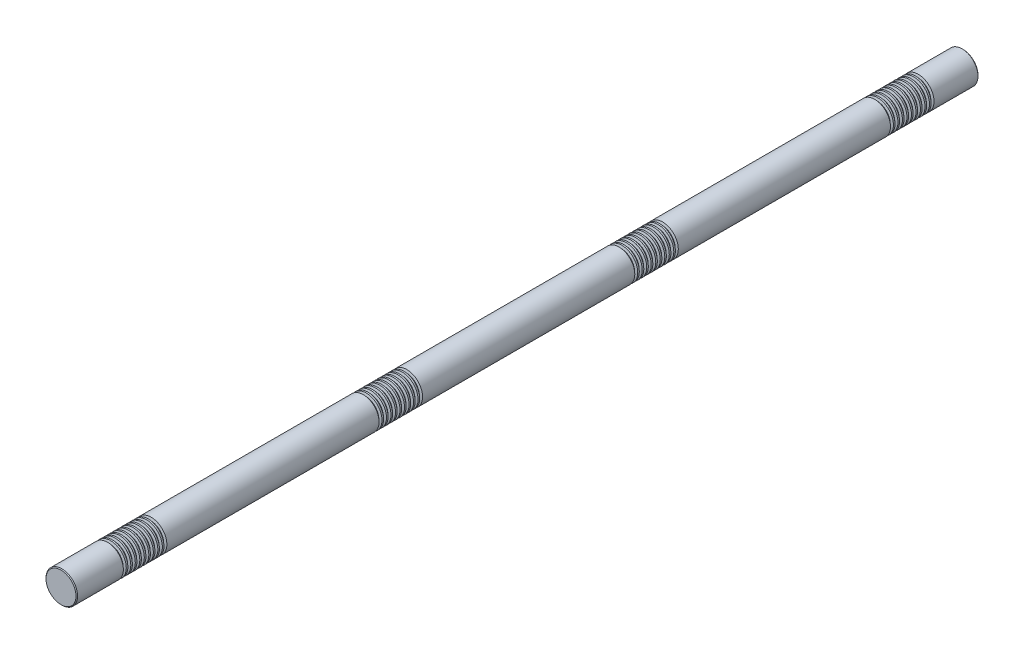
ISO-10303-21;
HEADER;
FILE_DESCRIPTION(('STEP AP214'),'2;1');
FILE_NAME('part.step','',(''),(''),'','','');
FILE_SCHEMA(('AUTOMOTIVE_DESIGN { 1 0 10303 214 1 1 1 1 }'));
ENDSEC;
DATA;
#1=APPLICATION_CONTEXT('core data for automotive mechanical design processes');
#2=APPLICATION_PROTOCOL_DEFINITION('international standard','automotive_design',2000,#1);
#3=PRODUCT_CONTEXT('',#1,'mechanical');
#4=PRODUCT('Part','Part','',(#3));
#5=PRODUCT_RELATED_PRODUCT_CATEGORY('part','',(#4));
#6=PRODUCT_DEFINITION_FORMATION('','',#4);
#7=PRODUCT_DEFINITION_CONTEXT('part definition',#1,'design');
#8=PRODUCT_DEFINITION('design','',#6,#7);
#9=PRODUCT_DEFINITION_SHAPE('','',#8);
#10=(LENGTH_UNIT() NAMED_UNIT(*) SI_UNIT(.MILLI.,.METRE.));
#11=(NAMED_UNIT(*) PLANE_ANGLE_UNIT() SI_UNIT($,.RADIAN.));
#12=(NAMED_UNIT(*) SI_UNIT($,.STERADIAN.) SOLID_ANGLE_UNIT());
#13=UNCERTAINTY_MEASURE_WITH_UNIT(LENGTH_MEASURE(1.E-05),#10,'distance_accuracy_value','');
#14=(GEOMETRIC_REPRESENTATION_CONTEXT(3) GLOBAL_UNCERTAINTY_ASSIGNED_CONTEXT((#13)) GLOBAL_UNIT_ASSIGNED_CONTEXT((#10,
#11,#12)) REPRESENTATION_CONTEXT('',''));
#15=CARTESIAN_POINT('',(0.,0.,0.));
#16=DIRECTION('',(0.,0.,1.));
#17=DIRECTION('',(1.,0.,0.));
#18=AXIS2_PLACEMENT_3D('',#15,#16,#17);
#19=CARTESIAN_POINT('',(0.,0.,1000.));
#20=DIRECTION('',(0.,0.,-1.));
#21=DIRECTION('',(-1.,0.,0.));
#22=AXIS2_PLACEMENT_3D('',#19,#20,#21);
#23=CYLINDRICAL_SURFACE('',#22,35.);
#24=CARTESIAN_POINT('',(0.,0.,886.736860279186));
#25=DIRECTION('',(0.,0.,1.));
#26=DIRECTION('',(1.,0.,0.));
#27=AXIS2_PLACEMENT_3D('',#24,#25,#26);
#28=CIRCLE('',#27,35.);
#29=CARTESIAN_POINT('',(35.,0.,886.736860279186));
#30=VERTEX_POINT('',#29);
#31=EDGE_CURVE('E673',#30,#30,#28,.T.);
#32=ORIENTED_EDGE('',*,*,#31,.T.);
#33=EDGE_LOOP('',(#32));
#34=FACE_BOUND('',#33,.T.);
#35=CARTESIAN_POINT('',(0.,0.,890.263139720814));
#36=DIRECTION('',(0.,0.,1.));
#37=DIRECTION('',(1.,0.,0.));
#38=AXIS2_PLACEMENT_3D('',#35,#36,#37);
#39=CIRCLE('',#38,35.);
#40=CARTESIAN_POINT('',(35.,0.,890.263139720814));
#41=VERTEX_POINT('',#40);
#42=EDGE_CURVE('E685',#41,#41,#39,.T.);
#43=ORIENTED_EDGE('',*,*,#42,.F.);
#44=EDGE_LOOP('',(#43));
#45=FACE_BOUND('',#44,.T.);
#46=ADVANCED_FACE('F37',(#34,#45),#23,.T.);
#47=CARTESIAN_POINT('',(0.,0.,876.736860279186));
#48=DIRECTION('',(0.,0.,1.));
#49=DIRECTION('',(1.,0.,0.));
#50=AXIS2_PLACEMENT_3D('',#47,#48,#49);
#51=CIRCLE('',#50,35.);
#52=CARTESIAN_POINT('',(35.,0.,876.736860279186));
#53=VERTEX_POINT('',#52);
#54=EDGE_CURVE('E658',#53,#53,#51,.T.);
#55=ORIENTED_EDGE('',*,*,#54,.T.);
#56=EDGE_LOOP('',(#55));
#57=FACE_BOUND('',#56,.T.);
#58=CARTESIAN_POINT('',(0.,0.,880.263139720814));
#59=DIRECTION('',(0.,0.,1.));
#60=DIRECTION('',(1.,0.,0.));
#61=AXIS2_PLACEMENT_3D('',#58,#59,#60);
#62=CIRCLE('',#61,35.);
#63=CARTESIAN_POINT('',(35.,0.,880.263139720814));
#64=VERTEX_POINT('',#63);
#65=EDGE_CURVE('E669',#64,#64,#62,.T.);
#66=ORIENTED_EDGE('',*,*,#65,.F.);
#67=EDGE_LOOP('',(#66));
#68=FACE_BOUND('',#67,.T.);
#69=ADVANCED_FACE('F721',(#57,#68),#23,.T.);
#70=CARTESIAN_POINT('',(0.,0.,866.736860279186));
#71=DIRECTION('',(0.,0.,1.));
#72=DIRECTION('',(1.,0.,0.));
#73=AXIS2_PLACEMENT_3D('',#70,#71,#72);
#74=CIRCLE('',#73,35.);
#75=CARTESIAN_POINT('',(35.,0.,866.736860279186));
#76=VERTEX_POINT('',#75);
#77=EDGE_CURVE('E642',#76,#76,#74,.T.);
#78=ORIENTED_EDGE('',*,*,#77,.T.);
#79=EDGE_LOOP('',(#78));
#80=FACE_BOUND('',#79,.T.);
#81=CARTESIAN_POINT('',(0.,0.,870.263139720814));
#82=DIRECTION('',(0.,0.,1.));
#83=DIRECTION('',(1.,0.,0.));
#84=AXIS2_PLACEMENT_3D('',#81,#82,#83);
#85=CIRCLE('',#84,35.);
#86=CARTESIAN_POINT('',(35.,0.,870.263139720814));
#87=VERTEX_POINT('',#86);
#88=EDGE_CURVE('E654',#87,#87,#85,.T.);
#89=ORIENTED_EDGE('',*,*,#88,.F.);
#90=EDGE_LOOP('',(#89));
#91=FACE_BOUND('',#90,.T.);
#92=ADVANCED_FACE('F729',(#80,#91),#23,.T.);
#93=CARTESIAN_POINT('',(0.,0.,856.736860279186));
#94=DIRECTION('',(0.,0.,1.));
#95=DIRECTION('',(1.,0.,0.));
#96=AXIS2_PLACEMENT_3D('',#93,#94,#95);
#97=CIRCLE('',#96,35.);
#98=CARTESIAN_POINT('',(35.,0.,856.736860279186));
#99=VERTEX_POINT('',#98);
#100=EDGE_CURVE('E626',#99,#99,#97,.T.);
#101=ORIENTED_EDGE('',*,*,#100,.T.);
#102=EDGE_LOOP('',(#101));
#103=FACE_BOUND('',#102,.T.);
#104=CARTESIAN_POINT('',(0.,0.,860.263139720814));
#105=DIRECTION('',(0.,0.,1.));
#106=DIRECTION('',(1.,0.,0.));
#107=AXIS2_PLACEMENT_3D('',#104,#105,#106);
#108=CIRCLE('',#107,35.);
#109=CARTESIAN_POINT('',(35.,0.,860.263139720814));
#110=VERTEX_POINT('',#109);
#111=EDGE_CURVE('E638',#110,#110,#108,.T.);
#112=ORIENTED_EDGE('',*,*,#111,.F.);
#113=EDGE_LOOP('',(#112));
#114=FACE_BOUND('',#113,.T.);
#115=ADVANCED_FACE('F1554',(#103,#114),#23,.T.);
#116=CARTESIAN_POINT('',(0.,0.,846.736860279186));
#117=DIRECTION('',(0.,0.,1.));
#118=DIRECTION('',(1.,0.,0.));
#119=AXIS2_PLACEMENT_3D('',#116,#117,#118);
#120=CIRCLE('',#119,35.);
#121=CARTESIAN_POINT('',(35.,0.,846.736860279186));
#122=VERTEX_POINT('',#121);
#123=EDGE_CURVE('E610',#122,#122,#120,.T.);
#124=ORIENTED_EDGE('',*,*,#123,.T.);
#125=EDGE_LOOP('',(#124));
#126=FACE_BOUND('',#125,.T.);
#127=CARTESIAN_POINT('',(0.,0.,850.263139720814));
#128=DIRECTION('',(0.,0.,1.));
#129=DIRECTION('',(1.,0.,0.));
#130=AXIS2_PLACEMENT_3D('',#127,#128,#129);
#131=CIRCLE('',#130,35.);
#132=CARTESIAN_POINT('',(35.,0.,850.263139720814));
#133=VERTEX_POINT('',#132);
#134=EDGE_CURVE('E622',#133,#133,#131,.T.);
#135=ORIENTED_EDGE('',*,*,#134,.F.);
#136=EDGE_LOOP('',(#135));
#137=FACE_BOUND('',#136,.T.);
#138=ADVANCED_FACE('F1531',(#126,#137),#23,.T.);
#139=CARTESIAN_POINT('',(0.,0.,836.736860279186));
#140=DIRECTION('',(0.,0.,1.));
#141=DIRECTION('',(1.,0.,0.));
#142=AXIS2_PLACEMENT_3D('',#139,#140,#141);
#143=CIRCLE('',#142,35.);
#144=CARTESIAN_POINT('',(35.,0.,836.736860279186));
#145=VERTEX_POINT('',#144);
#146=EDGE_CURVE('E594',#145,#145,#143,.T.);
#147=ORIENTED_EDGE('',*,*,#146,.T.);
#148=EDGE_LOOP('',(#147));
#149=FACE_BOUND('',#148,.T.);
#150=CARTESIAN_POINT('',(0.,0.,840.263139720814));
#151=DIRECTION('',(0.,0.,1.));
#152=DIRECTION('',(1.,0.,0.));
#153=AXIS2_PLACEMENT_3D('',#150,#151,#152);
#154=CIRCLE('',#153,35.);
#155=CARTESIAN_POINT('',(35.,0.,840.263139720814));
#156=VERTEX_POINT('',#155);
#157=EDGE_CURVE('E606',#156,#156,#154,.T.);
#158=ORIENTED_EDGE('',*,*,#157,.F.);
#159=EDGE_LOOP('',(#158));
#160=FACE_BOUND('',#159,.T.);
#161=ADVANCED_FACE('F1508',(#149,#160),#23,.T.);
#162=CARTESIAN_POINT('',(0.,0.,826.736860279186));
#163=DIRECTION('',(0.,0.,1.));
#164=DIRECTION('',(1.,0.,0.));
#165=AXIS2_PLACEMENT_3D('',#162,#163,#164);
#166=CIRCLE('',#165,35.);
#167=CARTESIAN_POINT('',(35.,0.,826.736860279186));
#168=VERTEX_POINT('',#167);
#169=EDGE_CURVE('E578',#168,#168,#166,.T.);
#170=ORIENTED_EDGE('',*,*,#169,.T.);
#171=EDGE_LOOP('',(#170));
#172=FACE_BOUND('',#171,.T.);
#173=CARTESIAN_POINT('',(0.,0.,830.263139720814));
#174=DIRECTION('',(0.,0.,1.));
#175=DIRECTION('',(1.,0.,0.));
#176=AXIS2_PLACEMENT_3D('',#173,#174,#175);
#177=CIRCLE('',#176,35.);
#178=CARTESIAN_POINT('',(35.,0.,830.263139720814));
#179=VERTEX_POINT('',#178);
#180=EDGE_CURVE('E590',#179,#179,#177,.T.);
#181=ORIENTED_EDGE('',*,*,#180,.F.);
#182=EDGE_LOOP('',(#181));
#183=FACE_BOUND('',#182,.T.);
#184=ADVANCED_FACE('F1485',(#172,#183),#23,.T.);
#185=CARTESIAN_POINT('',(0.,0.,816.736860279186));
#186=DIRECTION('',(0.,0.,1.));
#187=DIRECTION('',(1.,0.,0.));
#188=AXIS2_PLACEMENT_3D('',#185,#186,#187);
#189=CIRCLE('',#188,35.);
#190=CARTESIAN_POINT('',(35.,0.,816.736860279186));
#191=VERTEX_POINT('',#190);
#192=EDGE_CURVE('E562',#191,#191,#189,.T.);
#193=ORIENTED_EDGE('',*,*,#192,.T.);
#194=EDGE_LOOP('',(#193));
#195=FACE_BOUND('',#194,.T.);
#196=CARTESIAN_POINT('',(0.,0.,820.263139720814));
#197=DIRECTION('',(0.,0.,1.));
#198=DIRECTION('',(1.,0.,0.));
#199=AXIS2_PLACEMENT_3D('',#196,#197,#198);
#200=CIRCLE('',#199,35.);
#201=CARTESIAN_POINT('',(35.,0.,820.263139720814));
#202=VERTEX_POINT('',#201);
#203=EDGE_CURVE('E574',#202,#202,#200,.T.);
#204=ORIENTED_EDGE('',*,*,#203,.F.);
#205=EDGE_LOOP('',(#204));
#206=FACE_BOUND('',#205,.T.);
#207=ADVANCED_FACE('F1466',(#195,#206),#23,.T.);
#208=CARTESIAN_POINT('',(0.,0.,806.736860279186));
#209=DIRECTION('',(0.,0.,1.));
#210=DIRECTION('',(1.,0.,0.));
#211=AXIS2_PLACEMENT_3D('',#208,#209,#210);
#212=CIRCLE('',#211,35.);
#213=CARTESIAN_POINT('',(35.,0.,806.736860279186));
#214=VERTEX_POINT('',#213);
#215=EDGE_CURVE('E259',#214,#214,#212,.T.);
#216=ORIENTED_EDGE('',*,*,#215,.T.);
#217=EDGE_LOOP('',(#216));
#218=FACE_BOUND('',#217,.T.);
#219=CARTESIAN_POINT('',(0.,0.,810.263139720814));
#220=DIRECTION('',(0.,0.,1.));
#221=DIRECTION('',(1.,0.,0.));
#222=AXIS2_PLACEMENT_3D('',#219,#220,#221);
#223=CIRCLE('',#222,35.);
#224=CARTESIAN_POINT('',(35.,0.,810.263139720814));
#225=VERTEX_POINT('',#224);
#226=EDGE_CURVE('E558',#225,#225,#223,.T.);
#227=ORIENTED_EDGE('',*,*,#226,.F.);
#228=EDGE_LOOP('',(#227));
#229=FACE_BOUND('',#228,.T.);
#230=ADVANCED_FACE('F1415',(#218,#229),#23,.T.);
#231=CARTESIAN_POINT('',(0.,0.,319.736860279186));
#232=DIRECTION('',(0.,0.,1.));
#233=DIRECTION('',(1.,0.,0.));
#234=AXIS2_PLACEMENT_3D('',#231,#232,#233);
#235=CIRCLE('',#234,35.);
#236=CARTESIAN_POINT('',(35.,0.,319.736860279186));
#237=VERTEX_POINT('',#236);
#238=EDGE_CURVE('E530',#237,#237,#235,.T.);
#239=ORIENTED_EDGE('',*,*,#238,.T.);
#240=EDGE_LOOP('',(#239));
#241=FACE_BOUND('',#240,.T.);
#242=CARTESIAN_POINT('',(0.,0.,323.263139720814));
#243=DIRECTION('',(0.,0.,1.));
#244=DIRECTION('',(1.,0.,0.));
#245=AXIS2_PLACEMENT_3D('',#242,#243,#244);
#246=CIRCLE('',#245,35.);
#247=CARTESIAN_POINT('',(35.,0.,323.263139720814));
#248=VERTEX_POINT('',#247);
#249=EDGE_CURVE('E542',#248,#248,#246,.T.);
#250=ORIENTED_EDGE('',*,*,#249,.F.);
#251=EDGE_LOOP('',(#250));
#252=FACE_BOUND('',#251,.T.);
#253=ADVANCED_FACE('F1391',(#241,#252),#23,.T.);
#254=CARTESIAN_POINT('',(0.,0.,309.736860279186));
#255=DIRECTION('',(0.,0.,1.));
#256=DIRECTION('',(1.,0.,0.));
#257=AXIS2_PLACEMENT_3D('',#254,#255,#256);
#258=CIRCLE('',#257,35.);
#259=CARTESIAN_POINT('',(35.,0.,309.736860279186));
#260=VERTEX_POINT('',#259);
#261=EDGE_CURVE('E514',#260,#260,#258,.T.);
#262=ORIENTED_EDGE('',*,*,#261,.T.);
#263=EDGE_LOOP('',(#262));
#264=FACE_BOUND('',#263,.T.);
#265=CARTESIAN_POINT('',(0.,0.,313.263139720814));
#266=DIRECTION('',(0.,0.,1.));
#267=DIRECTION('',(1.,0.,0.));
#268=AXIS2_PLACEMENT_3D('',#265,#266,#267);
#269=CIRCLE('',#268,35.);
#270=CARTESIAN_POINT('',(35.,0.,313.263139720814));
#271=VERTEX_POINT('',#270);
#272=EDGE_CURVE('E526',#271,#271,#269,.T.);
#273=ORIENTED_EDGE('',*,*,#272,.F.);
#274=EDGE_LOOP('',(#273));
#275=FACE_BOUND('',#274,.T.);
#276=ADVANCED_FACE('F1368',(#264,#275),#23,.T.);
#277=CARTESIAN_POINT('',(0.,0.,299.736860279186));
#278=DIRECTION('',(0.,0.,1.));
#279=DIRECTION('',(1.,0.,0.));
#280=AXIS2_PLACEMENT_3D('',#277,#278,#279);
#281=CIRCLE('',#280,35.);
#282=CARTESIAN_POINT('',(35.,0.,299.736860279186));
#283=VERTEX_POINT('',#282);
#284=EDGE_CURVE('E499',#283,#283,#281,.T.);
#285=ORIENTED_EDGE('',*,*,#284,.T.);
#286=EDGE_LOOP('',(#285));
#287=FACE_BOUND('',#286,.T.);
#288=CARTESIAN_POINT('',(0.,0.,303.263139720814));
#289=DIRECTION('',(0.,0.,1.));
#290=DIRECTION('',(1.,0.,0.));
#291=AXIS2_PLACEMENT_3D('',#288,#289,#290);
#292=CIRCLE('',#291,35.);
#293=CARTESIAN_POINT('',(35.,0.,303.263139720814));
#294=VERTEX_POINT('',#293);
#295=EDGE_CURVE('E510',#294,#294,#292,.T.);
#296=ORIENTED_EDGE('',*,*,#295,.F.);
#297=EDGE_LOOP('',(#296));
#298=FACE_BOUND('',#297,.T.);
#299=ADVANCED_FACE('F1345',(#287,#298),#23,.T.);
#300=CARTESIAN_POINT('',(0.,0.,289.736860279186));
#301=DIRECTION('',(0.,0.,1.));
#302=DIRECTION('',(1.,0.,0.));
#303=AXIS2_PLACEMENT_3D('',#300,#301,#302);
#304=CIRCLE('',#303,35.);
#305=CARTESIAN_POINT('',(35.,0.,289.736860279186));
#306=VERTEX_POINT('',#305);
#307=EDGE_CURVE('E483',#306,#306,#304,.T.);
#308=ORIENTED_EDGE('',*,*,#307,.T.);
#309=EDGE_LOOP('',(#308));
#310=FACE_BOUND('',#309,.T.);
#311=CARTESIAN_POINT('',(0.,0.,293.263139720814));
#312=DIRECTION('',(0.,0.,1.));
#313=DIRECTION('',(1.,0.,0.));
#314=AXIS2_PLACEMENT_3D('',#311,#312,#313);
#315=CIRCLE('',#314,35.);
#316=CARTESIAN_POINT('',(35.,0.,293.263139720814));
#317=VERTEX_POINT('',#316);
#318=EDGE_CURVE('E495',#317,#317,#315,.T.);
#319=ORIENTED_EDGE('',*,*,#318,.F.);
#320=EDGE_LOOP('',(#319));
#321=FACE_BOUND('',#320,.T.);
#322=ADVANCED_FACE('F1322',(#310,#321),#23,.T.);
#323=CARTESIAN_POINT('',(0.,0.,279.736860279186));
#324=DIRECTION('',(0.,0.,1.));
#325=DIRECTION('',(1.,0.,0.));
#326=AXIS2_PLACEMENT_3D('',#323,#324,#325);
#327=CIRCLE('',#326,35.);
#328=CARTESIAN_POINT('',(35.,0.,279.736860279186));
#329=VERTEX_POINT('',#328);
#330=EDGE_CURVE('E467',#329,#329,#327,.T.);
#331=ORIENTED_EDGE('',*,*,#330,.T.);
#332=EDGE_LOOP('',(#331));
#333=FACE_BOUND('',#332,.T.);
#334=CARTESIAN_POINT('',(0.,0.,283.263139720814));
#335=DIRECTION('',(0.,0.,1.));
#336=DIRECTION('',(1.,0.,0.));
#337=AXIS2_PLACEMENT_3D('',#334,#335,#336);
#338=CIRCLE('',#337,35.);
#339=CARTESIAN_POINT('',(35.,0.,283.263139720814));
#340=VERTEX_POINT('',#339);
#341=EDGE_CURVE('E479',#340,#340,#338,.T.);
#342=ORIENTED_EDGE('',*,*,#341,.F.);
#343=EDGE_LOOP('',(#342));
#344=FACE_BOUND('',#343,.T.);
#345=ADVANCED_FACE('F1299',(#333,#344),#23,.T.);
#346=CARTESIAN_POINT('',(0.,0.,269.736860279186));
#347=DIRECTION('',(0.,0.,1.));
#348=DIRECTION('',(1.,0.,0.));
#349=AXIS2_PLACEMENT_3D('',#346,#347,#348);
#350=CIRCLE('',#349,35.);
#351=CARTESIAN_POINT('',(35.,0.,269.736860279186));
#352=VERTEX_POINT('',#351);
#353=EDGE_CURVE('E451',#352,#352,#350,.T.);
#354=ORIENTED_EDGE('',*,*,#353,.T.);
#355=EDGE_LOOP('',(#354));
#356=FACE_BOUND('',#355,.T.);
#357=CARTESIAN_POINT('',(0.,0.,273.263139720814));
#358=DIRECTION('',(0.,0.,1.));
#359=DIRECTION('',(1.,0.,0.));
#360=AXIS2_PLACEMENT_3D('',#357,#358,#359);
#361=CIRCLE('',#360,35.);
#362=CARTESIAN_POINT('',(35.,0.,273.263139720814));
#363=VERTEX_POINT('',#362);
#364=EDGE_CURVE('E463',#363,#363,#361,.T.);
#365=ORIENTED_EDGE('',*,*,#364,.F.);
#366=EDGE_LOOP('',(#365));
#367=FACE_BOUND('',#366,.T.);
#368=ADVANCED_FACE('F1276',(#356,#367),#23,.T.);
#369=CARTESIAN_POINT('',(0.,0.,259.736860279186));
#370=DIRECTION('',(0.,0.,1.));
#371=DIRECTION('',(1.,0.,0.));
#372=AXIS2_PLACEMENT_3D('',#369,#370,#371);
#373=CIRCLE('',#372,35.);
#374=CARTESIAN_POINT('',(35.,0.,259.736860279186));
#375=VERTEX_POINT('',#374);
#376=EDGE_CURVE('E435',#375,#375,#373,.T.);
#377=ORIENTED_EDGE('',*,*,#376,.T.);
#378=EDGE_LOOP('',(#377));
#379=FACE_BOUND('',#378,.T.);
#380=CARTESIAN_POINT('',(0.,0.,263.263139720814));
#381=DIRECTION('',(0.,0.,1.));
#382=DIRECTION('',(1.,0.,0.));
#383=AXIS2_PLACEMENT_3D('',#380,#381,#382);
#384=CIRCLE('',#383,35.);
#385=CARTESIAN_POINT('',(35.,0.,263.263139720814));
#386=VERTEX_POINT('',#385);
#387=EDGE_CURVE('E447',#386,#386,#384,.T.);
#388=ORIENTED_EDGE('',*,*,#387,.F.);
#389=EDGE_LOOP('',(#388));
#390=FACE_BOUND('',#389,.T.);
#391=ADVANCED_FACE('F1253',(#379,#390),#23,.T.);
#392=CARTESIAN_POINT('',(0.,0.,249.736860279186));
#393=DIRECTION('',(0.,0.,1.));
#394=DIRECTION('',(1.,0.,0.));
#395=AXIS2_PLACEMENT_3D('',#392,#393,#394);
#396=CIRCLE('',#395,35.);
#397=CARTESIAN_POINT('',(35.,0.,249.736860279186));
#398=VERTEX_POINT('',#397);
#399=EDGE_CURVE('E419',#398,#398,#396,.T.);
#400=ORIENTED_EDGE('',*,*,#399,.T.);
#401=EDGE_LOOP('',(#400));
#402=FACE_BOUND('',#401,.T.);
#403=CARTESIAN_POINT('',(0.,0.,253.263139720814));
#404=DIRECTION('',(0.,0.,1.));
#405=DIRECTION('',(1.,0.,0.));
#406=AXIS2_PLACEMENT_3D('',#403,#404,#405);
#407=CIRCLE('',#406,35.);
#408=CARTESIAN_POINT('',(35.,0.,253.263139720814));
#409=VERTEX_POINT('',#408);
#410=EDGE_CURVE('E431',#409,#409,#407,.T.);
#411=ORIENTED_EDGE('',*,*,#410,.F.);
#412=EDGE_LOOP('',(#411));
#413=FACE_BOUND('',#412,.T.);
#414=ADVANCED_FACE('F1234',(#402,#413),#23,.T.);
#415=CARTESIAN_POINT('',(0.,0.,239.736860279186));
#416=DIRECTION('',(0.,0.,1.));
#417=DIRECTION('',(1.,0.,0.));
#418=AXIS2_PLACEMENT_3D('',#415,#416,#417);
#419=CIRCLE('',#418,35.);
#420=CARTESIAN_POINT('',(35.,0.,239.736860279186));
#421=VERTEX_POINT('',#420);
#422=EDGE_CURVE('E243',#421,#421,#419,.T.);
#423=ORIENTED_EDGE('',*,*,#422,.T.);
#424=EDGE_LOOP('',(#423));
#425=FACE_BOUND('',#424,.T.);
#426=CARTESIAN_POINT('',(0.,0.,243.263139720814));
#427=DIRECTION('',(0.,0.,1.));
#428=DIRECTION('',(1.,0.,0.));
#429=AXIS2_PLACEMENT_3D('',#426,#427,#428);
#430=CIRCLE('',#429,35.);
#431=CARTESIAN_POINT('',(35.,0.,243.263139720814));
#432=VERTEX_POINT('',#431);
#433=EDGE_CURVE('E415',#432,#432,#430,.T.);
#434=ORIENTED_EDGE('',*,*,#433,.F.);
#435=EDGE_LOOP('',(#434));
#436=FACE_BOUND('',#435,.T.);
#437=ADVANCED_FACE('F1183',(#425,#436),#23,.T.);
#438=CARTESIAN_POINT('',(0.,0.,-247.263139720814));
#439=DIRECTION('',(0.,0.,1.));
#440=DIRECTION('',(1.,0.,0.));
#441=AXIS2_PLACEMENT_3D('',#438,#439,#440);
#442=CIRCLE('',#441,35.);
#443=CARTESIAN_POINT('',(35.,0.,-247.263139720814));
#444=VERTEX_POINT('',#443);
#445=EDGE_CURVE('E387',#444,#444,#442,.T.);
#446=ORIENTED_EDGE('',*,*,#445,.T.);
#447=EDGE_LOOP('',(#446));
#448=FACE_BOUND('',#447,.T.);
#449=CARTESIAN_POINT('',(0.,0.,-243.736860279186));
#450=DIRECTION('',(0.,0.,1.));
#451=DIRECTION('',(1.,0.,0.));
#452=AXIS2_PLACEMENT_3D('',#449,#450,#451);
#453=CIRCLE('',#452,35.);
#454=CARTESIAN_POINT('',(35.,0.,-243.736860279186));
#455=VERTEX_POINT('',#454);
#456=EDGE_CURVE('E399',#455,#455,#453,.T.);
#457=ORIENTED_EDGE('',*,*,#456,.F.);
#458=EDGE_LOOP('',(#457));
#459=FACE_BOUND('',#458,.T.);
#460=ADVANCED_FACE('F1159',(#448,#459),#23,.T.);
#461=CARTESIAN_POINT('',(0.,0.,-257.263139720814));
#462=DIRECTION('',(0.,0.,1.));
#463=DIRECTION('',(1.,0.,0.));
#464=AXIS2_PLACEMENT_3D('',#461,#462,#463);
#465=CIRCLE('',#464,35.);
#466=CARTESIAN_POINT('',(35.,0.,-257.263139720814));
#467=VERTEX_POINT('',#466);
#468=EDGE_CURVE('E371',#467,#467,#465,.T.);
#469=ORIENTED_EDGE('',*,*,#468,.T.);
#470=EDGE_LOOP('',(#469));
#471=FACE_BOUND('',#470,.T.);
#472=CARTESIAN_POINT('',(0.,0.,-253.736860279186));
#473=DIRECTION('',(0.,0.,1.));
#474=DIRECTION('',(1.,0.,0.));
#475=AXIS2_PLACEMENT_3D('',#472,#473,#474);
#476=CIRCLE('',#475,35.);
#477=CARTESIAN_POINT('',(35.,0.,-253.736860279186));
#478=VERTEX_POINT('',#477);
#479=EDGE_CURVE('E383',#478,#478,#476,.T.);
#480=ORIENTED_EDGE('',*,*,#479,.F.);
#481=EDGE_LOOP('',(#480));
#482=FACE_BOUND('',#481,.T.);
#483=ADVANCED_FACE('F1136',(#471,#482),#23,.T.);
#484=CARTESIAN_POINT('',(0.,0.,-267.263139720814));
#485=DIRECTION('',(0.,0.,1.));
#486=DIRECTION('',(1.,0.,0.));
#487=AXIS2_PLACEMENT_3D('',#484,#485,#486);
#488=CIRCLE('',#487,35.);
#489=CARTESIAN_POINT('',(35.,0.,-267.263139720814));
#490=VERTEX_POINT('',#489);
#491=EDGE_CURVE('E355',#490,#490,#488,.T.);
#492=ORIENTED_EDGE('',*,*,#491,.T.);
#493=EDGE_LOOP('',(#492));
#494=FACE_BOUND('',#493,.T.);
#495=CARTESIAN_POINT('',(0.,0.,-263.736860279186));
#496=DIRECTION('',(0.,0.,1.));
#497=DIRECTION('',(1.,0.,0.));
#498=AXIS2_PLACEMENT_3D('',#495,#496,#497);
#499=CIRCLE('',#498,35.);
#500=CARTESIAN_POINT('',(35.,0.,-263.736860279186));
#501=VERTEX_POINT('',#500);
#502=EDGE_CURVE('E367',#501,#501,#499,.T.);
#503=ORIENTED_EDGE('',*,*,#502,.F.);
#504=EDGE_LOOP('',(#503));
#505=FACE_BOUND('',#504,.T.);
#506=ADVANCED_FACE('F1113',(#494,#505),#23,.T.);
#507=CARTESIAN_POINT('',(0.,0.,-277.263139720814));
#508=DIRECTION('',(0.,0.,1.));
#509=DIRECTION('',(1.,0.,0.));
#510=AXIS2_PLACEMENT_3D('',#507,#508,#509);
#511=CIRCLE('',#510,35.);
#512=CARTESIAN_POINT('',(35.,0.,-277.263139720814));
#513=VERTEX_POINT('',#512);
#514=EDGE_CURVE('E339',#513,#513,#511,.T.);
#515=ORIENTED_EDGE('',*,*,#514,.T.);
#516=EDGE_LOOP('',(#515));
#517=FACE_BOUND('',#516,.T.);
#518=CARTESIAN_POINT('',(0.,0.,-273.736860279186));
#519=DIRECTION('',(0.,0.,1.));
#520=DIRECTION('',(1.,0.,0.));
#521=AXIS2_PLACEMENT_3D('',#518,#519,#520);
#522=CIRCLE('',#521,35.);
#523=CARTESIAN_POINT('',(35.,0.,-273.736860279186));
#524=VERTEX_POINT('',#523);
#525=EDGE_CURVE('E351',#524,#524,#522,.T.);
#526=ORIENTED_EDGE('',*,*,#525,.F.);
#527=EDGE_LOOP('',(#526));
#528=FACE_BOUND('',#527,.T.);
#529=ADVANCED_FACE('F1090',(#517,#528),#23,.T.);
#530=CARTESIAN_POINT('',(0.,0.,-287.263139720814));
#531=DIRECTION('',(0.,0.,1.));
#532=DIRECTION('',(1.,0.,0.));
#533=AXIS2_PLACEMENT_3D('',#530,#531,#532);
#534=CIRCLE('',#533,35.);
#535=CARTESIAN_POINT('',(35.,0.,-287.263139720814));
#536=VERTEX_POINT('',#535);
#537=EDGE_CURVE('E323',#536,#536,#534,.T.);
#538=ORIENTED_EDGE('',*,*,#537,.T.);
#539=EDGE_LOOP('',(#538));
#540=FACE_BOUND('',#539,.T.);
#541=CARTESIAN_POINT('',(0.,0.,-283.736860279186));
#542=DIRECTION('',(0.,0.,1.));
#543=DIRECTION('',(1.,0.,0.));
#544=AXIS2_PLACEMENT_3D('',#541,#542,#543);
#545=CIRCLE('',#544,35.);
#546=CARTESIAN_POINT('',(35.,0.,-283.736860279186));
#547=VERTEX_POINT('',#546);
#548=EDGE_CURVE('E335',#547,#547,#545,.T.);
#549=ORIENTED_EDGE('',*,*,#548,.F.);
#550=EDGE_LOOP('',(#549));
#551=FACE_BOUND('',#550,.T.);
#552=ADVANCED_FACE('F1067',(#540,#551),#23,.T.);
#553=CARTESIAN_POINT('',(0.,0.,-297.263139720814));
#554=DIRECTION('',(0.,0.,1.));
#555=DIRECTION('',(1.,0.,0.));
#556=AXIS2_PLACEMENT_3D('',#553,#554,#555);
#557=CIRCLE('',#556,35.);
#558=CARTESIAN_POINT('',(35.,0.,-297.263139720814));
#559=VERTEX_POINT('',#558);
#560=EDGE_CURVE('E307',#559,#559,#557,.T.);
#561=ORIENTED_EDGE('',*,*,#560,.T.);
#562=EDGE_LOOP('',(#561));
#563=FACE_BOUND('',#562,.T.);
#564=CARTESIAN_POINT('',(0.,0.,-293.736860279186));
#565=DIRECTION('',(0.,0.,1.));
#566=DIRECTION('',(1.,0.,0.));
#567=AXIS2_PLACEMENT_3D('',#564,#565,#566);
#568=CIRCLE('',#567,35.);
#569=CARTESIAN_POINT('',(35.,0.,-293.736860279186));
#570=VERTEX_POINT('',#569);
#571=EDGE_CURVE('E319',#570,#570,#568,.T.);
#572=ORIENTED_EDGE('',*,*,#571,.F.);
#573=EDGE_LOOP('',(#572));
#574=FACE_BOUND('',#573,.T.);
#575=ADVANCED_FACE('F1044',(#563,#574),#23,.T.);
#576=CARTESIAN_POINT('',(0.,0.,-307.263139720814));
#577=DIRECTION('',(0.,0.,1.));
#578=DIRECTION('',(1.,0.,0.));
#579=AXIS2_PLACEMENT_3D('',#576,#577,#578);
#580=CIRCLE('',#579,35.);
#581=CARTESIAN_POINT('',(35.,0.,-307.263139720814));
#582=VERTEX_POINT('',#581);
#583=EDGE_CURVE('E291',#582,#582,#580,.T.);
#584=ORIENTED_EDGE('',*,*,#583,.T.);
#585=EDGE_LOOP('',(#584));
#586=FACE_BOUND('',#585,.T.);
#587=CARTESIAN_POINT('',(0.,0.,-303.736860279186));
#588=DIRECTION('',(0.,0.,1.));
#589=DIRECTION('',(1.,0.,0.));
#590=AXIS2_PLACEMENT_3D('',#587,#588,#589);
#591=CIRCLE('',#590,35.);
#592=CARTESIAN_POINT('',(35.,0.,-303.736860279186));
#593=VERTEX_POINT('',#592);
#594=EDGE_CURVE('E303',#593,#593,#591,.T.);
#595=ORIENTED_EDGE('',*,*,#594,.F.);
#596=EDGE_LOOP('',(#595));
#597=FACE_BOUND('',#596,.T.);
#598=ADVANCED_FACE('F1021',(#586,#597),#23,.T.);
#599=CARTESIAN_POINT('',(0.,0.,-317.263139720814));
#600=DIRECTION('',(0.,0.,1.));
#601=DIRECTION('',(1.,0.,0.));
#602=AXIS2_PLACEMENT_3D('',#599,#600,#601);
#603=CIRCLE('',#602,35.);
#604=CARTESIAN_POINT('',(35.,0.,-317.263139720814));
#605=VERTEX_POINT('',#604);
#606=EDGE_CURVE('E275',#605,#605,#603,.T.);
#607=ORIENTED_EDGE('',*,*,#606,.T.);
#608=EDGE_LOOP('',(#607));
#609=FACE_BOUND('',#608,.T.);
#610=CARTESIAN_POINT('',(0.,0.,-313.736860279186));
#611=DIRECTION('',(0.,0.,1.));
#612=DIRECTION('',(1.,0.,0.));
#613=AXIS2_PLACEMENT_3D('',#610,#611,#612);
#614=CIRCLE('',#613,35.);
#615=CARTESIAN_POINT('',(35.,0.,-313.736860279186));
#616=VERTEX_POINT('',#615);
#617=EDGE_CURVE('E287',#616,#616,#614,.T.);
#618=ORIENTED_EDGE('',*,*,#617,.F.);
#619=EDGE_LOOP('',(#618));
#620=FACE_BOUND('',#619,.T.);
#621=ADVANCED_FACE('F998',(#609,#620),#23,.T.);
#622=CARTESIAN_POINT('',(0.,0.,-327.263139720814));
#623=DIRECTION('',(0.,0.,1.));
#624=DIRECTION('',(1.,0.,0.));
#625=AXIS2_PLACEMENT_3D('',#622,#623,#624);
#626=CIRCLE('',#625,35.);
#627=CARTESIAN_POINT('',(35.,0.,-327.263139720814));
#628=VERTEX_POINT('',#627);
#629=EDGE_CURVE('E227',#628,#628,#626,.T.);
#630=ORIENTED_EDGE('',*,*,#629,.T.);
#631=EDGE_LOOP('',(#630));
#632=FACE_BOUND('',#631,.T.);
#633=CARTESIAN_POINT('',(0.,0.,-323.736860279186));
#634=DIRECTION('',(0.,0.,1.));
#635=DIRECTION('',(1.,0.,0.));
#636=AXIS2_PLACEMENT_3D('',#633,#634,#635);
#637=CIRCLE('',#636,35.);
#638=CARTESIAN_POINT('',(35.,0.,-323.736860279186));
#639=VERTEX_POINT('',#638);
#640=EDGE_CURVE('E271',#639,#639,#637,.T.);
#641=ORIENTED_EDGE('',*,*,#640,.F.);
#642=EDGE_LOOP('',(#641));
#643=FACE_BOUND('',#642,.T.);
#644=ADVANCED_FACE('F975',(#632,#643),#23,.T.);
#645=CARTESIAN_POINT('',(0.,0.,-804.263139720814));
#646=DIRECTION('',(0.,0.,1.));
#647=DIRECTION('',(1.,0.,0.));
#648=AXIS2_PLACEMENT_3D('',#645,#646,#647);
#649=CIRCLE('',#648,35.);
#650=CARTESIAN_POINT('',(35.,0.,-804.263139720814));
#651=VERTEX_POINT('',#650);
#652=EDGE_CURVE('E212',#651,#651,#649,.T.);
#653=ORIENTED_EDGE('',*,*,#652,.T.);
#654=EDGE_LOOP('',(#653));
#655=FACE_BOUND('',#654,.T.);
#656=CARTESIAN_POINT('',(0.,0.,-333.736860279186));
#657=DIRECTION('',(0.,0.,1.));
#658=DIRECTION('',(1.,0.,0.));
#659=AXIS2_PLACEMENT_3D('',#656,#657,#658);
#660=CIRCLE('',#659,35.);
#661=CARTESIAN_POINT('',(35.,0.,-333.736860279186));
#662=VERTEX_POINT('',#661);
#663=EDGE_CURVE('E223',#662,#662,#660,.T.);
#664=ORIENTED_EDGE('',*,*,#663,.F.);
#665=EDGE_LOOP('',(#664));
#666=FACE_BOUND('',#665,.T.);
#667=ADVANCED_FACE('F952',(#655,#666),#23,.T.);
#668=CARTESIAN_POINT('',(0.,0.,-814.263139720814));
#669=DIRECTION('',(0.,0.,1.));
#670=DIRECTION('',(1.,0.,0.));
#671=AXIS2_PLACEMENT_3D('',#668,#669,#670);
#672=CIRCLE('',#671,35.);
#673=CARTESIAN_POINT('',(35.,0.,-814.263139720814));
#674=VERTEX_POINT('',#673);
#675=EDGE_CURVE('E196',#674,#674,#672,.T.);
#676=ORIENTED_EDGE('',*,*,#675,.T.);
#677=EDGE_LOOP('',(#676));
#678=FACE_BOUND('',#677,.T.);
#679=CARTESIAN_POINT('',(0.,0.,-810.736860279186));
#680=DIRECTION('',(0.,0.,1.));
#681=DIRECTION('',(1.,0.,0.));
#682=AXIS2_PLACEMENT_3D('',#679,#680,#681);
#683=CIRCLE('',#682,35.);
#684=CARTESIAN_POINT('',(35.,0.,-810.736860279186));
#685=VERTEX_POINT('',#684);
#686=EDGE_CURVE('E208',#685,#685,#683,.T.);
#687=ORIENTED_EDGE('',*,*,#686,.F.);
#688=EDGE_LOOP('',(#687));
#689=FACE_BOUND('',#688,.T.);
#690=ADVANCED_FACE('F929',(#678,#689),#23,.T.);
#691=CARTESIAN_POINT('',(0.,0.,-824.263139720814));
#692=DIRECTION('',(0.,0.,1.));
#693=DIRECTION('',(1.,0.,0.));
#694=AXIS2_PLACEMENT_3D('',#691,#692,#693);
#695=CIRCLE('',#694,35.);
#696=CARTESIAN_POINT('',(35.,0.,-824.263139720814));
#697=VERTEX_POINT('',#696);
#698=EDGE_CURVE('E181',#697,#697,#695,.T.);
#699=ORIENTED_EDGE('',*,*,#698,.T.);
#700=EDGE_LOOP('',(#699));
#701=FACE_BOUND('',#700,.T.);
#702=CARTESIAN_POINT('',(0.,0.,-820.736860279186));
#703=DIRECTION('',(0.,0.,1.));
#704=DIRECTION('',(1.,0.,0.));
#705=AXIS2_PLACEMENT_3D('',#702,#703,#704);
#706=CIRCLE('',#705,35.);
#707=CARTESIAN_POINT('',(35.,0.,-820.736860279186));
#708=VERTEX_POINT('',#707);
#709=EDGE_CURVE('E193',#708,#708,#706,.T.);
#710=ORIENTED_EDGE('',*,*,#709,.F.);
#711=EDGE_LOOP('',(#710));
#712=FACE_BOUND('',#711,.T.);
#713=ADVANCED_FACE('F906',(#701,#712),#23,.T.);
#714=CARTESIAN_POINT('',(0.,0.,-834.263139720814));
#715=DIRECTION('',(0.,0.,1.));
#716=DIRECTION('',(1.,0.,0.));
#717=AXIS2_PLACEMENT_3D('',#714,#715,#716);
#718=CIRCLE('',#717,35.);
#719=CARTESIAN_POINT('',(35.,0.,-834.263139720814));
#720=VERTEX_POINT('',#719);
#721=EDGE_CURVE('E165',#720,#720,#718,.T.);
#722=ORIENTED_EDGE('',*,*,#721,.T.);
#723=EDGE_LOOP('',(#722));
#724=FACE_BOUND('',#723,.T.);
#725=CARTESIAN_POINT('',(0.,0.,-830.736860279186));
#726=DIRECTION('',(0.,0.,1.));
#727=DIRECTION('',(1.,0.,0.));
#728=AXIS2_PLACEMENT_3D('',#725,#726,#727);
#729=CIRCLE('',#728,35.);
#730=CARTESIAN_POINT('',(35.,0.,-830.736860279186));
#731=VERTEX_POINT('',#730);
#732=EDGE_CURVE('E177',#731,#731,#729,.T.);
#733=ORIENTED_EDGE('',*,*,#732,.F.);
#734=EDGE_LOOP('',(#733));
#735=FACE_BOUND('',#734,.T.);
#736=ADVANCED_FACE('F883',(#724,#735),#23,.T.);
#737=CARTESIAN_POINT('',(0.,0.,-844.263139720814));
#738=DIRECTION('',(0.,0.,1.));
#739=DIRECTION('',(1.,0.,0.));
#740=AXIS2_PLACEMENT_3D('',#737,#738,#739);
#741=CIRCLE('',#740,35.);
#742=CARTESIAN_POINT('',(35.,0.,-844.263139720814));
#743=VERTEX_POINT('',#742);
#744=EDGE_CURVE('E149',#743,#743,#741,.T.);
#745=ORIENTED_EDGE('',*,*,#744,.T.);
#746=EDGE_LOOP('',(#745));
#747=FACE_BOUND('',#746,.T.);
#748=CARTESIAN_POINT('',(0.,0.,-840.736860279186));
#749=DIRECTION('',(0.,0.,1.));
#750=DIRECTION('',(1.,0.,0.));
#751=AXIS2_PLACEMENT_3D('',#748,#749,#750);
#752=CIRCLE('',#751,35.);
#753=CARTESIAN_POINT('',(35.,0.,-840.736860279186));
#754=VERTEX_POINT('',#753);
#755=EDGE_CURVE('E161',#754,#754,#752,.T.);
#756=ORIENTED_EDGE('',*,*,#755,.F.);
#757=EDGE_LOOP('',(#756));
#758=FACE_BOUND('',#757,.T.);
#759=ADVANCED_FACE('F860',(#747,#758),#23,.T.);
#760=CARTESIAN_POINT('',(0.,0.,-854.263139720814));
#761=DIRECTION('',(0.,0.,1.));
#762=DIRECTION('',(1.,0.,0.));
#763=AXIS2_PLACEMENT_3D('',#760,#761,#762);
#764=CIRCLE('',#763,35.);
#765=CARTESIAN_POINT('',(35.,0.,-854.263139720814));
#766=VERTEX_POINT('',#765);
#767=EDGE_CURVE('E133',#766,#766,#764,.T.);
#768=ORIENTED_EDGE('',*,*,#767,.T.);
#769=EDGE_LOOP('',(#768));
#770=FACE_BOUND('',#769,.T.);
#771=CARTESIAN_POINT('',(0.,0.,-850.736860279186));
#772=DIRECTION('',(0.,0.,1.));
#773=DIRECTION('',(1.,0.,0.));
#774=AXIS2_PLACEMENT_3D('',#771,#772,#773);
#775=CIRCLE('',#774,35.);
#776=CARTESIAN_POINT('',(35.,0.,-850.736860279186));
#777=VERTEX_POINT('',#776);
#778=EDGE_CURVE('E145',#777,#777,#775,.T.);
#779=ORIENTED_EDGE('',*,*,#778,.F.);
#780=EDGE_LOOP('',(#779));
#781=FACE_BOUND('',#780,.T.);
#782=ADVANCED_FACE('F837',(#770,#781),#23,.T.);
#783=CARTESIAN_POINT('',(0.,0.,-864.263139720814));
#784=DIRECTION('',(0.,0.,1.));
#785=DIRECTION('',(1.,0.,0.));
#786=AXIS2_PLACEMENT_3D('',#783,#784,#785);
#787=CIRCLE('',#786,35.);
#788=CARTESIAN_POINT('',(35.,0.,-864.263139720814));
#789=VERTEX_POINT('',#788);
#790=EDGE_CURVE('E117',#789,#789,#787,.T.);
#791=ORIENTED_EDGE('',*,*,#790,.T.);
#792=EDGE_LOOP('',(#791));
#793=FACE_BOUND('',#792,.T.);
#794=CARTESIAN_POINT('',(0.,0.,-860.736860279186));
#795=DIRECTION('',(0.,0.,1.));
#796=DIRECTION('',(1.,0.,0.));
#797=AXIS2_PLACEMENT_3D('',#794,#795,#796);
#798=CIRCLE('',#797,35.);
#799=CARTESIAN_POINT('',(35.,0.,-860.736860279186));
#800=VERTEX_POINT('',#799);
#801=EDGE_CURVE('E129',#800,#800,#798,.T.);
#802=ORIENTED_EDGE('',*,*,#801,.F.);
#803=EDGE_LOOP('',(#802));
#804=FACE_BOUND('',#803,.T.);
#805=ADVANCED_FACE('F814',(#793,#804),#23,.T.);
#806=CARTESIAN_POINT('',(0.,0.,-874.263139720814));
#807=DIRECTION('',(0.,0.,1.));
#808=DIRECTION('',(1.,0.,0.));
#809=AXIS2_PLACEMENT_3D('',#806,#807,#808);
#810=CIRCLE('',#809,35.);
#811=CARTESIAN_POINT('',(35.,0.,-874.263139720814));
#812=VERTEX_POINT('',#811);
#813=EDGE_CURVE('E101',#812,#812,#810,.T.);
#814=ORIENTED_EDGE('',*,*,#813,.T.);
#815=EDGE_LOOP('',(#814));
#816=FACE_BOUND('',#815,.T.);
#817=CARTESIAN_POINT('',(0.,0.,-870.736860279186));
#818=DIRECTION('',(0.,0.,1.));
#819=DIRECTION('',(1.,0.,0.));
#820=AXIS2_PLACEMENT_3D('',#817,#818,#819);
#821=CIRCLE('',#820,35.);
#822=CARTESIAN_POINT('',(35.,0.,-870.736860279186));
#823=VERTEX_POINT('',#822);
#824=EDGE_CURVE('E113',#823,#823,#821,.T.);
#825=ORIENTED_EDGE('',*,*,#824,.F.);
#826=EDGE_LOOP('',(#825));
#827=FACE_BOUND('',#826,.T.);
#828=ADVANCED_FACE('F791',(#816,#827),#23,.T.);
#829=CARTESIAN_POINT('',(0.,0.,-884.263139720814));
#830=DIRECTION('',(0.,0.,1.));
#831=DIRECTION('',(1.,0.,0.));
#832=AXIS2_PLACEMENT_3D('',#829,#830,#831);
#833=CIRCLE('',#832,35.);
#834=CARTESIAN_POINT('',(35.,0.,-884.263139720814));
#835=VERTEX_POINT('',#834);
#836=EDGE_CURVE('E85',#835,#835,#833,.T.);
#837=ORIENTED_EDGE('',*,*,#836,.T.);
#838=EDGE_LOOP('',(#837));
#839=FACE_BOUND('',#838,.T.);
#840=CARTESIAN_POINT('',(0.,0.,-880.736860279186));
#841=DIRECTION('',(0.,0.,1.));
#842=DIRECTION('',(1.,0.,0.));
#843=AXIS2_PLACEMENT_3D('',#840,#841,#842);
#844=CIRCLE('',#843,35.);
#845=CARTESIAN_POINT('',(35.,0.,-880.736860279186));
#846=VERTEX_POINT('',#845);
#847=EDGE_CURVE('E97',#846,#846,#844,.T.);
#848=ORIENTED_EDGE('',*,*,#847,.F.);
#849=EDGE_LOOP('',(#848));
#850=FACE_BOUND('',#849,.T.);
#851=ADVANCED_FACE('F744',(#839,#850),#23,.T.);
#852=CARTESIAN_POINT('',(0.,0.,-894.263139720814));
#853=DIRECTION('',(0.,0.,1.));
#854=DIRECTION('',(1.,0.,0.));
#855=AXIS2_PLACEMENT_3D('',#852,#853,#854);
#856=CIRCLE('',#855,35.);
#857=CARTESIAN_POINT('',(35.,0.,-894.263139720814));
#858=VERTEX_POINT('',#857);
#859=EDGE_CURVE('E69',#858,#858,#856,.T.);
#860=ORIENTED_EDGE('',*,*,#859,.T.);
#861=EDGE_LOOP('',(#860));
#862=FACE_BOUND('',#861,.T.);
#863=CARTESIAN_POINT('',(0.,0.,-890.736860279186));
#864=DIRECTION('',(0.,0.,1.));
#865=DIRECTION('',(1.,0.,0.));
#866=AXIS2_PLACEMENT_3D('',#863,#864,#865);
#867=CIRCLE('',#866,35.);
#868=CARTESIAN_POINT('',(35.,0.,-890.736860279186));
#869=VERTEX_POINT('',#868);
#870=EDGE_CURVE('E81',#869,#869,#867,.T.);
#871=ORIENTED_EDGE('',*,*,#870,.F.);
#872=EDGE_LOOP('',(#871));
#873=FACE_BOUND('',#872,.T.);
#874=ADVANCED_FACE('F737',(#862,#873),#23,.T.);
#875=CARTESIAN_POINT('',(0.,0.,-998.25));
#876=DIRECTION('',(0.,0.,1.));
#877=DIRECTION('',(1.,0.,0.));
#878=AXIS2_PLACEMENT_3D('',#875,#876,#877);
#879=CIRCLE('',#878,35.);
#880=CARTESIAN_POINT('',(35.,0.,-998.25));
#881=VERTEX_POINT('',#880);
#882=EDGE_CURVE('E52',#881,#881,#879,.T.);
#883=ORIENTED_EDGE('',*,*,#882,.T.);
#884=EDGE_LOOP('',(#883));
#885=FACE_BOUND('',#884,.T.);
#886=CARTESIAN_POINT('',(0.,0.,-900.736860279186));
#887=DIRECTION('',(0.,0.,1.));
#888=DIRECTION('',(1.,0.,0.));
#889=AXIS2_PLACEMENT_3D('',#886,#887,#888);
#890=CIRCLE('',#889,35.);
#891=CARTESIAN_POINT('',(35.,0.,-900.736860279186));
#892=VERTEX_POINT('',#891);
#893=EDGE_CURVE('E65',#892,#892,#890,.T.);
#894=ORIENTED_EDGE('',*,*,#893,.F.);
#895=EDGE_LOOP('',(#894));
#896=FACE_BOUND('',#895,.T.);
#897=ADVANCED_FACE('F725',(#885,#896),#23,.T.);
#898=CARTESIAN_POINT('',(0.,0.,-1000.));
#899=DIRECTION('',(0.,0.,1.));
#900=DIRECTION('',(1.,0.,0.));
#901=AXIS2_PLACEMENT_3D('',#898,#899,#900);
#902=PLANE('',#901);
#903=CARTESIAN_POINT('',(0.,0.,-1000.));
#904=DIRECTION('',(0.,0.,1.));
#905=DIRECTION('',(1.,0.,0.));
#906=AXIS2_PLACEMENT_3D('',#903,#904,#905);
#907=CIRCLE('',#906,33.2499999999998);
#908=CARTESIAN_POINT('',(33.2499999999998,0.,-1000.));
#909=VERTEX_POINT('',#908);
#910=EDGE_CURVE('E45',#909,#909,#907,.F.);
#911=ORIENTED_EDGE('',*,*,#910,.T.);
#912=EDGE_LOOP('',(#911));
#913=FACE_BOUND('',#912,.T.);
#914=ADVANCED_FACE('F736',(#913),#902,.F.);
#915=CARTESIAN_POINT('',(0.,0.,-998.25));
#916=DIRECTION('',(0.,0.,1.));
#917=DIRECTION('',(1.,0.,0.));
#918=AXIS2_PLACEMENT_3D('',#915,#916,#917);
#919=CONICAL_SURFACE('',#918,35.,0.785398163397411);
#920=ORIENTED_EDGE('',*,*,#910,.F.);
#921=EDGE_LOOP('',(#920));
#922=FACE_BOUND('',#921,.T.);
#923=ORIENTED_EDGE('',*,*,#882,.F.);
#924=EDGE_LOOP('',(#923));
#925=FACE_BOUND('',#924,.T.);
#926=ADVANCED_FACE('F743',(#922,#925),#919,.T.);
#927=CARTESIAN_POINT('',(0.,0.,-899.263139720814));
#928=DIRECTION('',(0.,0.,-1.));
#929=DIRECTION('',(-1.,0.,0.));
#930=AXIS2_PLACEMENT_3D('',#927,#928,#929);
#931=CONICAL_SURFACE('',#930,29.5,1.30899693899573);
#932=ORIENTED_EDGE('',*,*,#893,.T.);
#933=EDGE_LOOP('',(#932));
#934=FACE_BOUND('',#933,.T.);
#935=CARTESIAN_POINT('',(0.,0.,-899.263139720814));
#936=DIRECTION('',(0.,0.,1.));
#937=DIRECTION('',(1.,0.,0.));
#938=AXIS2_PLACEMENT_3D('',#935,#936,#937);
#939=CIRCLE('',#938,29.5);
#940=CARTESIAN_POINT('',(29.5,0.,-899.263139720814));
#941=VERTEX_POINT('',#940);
#942=EDGE_CURVE('E77',#941,#941,#939,.T.);
#943=ORIENTED_EDGE('',*,*,#942,.F.);
#944=EDGE_LOOP('',(#943));
#945=FACE_BOUND('',#944,.T.);
#946=ADVANCED_FACE('F750',(#934,#945),#931,.T.);
#947=CARTESIAN_POINT('',(0.,0.,-894.263139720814));
#948=DIRECTION('',(0.,0.,1.));
#949=DIRECTION('',(1.,0.,0.));
#950=AXIS2_PLACEMENT_3D('',#947,#948,#949);
#951=CONICAL_SURFACE('',#950,35.,1.30899693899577);
#952=CARTESIAN_POINT('',(0.,0.,-895.736860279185));
#953=DIRECTION('',(0.,0.,1.));
#954=DIRECTION('',(1.,0.,0.));
#955=AXIS2_PLACEMENT_3D('',#952,#953,#954);
#956=CIRCLE('',#955,29.5);
#957=CARTESIAN_POINT('',(29.5,0.,-895.736860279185));
#958=VERTEX_POINT('',#957);
#959=EDGE_CURVE('E73',#958,#958,#956,.T.);
#960=ORIENTED_EDGE('',*,*,#959,.T.);
#961=EDGE_LOOP('',(#960));
#962=FACE_BOUND('',#961,.T.);
#963=ORIENTED_EDGE('',*,*,#859,.F.);
#964=EDGE_LOOP('',(#963));
#965=FACE_BOUND('',#964,.T.);
#966=ADVANCED_FACE('F753',(#962,#965),#951,.T.);
#967=CARTESIAN_POINT('',(0.,0.,998.249999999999));
#968=DIRECTION('',(0.,0.,1.));
#969=DIRECTION('',(1.,0.,0.));
#970=AXIS2_PLACEMENT_3D('',#967,#968,#969);
#971=CYLINDRICAL_SURFACE('',#970,29.5);
#972=ORIENTED_EDGE('',*,*,#942,.T.);
#973=EDGE_LOOP('',(#972));
#974=FACE_BOUND('',#973,.T.);
#975=ORIENTED_EDGE('',*,*,#959,.F.);
#976=EDGE_LOOP('',(#975));
#977=FACE_BOUND('',#976,.T.);
#978=ADVANCED_FACE('F757',(#974,#977),#971,.T.);
#979=CARTESIAN_POINT('',(0.,0.,-889.263139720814));
#980=DIRECTION('',(0.,0.,-1.));
#981=DIRECTION('',(-1.,0.,0.));
#982=AXIS2_PLACEMENT_3D('',#979,#980,#981);
#983=CONICAL_SURFACE('',#982,29.5,1.30899693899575);
#984=ORIENTED_EDGE('',*,*,#870,.T.);
#985=EDGE_LOOP('',(#984));
#986=FACE_BOUND('',#985,.T.);
#987=CARTESIAN_POINT('',(0.,0.,-889.263139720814));
#988=DIRECTION('',(0.,0.,1.));
#989=DIRECTION('',(1.,0.,0.));
#990=AXIS2_PLACEMENT_3D('',#987,#988,#989);
#991=CIRCLE('',#990,29.5);
#992=CARTESIAN_POINT('',(29.5,0.,-889.263139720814));
#993=VERTEX_POINT('',#992);
#994=EDGE_CURVE('E93',#993,#993,#991,.T.);
#995=ORIENTED_EDGE('',*,*,#994,.F.);
#996=EDGE_LOOP('',(#995));
#997=FACE_BOUND('',#996,.T.);
#998=ADVANCED_FACE('F760',(#986,#997),#983,.T.);
#999=CARTESIAN_POINT('',(0.,0.,-884.263139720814));
#1000=DIRECTION('',(0.,0.,1.));
#1001=DIRECTION('',(1.,0.,0.));
#1002=AXIS2_PLACEMENT_3D('',#999,#1000,#1001);
#1003=CONICAL_SURFACE('',#1002,35.,1.30899693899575);
#1004=CARTESIAN_POINT('',(0.,0.,-885.736860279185));
#1005=DIRECTION('',(0.,0.,1.));
#1006=DIRECTION('',(1.,0.,0.));
#1007=AXIS2_PLACEMENT_3D('',#1004,#1005,#1006);
#1008=CIRCLE('',#1007,29.5);
#1009=CARTESIAN_POINT('',(29.5,0.,-885.736860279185));
#1010=VERTEX_POINT('',#1009);
#1011=EDGE_CURVE('E89',#1010,#1010,#1008,.T.);
#1012=ORIENTED_EDGE('',*,*,#1011,.T.);
#1013=EDGE_LOOP('',(#1012));
#1014=FACE_BOUND('',#1013,.T.);
#1015=ORIENTED_EDGE('',*,*,#836,.F.);
#1016=EDGE_LOOP('',(#1015));
#1017=FACE_BOUND('',#1016,.T.);
#1018=ADVANCED_FACE('F773',(#1014,#1017),#1003,.T.);
#1019=CARTESIAN_POINT('',(0.,0.,-890.736860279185));
#1020=DIRECTION('',(0.,0.,1.));
#1021=DIRECTION('',(1.,0.,0.));
#1022=AXIS2_PLACEMENT_3D('',#1019,#1020,#1021);
#1023=CYLINDRICAL_SURFACE('',#1022,29.5);
#1024=ORIENTED_EDGE('',*,*,#994,.T.);
#1025=EDGE_LOOP('',(#1024));
#1026=FACE_BOUND('',#1025,.T.);
#1027=ORIENTED_EDGE('',*,*,#1011,.F.);
#1028=EDGE_LOOP('',(#1027));
#1029=FACE_BOUND('',#1028,.T.);
#1030=ADVANCED_FACE('F777',(#1026,#1029),#1023,.T.);
#1031=CARTESIAN_POINT('',(0.,0.,-879.263139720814));
#1032=DIRECTION('',(0.,0.,-1.));
#1033=DIRECTION('',(-1.,0.,0.));
#1034=AXIS2_PLACEMENT_3D('',#1031,#1032,#1033);
#1035=CONICAL_SURFACE('',#1034,29.5,1.30899693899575);
#1036=ORIENTED_EDGE('',*,*,#847,.T.);
#1037=EDGE_LOOP('',(#1036));
#1038=FACE_BOUND('',#1037,.T.);
#1039=CARTESIAN_POINT('',(0.,0.,-879.263139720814));
#1040=DIRECTION('',(0.,0.,1.));
#1041=DIRECTION('',(1.,0.,0.));
#1042=AXIS2_PLACEMENT_3D('',#1039,#1040,#1041);
#1043=CIRCLE('',#1042,29.5);
#1044=CARTESIAN_POINT('',(29.5,0.,-879.263139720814));
#1045=VERTEX_POINT('',#1044);
#1046=EDGE_CURVE('E109',#1045,#1045,#1043,.T.);
#1047=ORIENTED_EDGE('',*,*,#1046,.F.);
#1048=EDGE_LOOP('',(#1047));
#1049=FACE_BOUND('',#1048,.T.);
#1050=ADVANCED_FACE('F780',(#1038,#1049),#1035,.T.);
#1051=CARTESIAN_POINT('',(0.,0.,-874.263139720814));
#1052=DIRECTION('',(0.,0.,1.));
#1053=DIRECTION('',(1.,0.,0.));
#1054=AXIS2_PLACEMENT_3D('',#1051,#1052,#1053);
#1055=CONICAL_SURFACE('',#1054,35.,1.30899693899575);
#1056=CARTESIAN_POINT('',(0.,0.,-875.736860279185));
#1057=DIRECTION('',(0.,0.,1.));
#1058=DIRECTION('',(1.,0.,0.));
#1059=AXIS2_PLACEMENT_3D('',#1056,#1057,#1058);
#1060=CIRCLE('',#1059,29.5);
#1061=CARTESIAN_POINT('',(29.5,0.,-875.736860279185));
#1062=VERTEX_POINT('',#1061);
#1063=EDGE_CURVE('E105',#1062,#1062,#1060,.T.);
#1064=ORIENTED_EDGE('',*,*,#1063,.T.);
#1065=EDGE_LOOP('',(#1064));
#1066=FACE_BOUND('',#1065,.T.);
#1067=ORIENTED_EDGE('',*,*,#813,.F.);
#1068=EDGE_LOOP('',(#1067));
#1069=FACE_BOUND('',#1068,.T.);
#1070=ADVANCED_FACE('F796',(#1066,#1069),#1055,.T.);
#1071=CARTESIAN_POINT('',(0.,0.,-880.736860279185));
#1072=DIRECTION('',(0.,0.,1.));
#1073=DIRECTION('',(1.,0.,0.));
#1074=AXIS2_PLACEMENT_3D('',#1071,#1072,#1073);
#1075=CYLINDRICAL_SURFACE('',#1074,29.5);
#1076=ORIENTED_EDGE('',*,*,#1046,.T.);
#1077=EDGE_LOOP('',(#1076));
#1078=FACE_BOUND('',#1077,.T.);
#1079=ORIENTED_EDGE('',*,*,#1063,.F.);
#1080=EDGE_LOOP('',(#1079));
#1081=FACE_BOUND('',#1080,.T.);
#1082=ADVANCED_FACE('F800',(#1078,#1081),#1075,.T.);
#1083=CARTESIAN_POINT('',(0.,0.,-869.263139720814));
#1084=DIRECTION('',(0.,0.,-1.));
#1085=DIRECTION('',(-1.,0.,0.));
#1086=AXIS2_PLACEMENT_3D('',#1083,#1084,#1085);
#1087=CONICAL_SURFACE('',#1086,29.5,1.30899693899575);
#1088=ORIENTED_EDGE('',*,*,#824,.T.);
#1089=EDGE_LOOP('',(#1088));
#1090=FACE_BOUND('',#1089,.T.);
#1091=CARTESIAN_POINT('',(0.,0.,-869.263139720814));
#1092=DIRECTION('',(0.,0.,1.));
#1093=DIRECTION('',(1.,0.,0.));
#1094=AXIS2_PLACEMENT_3D('',#1091,#1092,#1093);
#1095=CIRCLE('',#1094,29.5);
#1096=CARTESIAN_POINT('',(29.5,0.,-869.263139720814));
#1097=VERTEX_POINT('',#1096);
#1098=EDGE_CURVE('E125',#1097,#1097,#1095,.T.);
#1099=ORIENTED_EDGE('',*,*,#1098,.F.);
#1100=EDGE_LOOP('',(#1099));
#1101=FACE_BOUND('',#1100,.T.);
#1102=ADVANCED_FACE('F803',(#1090,#1101),#1087,.T.);
#1103=CARTESIAN_POINT('',(0.,0.,-864.263139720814));
#1104=DIRECTION('',(0.,0.,1.));
#1105=DIRECTION('',(1.,0.,0.));
#1106=AXIS2_PLACEMENT_3D('',#1103,#1104,#1105);
#1107=CONICAL_SURFACE('',#1106,35.,1.30899693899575);
#1108=CARTESIAN_POINT('',(0.,0.,-865.736860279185));
#1109=DIRECTION('',(0.,0.,1.));
#1110=DIRECTION('',(1.,0.,0.));
#1111=AXIS2_PLACEMENT_3D('',#1108,#1109,#1110);
#1112=CIRCLE('',#1111,29.5);
#1113=CARTESIAN_POINT('',(29.5,0.,-865.736860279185));
#1114=VERTEX_POINT('',#1113);
#1115=EDGE_CURVE('E121',#1114,#1114,#1112,.T.);
#1116=ORIENTED_EDGE('',*,*,#1115,.T.);
#1117=EDGE_LOOP('',(#1116));
#1118=FACE_BOUND('',#1117,.T.);
#1119=ORIENTED_EDGE('',*,*,#790,.F.);
#1120=EDGE_LOOP('',(#1119));
#1121=FACE_BOUND('',#1120,.T.);
#1122=ADVANCED_FACE('F819',(#1118,#1121),#1107,.T.);
#1123=CARTESIAN_POINT('',(0.,0.,-870.736860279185));
#1124=DIRECTION('',(0.,0.,1.));
#1125=DIRECTION('',(1.,0.,0.));
#1126=AXIS2_PLACEMENT_3D('',#1123,#1124,#1125);
#1127=CYLINDRICAL_SURFACE('',#1126,29.5);
#1128=ORIENTED_EDGE('',*,*,#1098,.T.);
#1129=EDGE_LOOP('',(#1128));
#1130=FACE_BOUND('',#1129,.T.);
#1131=ORIENTED_EDGE('',*,*,#1115,.F.);
#1132=EDGE_LOOP('',(#1131));
#1133=FACE_BOUND('',#1132,.T.);
#1134=ADVANCED_FACE('F823',(#1130,#1133),#1127,.T.);
#1135=CARTESIAN_POINT('',(0.,0.,-859.263139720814));
#1136=DIRECTION('',(0.,0.,-1.));
#1137=DIRECTION('',(-1.,0.,0.));
#1138=AXIS2_PLACEMENT_3D('',#1135,#1136,#1137);
#1139=CONICAL_SURFACE('',#1138,29.5,1.30899693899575);
#1140=ORIENTED_EDGE('',*,*,#801,.T.);
#1141=EDGE_LOOP('',(#1140));
#1142=FACE_BOUND('',#1141,.T.);
#1143=CARTESIAN_POINT('',(0.,0.,-859.263139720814));
#1144=DIRECTION('',(0.,0.,1.));
#1145=DIRECTION('',(1.,0.,0.));
#1146=AXIS2_PLACEMENT_3D('',#1143,#1144,#1145);
#1147=CIRCLE('',#1146,29.5);
#1148=CARTESIAN_POINT('',(29.5,0.,-859.263139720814));
#1149=VERTEX_POINT('',#1148);
#1150=EDGE_CURVE('E141',#1149,#1149,#1147,.T.);
#1151=ORIENTED_EDGE('',*,*,#1150,.F.);
#1152=EDGE_LOOP('',(#1151));
#1153=FACE_BOUND('',#1152,.T.);
#1154=ADVANCED_FACE('F826',(#1142,#1153),#1139,.T.);
#1155=CARTESIAN_POINT('',(0.,0.,-854.263139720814));
#1156=DIRECTION('',(0.,0.,1.));
#1157=DIRECTION('',(1.,0.,0.));
#1158=AXIS2_PLACEMENT_3D('',#1155,#1156,#1157);
#1159=CONICAL_SURFACE('',#1158,35.,1.30899693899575);
#1160=CARTESIAN_POINT('',(0.,0.,-855.736860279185));
#1161=DIRECTION('',(0.,0.,1.));
#1162=DIRECTION('',(1.,0.,0.));
#1163=AXIS2_PLACEMENT_3D('',#1160,#1161,#1162);
#1164=CIRCLE('',#1163,29.5);
#1165=CARTESIAN_POINT('',(29.5,0.,-855.736860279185));
#1166=VERTEX_POINT('',#1165);
#1167=EDGE_CURVE('E137',#1166,#1166,#1164,.T.);
#1168=ORIENTED_EDGE('',*,*,#1167,.T.);
#1169=EDGE_LOOP('',(#1168));
#1170=FACE_BOUND('',#1169,.T.);
#1171=ORIENTED_EDGE('',*,*,#767,.F.);
#1172=EDGE_LOOP('',(#1171));
#1173=FACE_BOUND('',#1172,.T.);
#1174=ADVANCED_FACE('F842',(#1170,#1173),#1159,.T.);
#1175=CARTESIAN_POINT('',(0.,0.,-860.736860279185));
#1176=DIRECTION('',(0.,0.,1.));
#1177=DIRECTION('',(1.,0.,0.));
#1178=AXIS2_PLACEMENT_3D('',#1175,#1176,#1177);
#1179=CYLINDRICAL_SURFACE('',#1178,29.5);
#1180=ORIENTED_EDGE('',*,*,#1150,.T.);
#1181=EDGE_LOOP('',(#1180));
#1182=FACE_BOUND('',#1181,.T.);
#1183=ORIENTED_EDGE('',*,*,#1167,.F.);
#1184=EDGE_LOOP('',(#1183));
#1185=FACE_BOUND('',#1184,.T.);
#1186=ADVANCED_FACE('F846',(#1182,#1185),#1179,.T.);
#1187=CARTESIAN_POINT('',(0.,0.,-849.263139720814));
#1188=DIRECTION('',(0.,0.,-1.));
#1189=DIRECTION('',(-1.,0.,0.));
#1190=AXIS2_PLACEMENT_3D('',#1187,#1188,#1189);
#1191=CONICAL_SURFACE('',#1190,29.5,1.30899693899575);
#1192=ORIENTED_EDGE('',*,*,#778,.T.);
#1193=EDGE_LOOP('',(#1192));
#1194=FACE_BOUND('',#1193,.T.);
#1195=CARTESIAN_POINT('',(0.,0.,-849.263139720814));
#1196=DIRECTION('',(0.,0.,1.));
#1197=DIRECTION('',(1.,0.,0.));
#1198=AXIS2_PLACEMENT_3D('',#1195,#1196,#1197);
#1199=CIRCLE('',#1198,29.5);
#1200=CARTESIAN_POINT('',(29.5,0.,-849.263139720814));
#1201=VERTEX_POINT('',#1200);
#1202=EDGE_CURVE('E157',#1201,#1201,#1199,.T.);
#1203=ORIENTED_EDGE('',*,*,#1202,.F.);
#1204=EDGE_LOOP('',(#1203));
#1205=FACE_BOUND('',#1204,.T.);
#1206=ADVANCED_FACE('F849',(#1194,#1205),#1191,.T.);
#1207=CARTESIAN_POINT('',(0.,0.,-844.263139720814));
#1208=DIRECTION('',(0.,0.,1.));
#1209=DIRECTION('',(1.,0.,0.));
#1210=AXIS2_PLACEMENT_3D('',#1207,#1208,#1209);
#1211=CONICAL_SURFACE('',#1210,35.,1.30899693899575);
#1212=CARTESIAN_POINT('',(0.,0.,-845.736860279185));
#1213=DIRECTION('',(0.,0.,1.));
#1214=DIRECTION('',(1.,0.,0.));
#1215=AXIS2_PLACEMENT_3D('',#1212,#1213,#1214);
#1216=CIRCLE('',#1215,29.5);
#1217=CARTESIAN_POINT('',(29.5,0.,-845.736860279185));
#1218=VERTEX_POINT('',#1217);
#1219=EDGE_CURVE('E153',#1218,#1218,#1216,.T.);
#1220=ORIENTED_EDGE('',*,*,#1219,.T.);
#1221=EDGE_LOOP('',(#1220));
#1222=FACE_BOUND('',#1221,.T.);
#1223=ORIENTED_EDGE('',*,*,#744,.F.);
#1224=EDGE_LOOP('',(#1223));
#1225=FACE_BOUND('',#1224,.T.);
#1226=ADVANCED_FACE('F865',(#1222,#1225),#1211,.T.);
#1227=CARTESIAN_POINT('',(0.,0.,-850.736860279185));
#1228=DIRECTION('',(0.,0.,1.));
#1229=DIRECTION('',(1.,0.,0.));
#1230=AXIS2_PLACEMENT_3D('',#1227,#1228,#1229);
#1231=CYLINDRICAL_SURFACE('',#1230,29.5);
#1232=ORIENTED_EDGE('',*,*,#1202,.T.);
#1233=EDGE_LOOP('',(#1232));
#1234=FACE_BOUND('',#1233,.T.);
#1235=ORIENTED_EDGE('',*,*,#1219,.F.);
#1236=EDGE_LOOP('',(#1235));
#1237=FACE_BOUND('',#1236,.T.);
#1238=ADVANCED_FACE('F869',(#1234,#1237),#1231,.T.);
#1239=CARTESIAN_POINT('',(0.,0.,-839.263139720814));
#1240=DIRECTION('',(0.,0.,-1.));
#1241=DIRECTION('',(-1.,0.,0.));
#1242=AXIS2_PLACEMENT_3D('',#1239,#1240,#1241);
#1243=CONICAL_SURFACE('',#1242,29.5,1.30899693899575);
#1244=ORIENTED_EDGE('',*,*,#755,.T.);
#1245=EDGE_LOOP('',(#1244));
#1246=FACE_BOUND('',#1245,.T.);
#1247=CARTESIAN_POINT('',(0.,0.,-839.263139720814));
#1248=DIRECTION('',(0.,0.,1.));
#1249=DIRECTION('',(1.,0.,0.));
#1250=AXIS2_PLACEMENT_3D('',#1247,#1248,#1249);
#1251=CIRCLE('',#1250,29.5);
#1252=CARTESIAN_POINT('',(29.5,0.,-839.263139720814));
#1253=VERTEX_POINT('',#1252);
#1254=EDGE_CURVE('E173',#1253,#1253,#1251,.T.);
#1255=ORIENTED_EDGE('',*,*,#1254,.F.);
#1256=EDGE_LOOP('',(#1255));
#1257=FACE_BOUND('',#1256,.T.);
#1258=ADVANCED_FACE('F872',(#1246,#1257),#1243,.T.);
#1259=CARTESIAN_POINT('',(0.,0.,-834.263139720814));
#1260=DIRECTION('',(0.,0.,1.));
#1261=DIRECTION('',(1.,0.,0.));
#1262=AXIS2_PLACEMENT_3D('',#1259,#1260,#1261);
#1263=CONICAL_SURFACE('',#1262,35.,1.30899693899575);
#1264=CARTESIAN_POINT('',(0.,0.,-835.736860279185));
#1265=DIRECTION('',(0.,0.,1.));
#1266=DIRECTION('',(1.,0.,0.));
#1267=AXIS2_PLACEMENT_3D('',#1264,#1265,#1266);
#1268=CIRCLE('',#1267,29.5);
#1269=CARTESIAN_POINT('',(29.5,0.,-835.736860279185));
#1270=VERTEX_POINT('',#1269);
#1271=EDGE_CURVE('E169',#1270,#1270,#1268,.T.);
#1272=ORIENTED_EDGE('',*,*,#1271,.T.);
#1273=EDGE_LOOP('',(#1272));
#1274=FACE_BOUND('',#1273,.T.);
#1275=ORIENTED_EDGE('',*,*,#721,.F.);
#1276=EDGE_LOOP('',(#1275));
#1277=FACE_BOUND('',#1276,.T.);
#1278=ADVANCED_FACE('F888',(#1274,#1277),#1263,.T.);
#1279=CARTESIAN_POINT('',(0.,0.,-840.736860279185));
#1280=DIRECTION('',(0.,0.,1.));
#1281=DIRECTION('',(1.,0.,0.));
#1282=AXIS2_PLACEMENT_3D('',#1279,#1280,#1281);
#1283=CYLINDRICAL_SURFACE('',#1282,29.5);
#1284=ORIENTED_EDGE('',*,*,#1254,.T.);
#1285=EDGE_LOOP('',(#1284));
#1286=FACE_BOUND('',#1285,.T.);
#1287=ORIENTED_EDGE('',*,*,#1271,.F.);
#1288=EDGE_LOOP('',(#1287));
#1289=FACE_BOUND('',#1288,.T.);
#1290=ADVANCED_FACE('F892',(#1286,#1289),#1283,.T.);
#1291=CARTESIAN_POINT('',(0.,0.,-829.263139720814));
#1292=DIRECTION('',(0.,0.,-1.));
#1293=DIRECTION('',(-1.,0.,0.));
#1294=AXIS2_PLACEMENT_3D('',#1291,#1292,#1293);
#1295=CONICAL_SURFACE('',#1294,29.5,1.30899693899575);
#1296=ORIENTED_EDGE('',*,*,#732,.T.);
#1297=EDGE_LOOP('',(#1296));
#1298=FACE_BOUND('',#1297,.T.);
#1299=CARTESIAN_POINT('',(0.,0.,-829.263139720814));
#1300=DIRECTION('',(0.,0.,1.));
#1301=DIRECTION('',(1.,0.,0.));
#1302=AXIS2_PLACEMENT_3D('',#1299,#1300,#1301);
#1303=CIRCLE('',#1302,29.5);
#1304=CARTESIAN_POINT('',(29.5,0.,-829.263139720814));
#1305=VERTEX_POINT('',#1304);
#1306=EDGE_CURVE('E189',#1305,#1305,#1303,.T.);
#1307=ORIENTED_EDGE('',*,*,#1306,.F.);
#1308=EDGE_LOOP('',(#1307));
#1309=FACE_BOUND('',#1308,.T.);
#1310=ADVANCED_FACE('F895',(#1298,#1309),#1295,.T.);
#1311=CARTESIAN_POINT('',(0.,0.,-824.263139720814));
#1312=DIRECTION('',(0.,0.,1.));
#1313=DIRECTION('',(1.,0.,0.));
#1314=AXIS2_PLACEMENT_3D('',#1311,#1312,#1313);
#1315=CONICAL_SURFACE('',#1314,35.,1.30899693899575);
#1316=CARTESIAN_POINT('',(0.,0.,-825.736860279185));
#1317=DIRECTION('',(0.,0.,1.));
#1318=DIRECTION('',(1.,0.,0.));
#1319=AXIS2_PLACEMENT_3D('',#1316,#1317,#1318);
#1320=CIRCLE('',#1319,29.5);
#1321=CARTESIAN_POINT('',(29.5,0.,-825.736860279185));
#1322=VERTEX_POINT('',#1321);
#1323=EDGE_CURVE('E185',#1322,#1322,#1320,.T.);
#1324=ORIENTED_EDGE('',*,*,#1323,.T.);
#1325=EDGE_LOOP('',(#1324));
#1326=FACE_BOUND('',#1325,.T.);
#1327=ORIENTED_EDGE('',*,*,#698,.F.);
#1328=EDGE_LOOP('',(#1327));
#1329=FACE_BOUND('',#1328,.T.);
#1330=ADVANCED_FACE('F911',(#1326,#1329),#1315,.T.);
#1331=CARTESIAN_POINT('',(0.,0.,-830.736860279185));
#1332=DIRECTION('',(0.,0.,1.));
#1333=DIRECTION('',(1.,0.,0.));
#1334=AXIS2_PLACEMENT_3D('',#1331,#1332,#1333);
#1335=CYLINDRICAL_SURFACE('',#1334,29.5);
#1336=ORIENTED_EDGE('',*,*,#1306,.T.);
#1337=EDGE_LOOP('',(#1336));
#1338=FACE_BOUND('',#1337,.T.);
#1339=ORIENTED_EDGE('',*,*,#1323,.F.);
#1340=EDGE_LOOP('',(#1339));
#1341=FACE_BOUND('',#1340,.T.);
#1342=ADVANCED_FACE('F915',(#1338,#1341),#1335,.T.);
#1343=CARTESIAN_POINT('',(0.,0.,-819.263139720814));
#1344=DIRECTION('',(0.,0.,-1.));
#1345=DIRECTION('',(-1.,0.,0.));
#1346=AXIS2_PLACEMENT_3D('',#1343,#1344,#1345);
#1347=CONICAL_SURFACE('',#1346,29.5,1.30899693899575);
#1348=ORIENTED_EDGE('',*,*,#709,.T.);
#1349=EDGE_LOOP('',(#1348));
#1350=FACE_BOUND('',#1349,.T.);
#1351=CARTESIAN_POINT('',(0.,0.,-819.263139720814));
#1352=DIRECTION('',(0.,0.,1.));
#1353=DIRECTION('',(1.,0.,0.));
#1354=AXIS2_PLACEMENT_3D('',#1351,#1352,#1353);
#1355=CIRCLE('',#1354,29.5);
#1356=CARTESIAN_POINT('',(29.5,0.,-819.263139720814));
#1357=VERTEX_POINT('',#1356);
#1358=EDGE_CURVE('E204',#1357,#1357,#1355,.T.);
#1359=ORIENTED_EDGE('',*,*,#1358,.F.);
#1360=EDGE_LOOP('',(#1359));
#1361=FACE_BOUND('',#1360,.T.);
#1362=ADVANCED_FACE('F918',(#1350,#1361),#1347,.T.);
#1363=CARTESIAN_POINT('',(0.,0.,-814.263139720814));
#1364=DIRECTION('',(0.,0.,1.));
#1365=DIRECTION('',(1.,0.,0.));
#1366=AXIS2_PLACEMENT_3D('',#1363,#1364,#1365);
#1367=CONICAL_SURFACE('',#1366,35.,1.30899693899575);
#1368=CARTESIAN_POINT('',(0.,0.,-815.736860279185));
#1369=DIRECTION('',(0.,0.,1.));
#1370=DIRECTION('',(1.,0.,0.));
#1371=AXIS2_PLACEMENT_3D('',#1368,#1369,#1370);
#1372=CIRCLE('',#1371,29.5);
#1373=CARTESIAN_POINT('',(29.5,0.,-815.736860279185));
#1374=VERTEX_POINT('',#1373);
#1375=EDGE_CURVE('E200',#1374,#1374,#1372,.T.);
#1376=ORIENTED_EDGE('',*,*,#1375,.T.);
#1377=EDGE_LOOP('',(#1376));
#1378=FACE_BOUND('',#1377,.T.);
#1379=ORIENTED_EDGE('',*,*,#675,.F.);
#1380=EDGE_LOOP('',(#1379));
#1381=FACE_BOUND('',#1380,.T.);
#1382=ADVANCED_FACE('F934',(#1378,#1381),#1367,.T.);
#1383=CARTESIAN_POINT('',(0.,0.,-820.736860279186));
#1384=DIRECTION('',(0.,0.,1.));
#1385=DIRECTION('',(1.,0.,0.));
#1386=AXIS2_PLACEMENT_3D('',#1383,#1384,#1385);
#1387=CYLINDRICAL_SURFACE('',#1386,29.5);
#1388=ORIENTED_EDGE('',*,*,#1358,.T.);
#1389=EDGE_LOOP('',(#1388));
#1390=FACE_BOUND('',#1389,.T.);
#1391=ORIENTED_EDGE('',*,*,#1375,.F.);
#1392=EDGE_LOOP('',(#1391));
#1393=FACE_BOUND('',#1392,.T.);
#1394=ADVANCED_FACE('F938',(#1390,#1393),#1387,.T.);
#1395=CARTESIAN_POINT('',(0.,0.,-809.263139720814));
#1396=DIRECTION('',(0.,0.,-1.));
#1397=DIRECTION('',(-1.,0.,0.));
#1398=AXIS2_PLACEMENT_3D('',#1395,#1396,#1397);
#1399=CONICAL_SURFACE('',#1398,29.5,1.30899693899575);
#1400=ORIENTED_EDGE('',*,*,#686,.T.);
#1401=EDGE_LOOP('',(#1400));
#1402=FACE_BOUND('',#1401,.T.);
#1403=CARTESIAN_POINT('',(0.,0.,-809.263139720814));
#1404=DIRECTION('',(0.,0.,1.));
#1405=DIRECTION('',(1.,0.,0.));
#1406=AXIS2_PLACEMENT_3D('',#1403,#1404,#1405);
#1407=CIRCLE('',#1406,29.5);
#1408=CARTESIAN_POINT('',(29.5,0.,-809.263139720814));
#1409=VERTEX_POINT('',#1408);
#1410=EDGE_CURVE('E220',#1409,#1409,#1407,.T.);
#1411=ORIENTED_EDGE('',*,*,#1410,.F.);
#1412=EDGE_LOOP('',(#1411));
#1413=FACE_BOUND('',#1412,.T.);
#1414=ADVANCED_FACE('F941',(#1402,#1413),#1399,.T.);
#1415=CARTESIAN_POINT('',(0.,0.,-804.263139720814));
#1416=DIRECTION('',(0.,0.,1.));
#1417=DIRECTION('',(1.,0.,0.));
#1418=AXIS2_PLACEMENT_3D('',#1415,#1416,#1417);
#1419=CONICAL_SURFACE('',#1418,35.,1.30899693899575);
#1420=CARTESIAN_POINT('',(0.,0.,-805.736860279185));
#1421=DIRECTION('',(0.,0.,1.));
#1422=DIRECTION('',(1.,0.,0.));
#1423=AXIS2_PLACEMENT_3D('',#1420,#1421,#1422);
#1424=CIRCLE('',#1423,29.5);
#1425=CARTESIAN_POINT('',(29.5,0.,-805.736860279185));
#1426=VERTEX_POINT('',#1425);
#1427=EDGE_CURVE('E216',#1426,#1426,#1424,.T.);
#1428=ORIENTED_EDGE('',*,*,#1427,.T.);
#1429=EDGE_LOOP('',(#1428));
#1430=FACE_BOUND('',#1429,.T.);
#1431=ORIENTED_EDGE('',*,*,#652,.F.);
#1432=EDGE_LOOP('',(#1431));
#1433=FACE_BOUND('',#1432,.T.);
#1434=ADVANCED_FACE('F957',(#1430,#1433),#1419,.T.);
#1435=CARTESIAN_POINT('',(0.,0.,-810.736860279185));
#1436=DIRECTION('',(0.,0.,1.));
#1437=DIRECTION('',(1.,0.,0.));
#1438=AXIS2_PLACEMENT_3D('',#1435,#1436,#1437);
#1439=CYLINDRICAL_SURFACE('',#1438,29.5);
#1440=ORIENTED_EDGE('',*,*,#1410,.T.);
#1441=EDGE_LOOP('',(#1440));
#1442=FACE_BOUND('',#1441,.T.);
#1443=ORIENTED_EDGE('',*,*,#1427,.F.);
#1444=EDGE_LOOP('',(#1443));
#1445=FACE_BOUND('',#1444,.T.);
#1446=ADVANCED_FACE('F961',(#1442,#1445),#1439,.T.);
#1447=CARTESIAN_POINT('',(0.,0.,-332.263139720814));
#1448=DIRECTION('',(0.,0.,-1.));
#1449=DIRECTION('',(-1.,0.,0.));
#1450=AXIS2_PLACEMENT_3D('',#1447,#1448,#1449);
#1451=CONICAL_SURFACE('',#1450,29.5,1.30899693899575);
#1452=ORIENTED_EDGE('',*,*,#663,.T.);
#1453=EDGE_LOOP('',(#1452));
#1454=FACE_BOUND('',#1453,.T.);
#1455=CARTESIAN_POINT('',(0.,0.,-332.263139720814));
#1456=DIRECTION('',(0.,0.,1.));
#1457=DIRECTION('',(1.,0.,0.));
#1458=AXIS2_PLACEMENT_3D('',#1455,#1456,#1457);
#1459=CIRCLE('',#1458,29.5);
#1460=CARTESIAN_POINT('',(29.5,0.,-332.263139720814));
#1461=VERTEX_POINT('',#1460);
#1462=EDGE_CURVE('E235',#1461,#1461,#1459,.T.);
#1463=ORIENTED_EDGE('',*,*,#1462,.F.);
#1464=EDGE_LOOP('',(#1463));
#1465=FACE_BOUND('',#1464,.T.);
#1466=ADVANCED_FACE('F964',(#1454,#1465),#1451,.T.);
#1467=CARTESIAN_POINT('',(0.,0.,-327.263139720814));
#1468=DIRECTION('',(0.,0.,1.));
#1469=DIRECTION('',(1.,0.,0.));
#1470=AXIS2_PLACEMENT_3D('',#1467,#1468,#1469);
#1471=CONICAL_SURFACE('',#1470,35.,1.30899693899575);
#1472=CARTESIAN_POINT('',(0.,0.,-328.736860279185));
#1473=DIRECTION('',(0.,0.,1.));
#1474=DIRECTION('',(1.,0.,0.));
#1475=AXIS2_PLACEMENT_3D('',#1472,#1473,#1474);
#1476=CIRCLE('',#1475,29.5);
#1477=CARTESIAN_POINT('',(29.5,0.,-328.736860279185));
#1478=VERTEX_POINT('',#1477);
#1479=EDGE_CURVE('E231',#1478,#1478,#1476,.T.);
#1480=ORIENTED_EDGE('',*,*,#1479,.T.);
#1481=EDGE_LOOP('',(#1480));
#1482=FACE_BOUND('',#1481,.T.);
#1483=ORIENTED_EDGE('',*,*,#629,.F.);
#1484=EDGE_LOOP('',(#1483));
#1485=FACE_BOUND('',#1484,.T.);
#1486=ADVANCED_FACE('F980',(#1482,#1485),#1471,.T.);
#1487=CARTESIAN_POINT('',(0.,0.,-333.736860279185));
#1488=DIRECTION('',(0.,0.,1.));
#1489=DIRECTION('',(1.,0.,0.));
#1490=AXIS2_PLACEMENT_3D('',#1487,#1488,#1489);
#1491=CYLINDRICAL_SURFACE('',#1490,29.5);
#1492=ORIENTED_EDGE('',*,*,#1462,.T.);
#1493=EDGE_LOOP('',(#1492));
#1494=FACE_BOUND('',#1493,.T.);
#1495=ORIENTED_EDGE('',*,*,#1479,.F.);
#1496=EDGE_LOOP('',(#1495));
#1497=FACE_BOUND('',#1496,.T.);
#1498=ADVANCED_FACE('F984',(#1494,#1497),#1491,.T.);
#1499=CARTESIAN_POINT('',(0.,0.,-322.263139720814));
#1500=DIRECTION('',(0.,0.,-1.));
#1501=DIRECTION('',(-1.,0.,0.));
#1502=AXIS2_PLACEMENT_3D('',#1499,#1500,#1501);
#1503=CONICAL_SURFACE('',#1502,29.5,1.30899693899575);
#1504=ORIENTED_EDGE('',*,*,#640,.T.);
#1505=EDGE_LOOP('',(#1504));
#1506=FACE_BOUND('',#1505,.T.);
#1507=CARTESIAN_POINT('',(0.,0.,-322.263139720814));
#1508=DIRECTION('',(0.,0.,1.));
#1509=DIRECTION('',(1.,0.,0.));
#1510=AXIS2_PLACEMENT_3D('',#1507,#1508,#1509);
#1511=CIRCLE('',#1510,29.5);
#1512=CARTESIAN_POINT('',(29.5,0.,-322.263139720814));
#1513=VERTEX_POINT('',#1512);
#1514=EDGE_CURVE('E283',#1513,#1513,#1511,.T.);
#1515=ORIENTED_EDGE('',*,*,#1514,.F.);
#1516=EDGE_LOOP('',(#1515));
#1517=FACE_BOUND('',#1516,.T.);
#1518=ADVANCED_FACE('F987',(#1506,#1517),#1503,.T.);
#1519=CARTESIAN_POINT('',(0.,0.,-317.263139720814));
#1520=DIRECTION('',(0.,0.,1.));
#1521=DIRECTION('',(1.,0.,0.));
#1522=AXIS2_PLACEMENT_3D('',#1519,#1520,#1521);
#1523=CONICAL_SURFACE('',#1522,35.,1.30899693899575);
#1524=CARTESIAN_POINT('',(0.,0.,-318.736860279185));
#1525=DIRECTION('',(0.,0.,1.));
#1526=DIRECTION('',(1.,0.,0.));
#1527=AXIS2_PLACEMENT_3D('',#1524,#1525,#1526);
#1528=CIRCLE('',#1527,29.5);
#1529=CARTESIAN_POINT('',(29.5,0.,-318.736860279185));
#1530=VERTEX_POINT('',#1529);
#1531=EDGE_CURVE('E279',#1530,#1530,#1528,.T.);
#1532=ORIENTED_EDGE('',*,*,#1531,.T.);
#1533=EDGE_LOOP('',(#1532));
#1534=FACE_BOUND('',#1533,.T.);
#1535=ORIENTED_EDGE('',*,*,#606,.F.);
#1536=EDGE_LOOP('',(#1535));
#1537=FACE_BOUND('',#1536,.T.);
#1538=ADVANCED_FACE('F1003',(#1534,#1537),#1523,.T.);
#1539=CARTESIAN_POINT('',(0.,0.,-323.736860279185));
#1540=DIRECTION('',(0.,0.,1.));
#1541=DIRECTION('',(1.,0.,0.));
#1542=AXIS2_PLACEMENT_3D('',#1539,#1540,#1541);
#1543=CYLINDRICAL_SURFACE('',#1542,29.5);
#1544=ORIENTED_EDGE('',*,*,#1514,.T.);
#1545=EDGE_LOOP('',(#1544));
#1546=FACE_BOUND('',#1545,.T.);
#1547=ORIENTED_EDGE('',*,*,#1531,.F.);
#1548=EDGE_LOOP('',(#1547));
#1549=FACE_BOUND('',#1548,.T.);
#1550=ADVANCED_FACE('F1007',(#1546,#1549),#1543,.T.);
#1551=CARTESIAN_POINT('',(0.,0.,-312.263139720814));
#1552=DIRECTION('',(0.,0.,-1.));
#1553=DIRECTION('',(-1.,0.,0.));
#1554=AXIS2_PLACEMENT_3D('',#1551,#1552,#1553);
#1555=CONICAL_SURFACE('',#1554,29.5,1.30899693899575);
#1556=ORIENTED_EDGE('',*,*,#617,.T.);
#1557=EDGE_LOOP('',(#1556));
#1558=FACE_BOUND('',#1557,.T.);
#1559=CARTESIAN_POINT('',(0.,0.,-312.263139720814));
#1560=DIRECTION('',(0.,0.,1.));
#1561=DIRECTION('',(1.,0.,0.));
#1562=AXIS2_PLACEMENT_3D('',#1559,#1560,#1561);
#1563=CIRCLE('',#1562,29.5);
#1564=CARTESIAN_POINT('',(29.5,0.,-312.263139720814));
#1565=VERTEX_POINT('',#1564);
#1566=EDGE_CURVE('E299',#1565,#1565,#1563,.T.);
#1567=ORIENTED_EDGE('',*,*,#1566,.F.);
#1568=EDGE_LOOP('',(#1567));
#1569=FACE_BOUND('',#1568,.T.);
#1570=ADVANCED_FACE('F1010',(#1558,#1569),#1555,.T.);
#1571=CARTESIAN_POINT('',(0.,0.,-307.263139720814));
#1572=DIRECTION('',(0.,0.,1.));
#1573=DIRECTION('',(1.,0.,0.));
#1574=AXIS2_PLACEMENT_3D('',#1571,#1572,#1573);
#1575=CONICAL_SURFACE('',#1574,35.,1.30899693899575);
#1576=CARTESIAN_POINT('',(0.,0.,-308.736860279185));
#1577=DIRECTION('',(0.,0.,1.));
#1578=DIRECTION('',(1.,0.,0.));
#1579=AXIS2_PLACEMENT_3D('',#1576,#1577,#1578);
#1580=CIRCLE('',#1579,29.5);
#1581=CARTESIAN_POINT('',(29.5,0.,-308.736860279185));
#1582=VERTEX_POINT('',#1581);
#1583=EDGE_CURVE('E295',#1582,#1582,#1580,.T.);
#1584=ORIENTED_EDGE('',*,*,#1583,.T.);
#1585=EDGE_LOOP('',(#1584));
#1586=FACE_BOUND('',#1585,.T.);
#1587=ORIENTED_EDGE('',*,*,#583,.F.);
#1588=EDGE_LOOP('',(#1587));
#1589=FACE_BOUND('',#1588,.T.);
#1590=ADVANCED_FACE('F1026',(#1586,#1589),#1575,.T.);
#1591=CARTESIAN_POINT('',(0.,0.,-313.736860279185));
#1592=DIRECTION('',(0.,0.,1.));
#1593=DIRECTION('',(1.,0.,0.));
#1594=AXIS2_PLACEMENT_3D('',#1591,#1592,#1593);
#1595=CYLINDRICAL_SURFACE('',#1594,29.5);
#1596=ORIENTED_EDGE('',*,*,#1566,.T.);
#1597=EDGE_LOOP('',(#1596));
#1598=FACE_BOUND('',#1597,.T.);
#1599=ORIENTED_EDGE('',*,*,#1583,.F.);
#1600=EDGE_LOOP('',(#1599));
#1601=FACE_BOUND('',#1600,.T.);
#1602=ADVANCED_FACE('F1030',(#1598,#1601),#1595,.T.);
#1603=CARTESIAN_POINT('',(0.,0.,-302.263139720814));
#1604=DIRECTION('',(0.,0.,-1.));
#1605=DIRECTION('',(-1.,0.,0.));
#1606=AXIS2_PLACEMENT_3D('',#1603,#1604,#1605);
#1607=CONICAL_SURFACE('',#1606,29.5,1.30899693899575);
#1608=ORIENTED_EDGE('',*,*,#594,.T.);
#1609=EDGE_LOOP('',(#1608));
#1610=FACE_BOUND('',#1609,.T.);
#1611=CARTESIAN_POINT('',(0.,0.,-302.263139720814));
#1612=DIRECTION('',(0.,0.,1.));
#1613=DIRECTION('',(1.,0.,0.));
#1614=AXIS2_PLACEMENT_3D('',#1611,#1612,#1613);
#1615=CIRCLE('',#1614,29.5);
#1616=CARTESIAN_POINT('',(29.5,0.,-302.263139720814));
#1617=VERTEX_POINT('',#1616);
#1618=EDGE_CURVE('E315',#1617,#1617,#1615,.T.);
#1619=ORIENTED_EDGE('',*,*,#1618,.F.);
#1620=EDGE_LOOP('',(#1619));
#1621=FACE_BOUND('',#1620,.T.);
#1622=ADVANCED_FACE('F1033',(#1610,#1621),#1607,.T.);
#1623=CARTESIAN_POINT('',(0.,0.,-297.263139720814));
#1624=DIRECTION('',(0.,0.,1.));
#1625=DIRECTION('',(1.,0.,0.));
#1626=AXIS2_PLACEMENT_3D('',#1623,#1624,#1625);
#1627=CONICAL_SURFACE('',#1626,35.,1.30899693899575);
#1628=CARTESIAN_POINT('',(0.,0.,-298.736860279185));
#1629=DIRECTION('',(0.,0.,1.));
#1630=DIRECTION('',(1.,0.,0.));
#1631=AXIS2_PLACEMENT_3D('',#1628,#1629,#1630);
#1632=CIRCLE('',#1631,29.5);
#1633=CARTESIAN_POINT('',(29.5,0.,-298.736860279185));
#1634=VERTEX_POINT('',#1633);
#1635=EDGE_CURVE('E311',#1634,#1634,#1632,.T.);
#1636=ORIENTED_EDGE('',*,*,#1635,.T.);
#1637=EDGE_LOOP('',(#1636));
#1638=FACE_BOUND('',#1637,.T.);
#1639=ORIENTED_EDGE('',*,*,#560,.F.);
#1640=EDGE_LOOP('',(#1639));
#1641=FACE_BOUND('',#1640,.T.);
#1642=ADVANCED_FACE('F1049',(#1638,#1641),#1627,.T.);
#1643=CARTESIAN_POINT('',(0.,0.,-303.736860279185));
#1644=DIRECTION('',(0.,0.,1.));
#1645=DIRECTION('',(1.,0.,0.));
#1646=AXIS2_PLACEMENT_3D('',#1643,#1644,#1645);
#1647=CYLINDRICAL_SURFACE('',#1646,29.5);
#1648=ORIENTED_EDGE('',*,*,#1618,.T.);
#1649=EDGE_LOOP('',(#1648));
#1650=FACE_BOUND('',#1649,.T.);
#1651=ORIENTED_EDGE('',*,*,#1635,.F.);
#1652=EDGE_LOOP('',(#1651));
#1653=FACE_BOUND('',#1652,.T.);
#1654=ADVANCED_FACE('F1053',(#1650,#1653),#1647,.T.);
#1655=CARTESIAN_POINT('',(0.,0.,-292.263139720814));
#1656=DIRECTION('',(0.,0.,-1.));
#1657=DIRECTION('',(-1.,0.,0.));
#1658=AXIS2_PLACEMENT_3D('',#1655,#1656,#1657);
#1659=CONICAL_SURFACE('',#1658,29.5,1.30899693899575);
#1660=ORIENTED_EDGE('',*,*,#571,.T.);
#1661=EDGE_LOOP('',(#1660));
#1662=FACE_BOUND('',#1661,.T.);
#1663=CARTESIAN_POINT('',(0.,0.,-292.263139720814));
#1664=DIRECTION('',(0.,0.,1.));
#1665=DIRECTION('',(1.,0.,0.));
#1666=AXIS2_PLACEMENT_3D('',#1663,#1664,#1665);
#1667=CIRCLE('',#1666,29.5);
#1668=CARTESIAN_POINT('',(29.5,0.,-292.263139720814));
#1669=VERTEX_POINT('',#1668);
#1670=EDGE_CURVE('E331',#1669,#1669,#1667,.T.);
#1671=ORIENTED_EDGE('',*,*,#1670,.F.);
#1672=EDGE_LOOP('',(#1671));
#1673=FACE_BOUND('',#1672,.T.);
#1674=ADVANCED_FACE('F1056',(#1662,#1673),#1659,.T.);
#1675=CARTESIAN_POINT('',(0.,0.,-287.263139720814));
#1676=DIRECTION('',(0.,0.,1.));
#1677=DIRECTION('',(1.,0.,0.));
#1678=AXIS2_PLACEMENT_3D('',#1675,#1676,#1677);
#1679=CONICAL_SURFACE('',#1678,35.,1.30899693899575);
#1680=CARTESIAN_POINT('',(0.,0.,-288.736860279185));
#1681=DIRECTION('',(0.,0.,1.));
#1682=DIRECTION('',(1.,0.,0.));
#1683=AXIS2_PLACEMENT_3D('',#1680,#1681,#1682);
#1684=CIRCLE('',#1683,29.5);
#1685=CARTESIAN_POINT('',(29.5,0.,-288.736860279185));
#1686=VERTEX_POINT('',#1685);
#1687=EDGE_CURVE('E327',#1686,#1686,#1684,.T.);
#1688=ORIENTED_EDGE('',*,*,#1687,.T.);
#1689=EDGE_LOOP('',(#1688));
#1690=FACE_BOUND('',#1689,.T.);
#1691=ORIENTED_EDGE('',*,*,#537,.F.);
#1692=EDGE_LOOP('',(#1691));
#1693=FACE_BOUND('',#1692,.T.);
#1694=ADVANCED_FACE('F1072',(#1690,#1693),#1679,.T.);
#1695=CARTESIAN_POINT('',(0.,0.,-293.736860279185));
#1696=DIRECTION('',(0.,0.,1.));
#1697=DIRECTION('',(1.,0.,0.));
#1698=AXIS2_PLACEMENT_3D('',#1695,#1696,#1697);
#1699=CYLINDRICAL_SURFACE('',#1698,29.5);
#1700=ORIENTED_EDGE('',*,*,#1670,.T.);
#1701=EDGE_LOOP('',(#1700));
#1702=FACE_BOUND('',#1701,.T.);
#1703=ORIENTED_EDGE('',*,*,#1687,.F.);
#1704=EDGE_LOOP('',(#1703));
#1705=FACE_BOUND('',#1704,.T.);
#1706=ADVANCED_FACE('F1076',(#1702,#1705),#1699,.T.);
#1707=CARTESIAN_POINT('',(0.,0.,-282.263139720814));
#1708=DIRECTION('',(0.,0.,-1.));
#1709=DIRECTION('',(-1.,0.,0.));
#1710=AXIS2_PLACEMENT_3D('',#1707,#1708,#1709);
#1711=CONICAL_SURFACE('',#1710,29.5,1.30899693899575);
#1712=ORIENTED_EDGE('',*,*,#548,.T.);
#1713=EDGE_LOOP('',(#1712));
#1714=FACE_BOUND('',#1713,.T.);
#1715=CARTESIAN_POINT('',(0.,0.,-282.263139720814));
#1716=DIRECTION('',(0.,0.,1.));
#1717=DIRECTION('',(1.,0.,0.));
#1718=AXIS2_PLACEMENT_3D('',#1715,#1716,#1717);
#1719=CIRCLE('',#1718,29.5);
#1720=CARTESIAN_POINT('',(29.5,0.,-282.263139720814));
#1721=VERTEX_POINT('',#1720);
#1722=EDGE_CURVE('E347',#1721,#1721,#1719,.T.);
#1723=ORIENTED_EDGE('',*,*,#1722,.F.);
#1724=EDGE_LOOP('',(#1723));
#1725=FACE_BOUND('',#1724,.T.);
#1726=ADVANCED_FACE('F1079',(#1714,#1725),#1711,.T.);
#1727=CARTESIAN_POINT('',(0.,0.,-277.263139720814));
#1728=DIRECTION('',(0.,0.,1.));
#1729=DIRECTION('',(1.,0.,0.));
#1730=AXIS2_PLACEMENT_3D('',#1727,#1728,#1729);
#1731=CONICAL_SURFACE('',#1730,35.,1.30899693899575);
#1732=CARTESIAN_POINT('',(0.,0.,-278.736860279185));
#1733=DIRECTION('',(0.,0.,1.));
#1734=DIRECTION('',(1.,0.,0.));
#1735=AXIS2_PLACEMENT_3D('',#1732,#1733,#1734);
#1736=CIRCLE('',#1735,29.5);
#1737=CARTESIAN_POINT('',(29.5,0.,-278.736860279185));
#1738=VERTEX_POINT('',#1737);
#1739=EDGE_CURVE('E343',#1738,#1738,#1736,.T.);
#1740=ORIENTED_EDGE('',*,*,#1739,.T.);
#1741=EDGE_LOOP('',(#1740));
#1742=FACE_BOUND('',#1741,.T.);
#1743=ORIENTED_EDGE('',*,*,#514,.F.);
#1744=EDGE_LOOP('',(#1743));
#1745=FACE_BOUND('',#1744,.T.);
#1746=ADVANCED_FACE('F1095',(#1742,#1745),#1731,.T.);
#1747=CARTESIAN_POINT('',(0.,0.,-283.736860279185));
#1748=DIRECTION('',(0.,0.,1.));
#1749=DIRECTION('',(1.,0.,0.));
#1750=AXIS2_PLACEMENT_3D('',#1747,#1748,#1749);
#1751=CYLINDRICAL_SURFACE('',#1750,29.5);
#1752=ORIENTED_EDGE('',*,*,#1722,.T.);
#1753=EDGE_LOOP('',(#1752));
#1754=FACE_BOUND('',#1753,.T.);
#1755=ORIENTED_EDGE('',*,*,#1739,.F.);
#1756=EDGE_LOOP('',(#1755));
#1757=FACE_BOUND('',#1756,.T.);
#1758=ADVANCED_FACE('F1099',(#1754,#1757),#1751,.T.);
#1759=CARTESIAN_POINT('',(0.,0.,-272.263139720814));
#1760=DIRECTION('',(0.,0.,-1.));
#1761=DIRECTION('',(-1.,0.,0.));
#1762=AXIS2_PLACEMENT_3D('',#1759,#1760,#1761);
#1763=CONICAL_SURFACE('',#1762,29.5,1.30899693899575);
#1764=ORIENTED_EDGE('',*,*,#525,.T.);
#1765=EDGE_LOOP('',(#1764));
#1766=FACE_BOUND('',#1765,.T.);
#1767=CARTESIAN_POINT('',(0.,0.,-272.263139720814));
#1768=DIRECTION('',(0.,0.,1.));
#1769=DIRECTION('',(1.,0.,0.));
#1770=AXIS2_PLACEMENT_3D('',#1767,#1768,#1769);
#1771=CIRCLE('',#1770,29.5);
#1772=CARTESIAN_POINT('',(29.5,0.,-272.263139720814));
#1773=VERTEX_POINT('',#1772);
#1774=EDGE_CURVE('E363',#1773,#1773,#1771,.T.);
#1775=ORIENTED_EDGE('',*,*,#1774,.F.);
#1776=EDGE_LOOP('',(#1775));
#1777=FACE_BOUND('',#1776,.T.);
#1778=ADVANCED_FACE('F1102',(#1766,#1777),#1763,.T.);
#1779=CARTESIAN_POINT('',(0.,0.,-267.263139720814));
#1780=DIRECTION('',(0.,0.,1.));
#1781=DIRECTION('',(1.,0.,0.));
#1782=AXIS2_PLACEMENT_3D('',#1779,#1780,#1781);
#1783=CONICAL_SURFACE('',#1782,35.,1.30899693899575);
#1784=CARTESIAN_POINT('',(0.,0.,-268.736860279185));
#1785=DIRECTION('',(0.,0.,1.));
#1786=DIRECTION('',(1.,0.,0.));
#1787=AXIS2_PLACEMENT_3D('',#1784,#1785,#1786);
#1788=CIRCLE('',#1787,29.5);
#1789=CARTESIAN_POINT('',(29.5,0.,-268.736860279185));
#1790=VERTEX_POINT('',#1789);
#1791=EDGE_CURVE('E359',#1790,#1790,#1788,.T.);
#1792=ORIENTED_EDGE('',*,*,#1791,.T.);
#1793=EDGE_LOOP('',(#1792));
#1794=FACE_BOUND('',#1793,.T.);
#1795=ORIENTED_EDGE('',*,*,#491,.F.);
#1796=EDGE_LOOP('',(#1795));
#1797=FACE_BOUND('',#1796,.T.);
#1798=ADVANCED_FACE('F1118',(#1794,#1797),#1783,.T.);
#1799=CARTESIAN_POINT('',(0.,0.,-273.736860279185));
#1800=DIRECTION('',(0.,0.,1.));
#1801=DIRECTION('',(1.,0.,0.));
#1802=AXIS2_PLACEMENT_3D('',#1799,#1800,#1801);
#1803=CYLINDRICAL_SURFACE('',#1802,29.5);
#1804=ORIENTED_EDGE('',*,*,#1774,.T.);
#1805=EDGE_LOOP('',(#1804));
#1806=FACE_BOUND('',#1805,.T.);
#1807=ORIENTED_EDGE('',*,*,#1791,.F.);
#1808=EDGE_LOOP('',(#1807));
#1809=FACE_BOUND('',#1808,.T.);
#1810=ADVANCED_FACE('F1122',(#1806,#1809),#1803,.T.);
#1811=CARTESIAN_POINT('',(0.,0.,-262.263139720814));
#1812=DIRECTION('',(0.,0.,-1.));
#1813=DIRECTION('',(-1.,0.,0.));
#1814=AXIS2_PLACEMENT_3D('',#1811,#1812,#1813);
#1815=CONICAL_SURFACE('',#1814,29.5,1.30899693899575);
#1816=ORIENTED_EDGE('',*,*,#502,.T.);
#1817=EDGE_LOOP('',(#1816));
#1818=FACE_BOUND('',#1817,.T.);
#1819=CARTESIAN_POINT('',(0.,0.,-262.263139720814));
#1820=DIRECTION('',(0.,0.,1.));
#1821=DIRECTION('',(1.,0.,0.));
#1822=AXIS2_PLACEMENT_3D('',#1819,#1820,#1821);
#1823=CIRCLE('',#1822,29.5);
#1824=CARTESIAN_POINT('',(29.5,0.,-262.263139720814));
#1825=VERTEX_POINT('',#1824);
#1826=EDGE_CURVE('E379',#1825,#1825,#1823,.T.);
#1827=ORIENTED_EDGE('',*,*,#1826,.F.);
#1828=EDGE_LOOP('',(#1827));
#1829=FACE_BOUND('',#1828,.T.);
#1830=ADVANCED_FACE('F1125',(#1818,#1829),#1815,.T.);
#1831=CARTESIAN_POINT('',(0.,0.,-257.263139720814));
#1832=DIRECTION('',(0.,0.,1.));
#1833=DIRECTION('',(1.,0.,0.));
#1834=AXIS2_PLACEMENT_3D('',#1831,#1832,#1833);
#1835=CONICAL_SURFACE('',#1834,35.,1.30899693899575);
#1836=CARTESIAN_POINT('',(0.,0.,-258.736860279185));
#1837=DIRECTION('',(0.,0.,1.));
#1838=DIRECTION('',(1.,0.,0.));
#1839=AXIS2_PLACEMENT_3D('',#1836,#1837,#1838);
#1840=CIRCLE('',#1839,29.5);
#1841=CARTESIAN_POINT('',(29.5,0.,-258.736860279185));
#1842=VERTEX_POINT('',#1841);
#1843=EDGE_CURVE('E375',#1842,#1842,#1840,.T.);
#1844=ORIENTED_EDGE('',*,*,#1843,.T.);
#1845=EDGE_LOOP('',(#1844));
#1846=FACE_BOUND('',#1845,.T.);
#1847=ORIENTED_EDGE('',*,*,#468,.F.);
#1848=EDGE_LOOP('',(#1847));
#1849=FACE_BOUND('',#1848,.T.);
#1850=ADVANCED_FACE('F1141',(#1846,#1849),#1835,.T.);
#1851=CARTESIAN_POINT('',(0.,0.,-263.736860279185));
#1852=DIRECTION('',(0.,0.,1.));
#1853=DIRECTION('',(1.,0.,0.));
#1854=AXIS2_PLACEMENT_3D('',#1851,#1852,#1853);
#1855=CYLINDRICAL_SURFACE('',#1854,29.5);
#1856=ORIENTED_EDGE('',*,*,#1826,.T.);
#1857=EDGE_LOOP('',(#1856));
#1858=FACE_BOUND('',#1857,.T.);
#1859=ORIENTED_EDGE('',*,*,#1843,.F.);
#1860=EDGE_LOOP('',(#1859));
#1861=FACE_BOUND('',#1860,.T.);
#1862=ADVANCED_FACE('F1145',(#1858,#1861),#1855,.T.);
#1863=CARTESIAN_POINT('',(0.,0.,-252.263139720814));
#1864=DIRECTION('',(0.,0.,-1.));
#1865=DIRECTION('',(-1.,0.,0.));
#1866=AXIS2_PLACEMENT_3D('',#1863,#1864,#1865);
#1867=CONICAL_SURFACE('',#1866,29.5,1.30899693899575);
#1868=ORIENTED_EDGE('',*,*,#479,.T.);
#1869=EDGE_LOOP('',(#1868));
#1870=FACE_BOUND('',#1869,.T.);
#1871=CARTESIAN_POINT('',(0.,0.,-252.263139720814));
#1872=DIRECTION('',(0.,0.,1.));
#1873=DIRECTION('',(1.,0.,0.));
#1874=AXIS2_PLACEMENT_3D('',#1871,#1872,#1873);
#1875=CIRCLE('',#1874,29.5);
#1876=CARTESIAN_POINT('',(29.5,0.,-252.263139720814));
#1877=VERTEX_POINT('',#1876);
#1878=EDGE_CURVE('E395',#1877,#1877,#1875,.T.);
#1879=ORIENTED_EDGE('',*,*,#1878,.F.);
#1880=EDGE_LOOP('',(#1879));
#1881=FACE_BOUND('',#1880,.T.);
#1882=ADVANCED_FACE('F1148',(#1870,#1881),#1867,.T.);
#1883=CARTESIAN_POINT('',(0.,0.,-247.263139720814));
#1884=DIRECTION('',(0.,0.,1.));
#1885=DIRECTION('',(1.,0.,0.));
#1886=AXIS2_PLACEMENT_3D('',#1883,#1884,#1885);
#1887=CONICAL_SURFACE('',#1886,35.,1.30899693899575);
#1888=CARTESIAN_POINT('',(0.,0.,-248.736860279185));
#1889=DIRECTION('',(0.,0.,1.));
#1890=DIRECTION('',(1.,0.,0.));
#1891=AXIS2_PLACEMENT_3D('',#1888,#1889,#1890);
#1892=CIRCLE('',#1891,29.5);
#1893=CARTESIAN_POINT('',(29.5,0.,-248.736860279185));
#1894=VERTEX_POINT('',#1893);
#1895=EDGE_CURVE('E391',#1894,#1894,#1892,.T.);
#1896=ORIENTED_EDGE('',*,*,#1895,.T.);
#1897=EDGE_LOOP('',(#1896));
#1898=FACE_BOUND('',#1897,.T.);
#1899=ORIENTED_EDGE('',*,*,#445,.F.);
#1900=EDGE_LOOP('',(#1899));
#1901=FACE_BOUND('',#1900,.T.);
#1902=ADVANCED_FACE('F1165',(#1898,#1901),#1887,.T.);
#1903=CARTESIAN_POINT('',(0.,0.,-253.736860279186));
#1904=DIRECTION('',(0.,0.,1.));
#1905=DIRECTION('',(1.,0.,0.));
#1906=AXIS2_PLACEMENT_3D('',#1903,#1904,#1905);
#1907=CYLINDRICAL_SURFACE('',#1906,29.5);
#1908=ORIENTED_EDGE('',*,*,#1878,.T.);
#1909=EDGE_LOOP('',(#1908));
#1910=FACE_BOUND('',#1909,.T.);
#1911=ORIENTED_EDGE('',*,*,#1895,.F.);
#1912=EDGE_LOOP('',(#1911));
#1913=FACE_BOUND('',#1912,.T.);
#1914=ADVANCED_FACE('F1169',(#1910,#1913),#1907,.T.);
#1915=CARTESIAN_POINT('',(0.,0.,-242.263139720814));
#1916=DIRECTION('',(0.,0.,-1.));
#1917=DIRECTION('',(-1.,0.,0.));
#1918=AXIS2_PLACEMENT_3D('',#1915,#1916,#1917);
#1919=CONICAL_SURFACE('',#1918,29.5,1.30899693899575);
#1920=ORIENTED_EDGE('',*,*,#456,.T.);
#1921=EDGE_LOOP('',(#1920));
#1922=FACE_BOUND('',#1921,.T.);
#1923=CARTESIAN_POINT('',(0.,0.,-242.263139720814));
#1924=DIRECTION('',(0.,0.,1.));
#1925=DIRECTION('',(1.,0.,0.));
#1926=AXIS2_PLACEMENT_3D('',#1923,#1924,#1925);
#1927=CIRCLE('',#1926,29.5);
#1928=CARTESIAN_POINT('',(29.5,0.,-242.263139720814));
#1929=VERTEX_POINT('',#1928);
#1930=EDGE_CURVE('E411',#1929,#1929,#1927,.T.);
#1931=ORIENTED_EDGE('',*,*,#1930,.F.);
#1932=EDGE_LOOP('',(#1931));
#1933=FACE_BOUND('',#1932,.T.);
#1934=ADVANCED_FACE('F1172',(#1922,#1933),#1919,.T.);
#1935=CARTESIAN_POINT('',(0.,0.,-237.263139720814));
#1936=DIRECTION('',(0.,0.,1.));
#1937=DIRECTION('',(1.,0.,0.));
#1938=AXIS2_PLACEMENT_3D('',#1935,#1936,#1937);
#1939=CONICAL_SURFACE('',#1938,35.,1.30899693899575);
#1940=CARTESIAN_POINT('',(0.,0.,-238.736860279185));
#1941=DIRECTION('',(0.,0.,1.));
#1942=DIRECTION('',(1.,0.,0.));
#1943=AXIS2_PLACEMENT_3D('',#1940,#1941,#1942);
#1944=CIRCLE('',#1943,29.5);
#1945=CARTESIAN_POINT('',(29.5,0.,-238.736860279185));
#1946=VERTEX_POINT('',#1945);
#1947=EDGE_CURVE('E407',#1946,#1946,#1944,.T.);
#1948=ORIENTED_EDGE('',*,*,#1947,.T.);
#1949=EDGE_LOOP('',(#1948));
#1950=FACE_BOUND('',#1949,.T.);
#1951=CARTESIAN_POINT('',(0.,0.,-237.263139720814));
#1952=DIRECTION('',(0.,0.,1.));
#1953=DIRECTION('',(1.,0.,0.));
#1954=AXIS2_PLACEMENT_3D('',#1951,#1952,#1953);
#1955=CIRCLE('',#1954,35.);
#1956=CARTESIAN_POINT('',(35.,0.,-237.263139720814));
#1957=VERTEX_POINT('',#1956);
#1958=EDGE_CURVE('E403',#1957,#1957,#1955,.T.);
#1959=ORIENTED_EDGE('',*,*,#1958,.F.);
#1960=EDGE_LOOP('',(#1959));
#1961=FACE_BOUND('',#1960,.T.);
#1962=ADVANCED_FACE('F1188',(#1950,#1961),#1939,.T.);
#1963=CARTESIAN_POINT('',(0.,0.,-243.736860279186));
#1964=DIRECTION('',(0.,0.,1.));
#1965=DIRECTION('',(1.,0.,0.));
#1966=AXIS2_PLACEMENT_3D('',#1963,#1964,#1965);
#1967=CYLINDRICAL_SURFACE('',#1966,29.5);
#1968=ORIENTED_EDGE('',*,*,#1930,.T.);
#1969=EDGE_LOOP('',(#1968));
#1970=FACE_BOUND('',#1969,.T.);
#1971=ORIENTED_EDGE('',*,*,#1947,.F.);
#1972=EDGE_LOOP('',(#1971));
#1973=FACE_BOUND('',#1972,.T.);
#1974=ADVANCED_FACE('F1192',(#1970,#1973),#1967,.T.);
#1975=CARTESIAN_POINT('',(0.,0.,239.736860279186));
#1976=DIRECTION('',(0.,0.,1.));
#1977=DIRECTION('',(1.,0.,0.));
#1978=AXIS2_PLACEMENT_3D('',#1975,#1976,#1977);
#1979=CONICAL_SURFACE('',#1978,35.,1.30899693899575);
#1980=CARTESIAN_POINT('',(0.,0.,238.263139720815));
#1981=DIRECTION('',(0.,0.,1.));
#1982=DIRECTION('',(1.,0.,0.));
#1983=AXIS2_PLACEMENT_3D('',#1980,#1981,#1982);
#1984=CIRCLE('',#1983,29.5);
#1985=CARTESIAN_POINT('',(29.5,0.,238.263139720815));
#1986=VERTEX_POINT('',#1985);
#1987=EDGE_CURVE('E247',#1986,#1986,#1984,.T.);
#1988=ORIENTED_EDGE('',*,*,#1987,.T.);
#1989=EDGE_LOOP('',(#1988));
#1990=FACE_BOUND('',#1989,.T.);
#1991=ORIENTED_EDGE('',*,*,#422,.F.);
#1992=EDGE_LOOP('',(#1991));
#1993=FACE_BOUND('',#1992,.T.);
#1994=ADVANCED_FACE('F1195',(#1990,#1993),#1979,.T.);
#1995=CARTESIAN_POINT('',(0.,0.,233.263139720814));
#1996=DIRECTION('',(0.,0.,1.));
#1997=DIRECTION('',(1.,0.,0.));
#1998=AXIS2_PLACEMENT_3D('',#1995,#1996,#1997);
#1999=CYLINDRICAL_SURFACE('',#1998,29.5);
#2000=CARTESIAN_POINT('',(0.,0.,234.736860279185));
#2001=DIRECTION('',(0.,0.,1.));
#2002=DIRECTION('',(1.,0.,0.));
#2003=AXIS2_PLACEMENT_3D('',#2000,#2001,#2002);
#2004=CIRCLE('',#2003,29.5);
#2005=CARTESIAN_POINT('',(29.5,0.,234.736860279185));
#2006=VERTEX_POINT('',#2005);
#2007=EDGE_CURVE('E251',#2006,#2006,#2004,.T.);
#2008=ORIENTED_EDGE('',*,*,#2007,.T.);
#2009=EDGE_LOOP('',(#2008));
#2010=FACE_BOUND('',#2009,.T.);
#2011=ORIENTED_EDGE('',*,*,#1987,.F.);
#2012=EDGE_LOOP('',(#2011));
#2013=FACE_BOUND('',#2012,.T.);
#2014=ADVANCED_FACE('F1215',(#2010,#2013),#1999,.T.);
#2015=CARTESIAN_POINT('',(0.,0.,234.736860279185));
#2016=DIRECTION('',(0.,0.,-1.));
#2017=DIRECTION('',(-1.,0.,0.));
#2018=AXIS2_PLACEMENT_3D('',#2015,#2016,#2017);
#2019=CONICAL_SURFACE('',#2018,29.5,1.30899693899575);
#2020=CARTESIAN_POINT('',(0.,0.,233.263139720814));
#2021=DIRECTION('',(0.,0.,1.));
#2022=DIRECTION('',(1.,0.,0.));
#2023=AXIS2_PLACEMENT_3D('',#2020,#2021,#2022);
#2024=CIRCLE('',#2023,35.);
#2025=CARTESIAN_POINT('',(35.,0.,233.263139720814));
#2026=VERTEX_POINT('',#2025);
#2027=EDGE_CURVE('E239',#2026,#2026,#2024,.T.);
#2028=ORIENTED_EDGE('',*,*,#2027,.T.);
#2029=EDGE_LOOP('',(#2028));
#2030=FACE_BOUND('',#2029,.T.);
#2031=ORIENTED_EDGE('',*,*,#2007,.F.);
#2032=EDGE_LOOP('',(#2031));
#2033=FACE_BOUND('',#2032,.T.);
#2034=ADVANCED_FACE('F1206',(#2030,#2033),#2019,.T.);
#2035=ORIENTED_EDGE('',*,*,#2027,.F.);
#2036=EDGE_LOOP('',(#2035));
#2037=FACE_BOUND('',#2036,.T.);
#2038=ORIENTED_EDGE('',*,*,#1958,.T.);
#2039=EDGE_LOOP('',(#2038));
#2040=FACE_BOUND('',#2039,.T.);
#2041=ADVANCED_FACE('F1160',(#2037,#2040),#23,.T.);
#2042=CARTESIAN_POINT('',(0.,0.,244.736860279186));
#2043=DIRECTION('',(0.,0.,-1.));
#2044=DIRECTION('',(-1.,0.,0.));
#2045=AXIS2_PLACEMENT_3D('',#2042,#2043,#2044);
#2046=CONICAL_SURFACE('',#2045,29.5,1.30899693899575);
#2047=ORIENTED_EDGE('',*,*,#433,.T.);
#2048=EDGE_LOOP('',(#2047));
#2049=FACE_BOUND('',#2048,.T.);
#2050=CARTESIAN_POINT('',(0.,0.,244.736860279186));
#2051=DIRECTION('',(0.,0.,1.));
#2052=DIRECTION('',(1.,0.,0.));
#2053=AXIS2_PLACEMENT_3D('',#2050,#2051,#2052);
#2054=CIRCLE('',#2053,29.5);
#2055=CARTESIAN_POINT('',(29.5,0.,244.736860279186));
#2056=VERTEX_POINT('',#2055);
#2057=EDGE_CURVE('E427',#2056,#2056,#2054,.T.);
#2058=ORIENTED_EDGE('',*,*,#2057,.F.);
#2059=EDGE_LOOP('',(#2058));
#2060=FACE_BOUND('',#2059,.T.);
#2061=ADVANCED_FACE('F1205',(#2049,#2060),#2046,.T.);
#2062=CARTESIAN_POINT('',(0.,0.,249.736860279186));
#2063=DIRECTION('',(0.,0.,1.));
#2064=DIRECTION('',(1.,0.,0.));
#2065=AXIS2_PLACEMENT_3D('',#2062,#2063,#2064);
#2066=CONICAL_SURFACE('',#2065,35.,1.30899693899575);
#2067=CARTESIAN_POINT('',(0.,0.,248.263139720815));
#2068=DIRECTION('',(0.,0.,1.));
#2069=DIRECTION('',(1.,0.,0.));
#2070=AXIS2_PLACEMENT_3D('',#2067,#2068,#2069);
#2071=CIRCLE('',#2070,29.5);
#2072=CARTESIAN_POINT('',(29.5,0.,248.263139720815));
#2073=VERTEX_POINT('',#2072);
#2074=EDGE_CURVE('E423',#2073,#2073,#2071,.T.);
#2075=ORIENTED_EDGE('',*,*,#2074,.T.);
#2076=EDGE_LOOP('',(#2075));
#2077=FACE_BOUND('',#2076,.T.);
#2078=ORIENTED_EDGE('',*,*,#399,.F.);
#2079=EDGE_LOOP('',(#2078));
#2080=FACE_BOUND('',#2079,.T.);
#2081=ADVANCED_FACE('F1212',(#2077,#2080),#2066,.T.);
#2082=CARTESIAN_POINT('',(0.,0.,243.263139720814));
#2083=DIRECTION('',(0.,0.,1.));
#2084=DIRECTION('',(1.,0.,0.));
#2085=AXIS2_PLACEMENT_3D('',#2082,#2083,#2084);
#2086=CYLINDRICAL_SURFACE('',#2085,29.5);
#2087=ORIENTED_EDGE('',*,*,#2057,.T.);
#2088=EDGE_LOOP('',(#2087));
#2089=FACE_BOUND('',#2088,.T.);
#2090=ORIENTED_EDGE('',*,*,#2074,.F.);
#2091=EDGE_LOOP('',(#2090));
#2092=FACE_BOUND('',#2091,.T.);
#2093=ADVANCED_FACE('F1239',(#2089,#2092),#2086,.T.);
#2094=CARTESIAN_POINT('',(0.,0.,254.736860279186));
#2095=DIRECTION('',(0.,0.,-1.));
#2096=DIRECTION('',(-1.,0.,0.));
#2097=AXIS2_PLACEMENT_3D('',#2094,#2095,#2096);
#2098=CONICAL_SURFACE('',#2097,29.5,1.30899693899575);
#2099=ORIENTED_EDGE('',*,*,#410,.T.);
#2100=EDGE_LOOP('',(#2099));
#2101=FACE_BOUND('',#2100,.T.);
#2102=CARTESIAN_POINT('',(0.,0.,254.736860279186));
#2103=DIRECTION('',(0.,0.,1.));
#2104=DIRECTION('',(1.,0.,0.));
#2105=AXIS2_PLACEMENT_3D('',#2102,#2103,#2104);
#2106=CIRCLE('',#2105,29.5);
#2107=CARTESIAN_POINT('',(29.5,0.,254.736860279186));
#2108=VERTEX_POINT('',#2107);
#2109=EDGE_CURVE('E443',#2108,#2108,#2106,.T.);
#2110=ORIENTED_EDGE('',*,*,#2109,.F.);
#2111=EDGE_LOOP('',(#2110));
#2112=FACE_BOUND('',#2111,.T.);
#2113=ADVANCED_FACE('F1242',(#2101,#2112),#2098,.T.);
#2114=CARTESIAN_POINT('',(0.,0.,259.736860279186));
#2115=DIRECTION('',(0.,0.,1.));
#2116=DIRECTION('',(1.,0.,0.));
#2117=AXIS2_PLACEMENT_3D('',#2114,#2115,#2116);
#2118=CONICAL_SURFACE('',#2117,35.,1.30899693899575);
#2119=CARTESIAN_POINT('',(0.,0.,258.263139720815));
#2120=DIRECTION('',(0.,0.,1.));
#2121=DIRECTION('',(1.,0.,0.));
#2122=AXIS2_PLACEMENT_3D('',#2119,#2120,#2121);
#2123=CIRCLE('',#2122,29.5);
#2124=CARTESIAN_POINT('',(29.5,0.,258.263139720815));
#2125=VERTEX_POINT('',#2124);
#2126=EDGE_CURVE('E439',#2125,#2125,#2123,.T.);
#2127=ORIENTED_EDGE('',*,*,#2126,.T.);
#2128=EDGE_LOOP('',(#2127));
#2129=FACE_BOUND('',#2128,.T.);
#2130=ORIENTED_EDGE('',*,*,#376,.F.);
#2131=EDGE_LOOP('',(#2130));
#2132=FACE_BOUND('',#2131,.T.);
#2133=ADVANCED_FACE('F1258',(#2129,#2132),#2118,.T.);
#2134=CARTESIAN_POINT('',(0.,0.,253.263139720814));
#2135=DIRECTION('',(0.,0.,1.));
#2136=DIRECTION('',(1.,0.,0.));
#2137=AXIS2_PLACEMENT_3D('',#2134,#2135,#2136);
#2138=CYLINDRICAL_SURFACE('',#2137,29.5);
#2139=ORIENTED_EDGE('',*,*,#2109,.T.);
#2140=EDGE_LOOP('',(#2139));
#2141=FACE_BOUND('',#2140,.T.);
#2142=ORIENTED_EDGE('',*,*,#2126,.F.);
#2143=EDGE_LOOP('',(#2142));
#2144=FACE_BOUND('',#2143,.T.);
#2145=ADVANCED_FACE('F1262',(#2141,#2144),#2138,.T.);
#2146=CARTESIAN_POINT('',(0.,0.,264.736860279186));
#2147=DIRECTION('',(0.,0.,-1.));
#2148=DIRECTION('',(-1.,0.,0.));
#2149=AXIS2_PLACEMENT_3D('',#2146,#2147,#2148);
#2150=CONICAL_SURFACE('',#2149,29.5,1.30899693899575);
#2151=ORIENTED_EDGE('',*,*,#387,.T.);
#2152=EDGE_LOOP('',(#2151));
#2153=FACE_BOUND('',#2152,.T.);
#2154=CARTESIAN_POINT('',(0.,0.,264.736860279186));
#2155=DIRECTION('',(0.,0.,1.));
#2156=DIRECTION('',(1.,0.,0.));
#2157=AXIS2_PLACEMENT_3D('',#2154,#2155,#2156);
#2158=CIRCLE('',#2157,29.5);
#2159=CARTESIAN_POINT('',(29.5,0.,264.736860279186));
#2160=VERTEX_POINT('',#2159);
#2161=EDGE_CURVE('E459',#2160,#2160,#2158,.T.);
#2162=ORIENTED_EDGE('',*,*,#2161,.F.);
#2163=EDGE_LOOP('',(#2162));
#2164=FACE_BOUND('',#2163,.T.);
#2165=ADVANCED_FACE('F1265',(#2153,#2164),#2150,.T.);
#2166=CARTESIAN_POINT('',(0.,0.,269.736860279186));
#2167=DIRECTION('',(0.,0.,1.));
#2168=DIRECTION('',(1.,0.,0.));
#2169=AXIS2_PLACEMENT_3D('',#2166,#2167,#2168);
#2170=CONICAL_SURFACE('',#2169,35.,1.30899693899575);
#2171=CARTESIAN_POINT('',(0.,0.,268.263139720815));
#2172=DIRECTION('',(0.,0.,1.));
#2173=DIRECTION('',(1.,0.,0.));
#2174=AXIS2_PLACEMENT_3D('',#2171,#2172,#2173);
#2175=CIRCLE('',#2174,29.5);
#2176=CARTESIAN_POINT('',(29.5,0.,268.263139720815));
#2177=VERTEX_POINT('',#2176);
#2178=EDGE_CURVE('E455',#2177,#2177,#2175,.T.);
#2179=ORIENTED_EDGE('',*,*,#2178,.T.);
#2180=EDGE_LOOP('',(#2179));
#2181=FACE_BOUND('',#2180,.T.);
#2182=ORIENTED_EDGE('',*,*,#353,.F.);
#2183=EDGE_LOOP('',(#2182));
#2184=FACE_BOUND('',#2183,.T.);
#2185=ADVANCED_FACE('F1281',(#2181,#2184),#2170,.T.);
#2186=CARTESIAN_POINT('',(0.,0.,263.263139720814));
#2187=DIRECTION('',(0.,0.,1.));
#2188=DIRECTION('',(1.,0.,0.));
#2189=AXIS2_PLACEMENT_3D('',#2186,#2187,#2188);
#2190=CYLINDRICAL_SURFACE('',#2189,29.5);
#2191=ORIENTED_EDGE('',*,*,#2161,.T.);
#2192=EDGE_LOOP('',(#2191));
#2193=FACE_BOUND('',#2192,.T.);
#2194=ORIENTED_EDGE('',*,*,#2178,.F.);
#2195=EDGE_LOOP('',(#2194));
#2196=FACE_BOUND('',#2195,.T.);
#2197=ADVANCED_FACE('F1285',(#2193,#2196),#2190,.T.);
#2198=CARTESIAN_POINT('',(0.,0.,274.736860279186));
#2199=DIRECTION('',(0.,0.,-1.));
#2200=DIRECTION('',(-1.,0.,0.));
#2201=AXIS2_PLACEMENT_3D('',#2198,#2199,#2200);
#2202=CONICAL_SURFACE('',#2201,29.5,1.30899693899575);
#2203=ORIENTED_EDGE('',*,*,#364,.T.);
#2204=EDGE_LOOP('',(#2203));
#2205=FACE_BOUND('',#2204,.T.);
#2206=CARTESIAN_POINT('',(0.,0.,274.736860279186));
#2207=DIRECTION('',(0.,0.,1.));
#2208=DIRECTION('',(1.,0.,0.));
#2209=AXIS2_PLACEMENT_3D('',#2206,#2207,#2208);
#2210=CIRCLE('',#2209,29.5);
#2211=CARTESIAN_POINT('',(29.5,0.,274.736860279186));
#2212=VERTEX_POINT('',#2211);
#2213=EDGE_CURVE('E475',#2212,#2212,#2210,.T.);
#2214=ORIENTED_EDGE('',*,*,#2213,.F.);
#2215=EDGE_LOOP('',(#2214));
#2216=FACE_BOUND('',#2215,.T.);
#2217=ADVANCED_FACE('F1288',(#2205,#2216),#2202,.T.);
#2218=CARTESIAN_POINT('',(0.,0.,279.736860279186));
#2219=DIRECTION('',(0.,0.,1.));
#2220=DIRECTION('',(1.,0.,0.));
#2221=AXIS2_PLACEMENT_3D('',#2218,#2219,#2220);
#2222=CONICAL_SURFACE('',#2221,35.,1.30899693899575);
#2223=CARTESIAN_POINT('',(0.,0.,278.263139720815));
#2224=DIRECTION('',(0.,0.,1.));
#2225=DIRECTION('',(1.,0.,0.));
#2226=AXIS2_PLACEMENT_3D('',#2223,#2224,#2225);
#2227=CIRCLE('',#2226,29.5);
#2228=CARTESIAN_POINT('',(29.5,0.,278.263139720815));
#2229=VERTEX_POINT('',#2228);
#2230=EDGE_CURVE('E471',#2229,#2229,#2227,.T.);
#2231=ORIENTED_EDGE('',*,*,#2230,.T.);
#2232=EDGE_LOOP('',(#2231));
#2233=FACE_BOUND('',#2232,.T.);
#2234=ORIENTED_EDGE('',*,*,#330,.F.);
#2235=EDGE_LOOP('',(#2234));
#2236=FACE_BOUND('',#2235,.T.);
#2237=ADVANCED_FACE('F1304',(#2233,#2236),#2222,.T.);
#2238=CARTESIAN_POINT('',(0.,0.,273.263139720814));
#2239=DIRECTION('',(0.,0.,1.));
#2240=DIRECTION('',(1.,0.,0.));
#2241=AXIS2_PLACEMENT_3D('',#2238,#2239,#2240);
#2242=CYLINDRICAL_SURFACE('',#2241,29.5);
#2243=ORIENTED_EDGE('',*,*,#2213,.T.);
#2244=EDGE_LOOP('',(#2243));
#2245=FACE_BOUND('',#2244,.T.);
#2246=ORIENTED_EDGE('',*,*,#2230,.F.);
#2247=EDGE_LOOP('',(#2246));
#2248=FACE_BOUND('',#2247,.T.);
#2249=ADVANCED_FACE('F1308',(#2245,#2248),#2242,.T.);
#2250=CARTESIAN_POINT('',(0.,0.,284.736860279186));
#2251=DIRECTION('',(0.,0.,-1.));
#2252=DIRECTION('',(-1.,0.,0.));
#2253=AXIS2_PLACEMENT_3D('',#2250,#2251,#2252);
#2254=CONICAL_SURFACE('',#2253,29.5,1.30899693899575);
#2255=ORIENTED_EDGE('',*,*,#341,.T.);
#2256=EDGE_LOOP('',(#2255));
#2257=FACE_BOUND('',#2256,.T.);
#2258=CARTESIAN_POINT('',(0.,0.,284.736860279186));
#2259=DIRECTION('',(0.,0.,1.));
#2260=DIRECTION('',(1.,0.,0.));
#2261=AXIS2_PLACEMENT_3D('',#2258,#2259,#2260);
#2262=CIRCLE('',#2261,29.5);
#2263=CARTESIAN_POINT('',(29.5,0.,284.736860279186));
#2264=VERTEX_POINT('',#2263);
#2265=EDGE_CURVE('E491',#2264,#2264,#2262,.T.);
#2266=ORIENTED_EDGE('',*,*,#2265,.F.);
#2267=EDGE_LOOP('',(#2266));
#2268=FACE_BOUND('',#2267,.T.);
#2269=ADVANCED_FACE('F1311',(#2257,#2268),#2254,.T.);
#2270=CARTESIAN_POINT('',(0.,0.,289.736860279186));
#2271=DIRECTION('',(0.,0.,1.));
#2272=DIRECTION('',(1.,0.,0.));
#2273=AXIS2_PLACEMENT_3D('',#2270,#2271,#2272);
#2274=CONICAL_SURFACE('',#2273,35.,1.30899693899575);
#2275=CARTESIAN_POINT('',(0.,0.,288.263139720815));
#2276=DIRECTION('',(0.,0.,1.));
#2277=DIRECTION('',(1.,0.,0.));
#2278=AXIS2_PLACEMENT_3D('',#2275,#2276,#2277);
#2279=CIRCLE('',#2278,29.5);
#2280=CARTESIAN_POINT('',(29.5,0.,288.263139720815));
#2281=VERTEX_POINT('',#2280);
#2282=EDGE_CURVE('E487',#2281,#2281,#2279,.T.);
#2283=ORIENTED_EDGE('',*,*,#2282,.T.);
#2284=EDGE_LOOP('',(#2283));
#2285=FACE_BOUND('',#2284,.T.);
#2286=ORIENTED_EDGE('',*,*,#307,.F.);
#2287=EDGE_LOOP('',(#2286));
#2288=FACE_BOUND('',#2287,.T.);
#2289=ADVANCED_FACE('F1327',(#2285,#2288),#2274,.T.);
#2290=CARTESIAN_POINT('',(0.,0.,283.263139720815));
#2291=DIRECTION('',(0.,0.,1.));
#2292=DIRECTION('',(1.,0.,0.));
#2293=AXIS2_PLACEMENT_3D('',#2290,#2291,#2292);
#2294=CYLINDRICAL_SURFACE('',#2293,29.5);
#2295=ORIENTED_EDGE('',*,*,#2265,.T.);
#2296=EDGE_LOOP('',(#2295));
#2297=FACE_BOUND('',#2296,.T.);
#2298=ORIENTED_EDGE('',*,*,#2282,.F.);
#2299=EDGE_LOOP('',(#2298));
#2300=FACE_BOUND('',#2299,.T.);
#2301=ADVANCED_FACE('F1331',(#2297,#2300),#2294,.T.);
#2302=CARTESIAN_POINT('',(0.,0.,294.736860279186));
#2303=DIRECTION('',(0.,0.,-1.));
#2304=DIRECTION('',(-1.,0.,0.));
#2305=AXIS2_PLACEMENT_3D('',#2302,#2303,#2304);
#2306=CONICAL_SURFACE('',#2305,29.5,1.30899693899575);
#2307=ORIENTED_EDGE('',*,*,#318,.T.);
#2308=EDGE_LOOP('',(#2307));
#2309=FACE_BOUND('',#2308,.T.);
#2310=CARTESIAN_POINT('',(0.,0.,294.736860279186));
#2311=DIRECTION('',(0.,0.,1.));
#2312=DIRECTION('',(1.,0.,0.));
#2313=AXIS2_PLACEMENT_3D('',#2310,#2311,#2312);
#2314=CIRCLE('',#2313,29.5);
#2315=CARTESIAN_POINT('',(29.5,0.,294.736860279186));
#2316=VERTEX_POINT('',#2315);
#2317=EDGE_CURVE('E506',#2316,#2316,#2314,.T.);
#2318=ORIENTED_EDGE('',*,*,#2317,.F.);
#2319=EDGE_LOOP('',(#2318));
#2320=FACE_BOUND('',#2319,.T.);
#2321=ADVANCED_FACE('F1334',(#2309,#2320),#2306,.T.);
#2322=CARTESIAN_POINT('',(0.,0.,299.736860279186));
#2323=DIRECTION('',(0.,0.,1.));
#2324=DIRECTION('',(1.,0.,0.));
#2325=AXIS2_PLACEMENT_3D('',#2322,#2323,#2324);
#2326=CONICAL_SURFACE('',#2325,35.,1.30899693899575);
#2327=CARTESIAN_POINT('',(0.,0.,298.263139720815));
#2328=DIRECTION('',(0.,0.,1.));
#2329=DIRECTION('',(1.,0.,0.));
#2330=AXIS2_PLACEMENT_3D('',#2327,#2328,#2329);
#2331=CIRCLE('',#2330,29.5);
#2332=CARTESIAN_POINT('',(29.5,0.,298.263139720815));
#2333=VERTEX_POINT('',#2332);
#2334=EDGE_CURVE('E502',#2333,#2333,#2331,.T.);
#2335=ORIENTED_EDGE('',*,*,#2334,.T.);
#2336=EDGE_LOOP('',(#2335));
#2337=FACE_BOUND('',#2336,.T.);
#2338=ORIENTED_EDGE('',*,*,#284,.F.);
#2339=EDGE_LOOP('',(#2338));
#2340=FACE_BOUND('',#2339,.T.);
#2341=ADVANCED_FACE('F1350',(#2337,#2340),#2326,.T.);
#2342=CARTESIAN_POINT('',(0.,0.,293.263139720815));
#2343=DIRECTION('',(0.,0.,1.));
#2344=DIRECTION('',(1.,0.,0.));
#2345=AXIS2_PLACEMENT_3D('',#2342,#2343,#2344);
#2346=CYLINDRICAL_SURFACE('',#2345,29.5);
#2347=ORIENTED_EDGE('',*,*,#2317,.T.);
#2348=EDGE_LOOP('',(#2347));
#2349=FACE_BOUND('',#2348,.T.);
#2350=ORIENTED_EDGE('',*,*,#2334,.F.);
#2351=EDGE_LOOP('',(#2350));
#2352=FACE_BOUND('',#2351,.T.);
#2353=ADVANCED_FACE('F1354',(#2349,#2352),#2346,.T.);
#2354=CARTESIAN_POINT('',(0.,0.,304.736860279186));
#2355=DIRECTION('',(0.,0.,-1.));
#2356=DIRECTION('',(-1.,0.,0.));
#2357=AXIS2_PLACEMENT_3D('',#2354,#2355,#2356);
#2358=CONICAL_SURFACE('',#2357,29.5,1.30899693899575);
#2359=ORIENTED_EDGE('',*,*,#295,.T.);
#2360=EDGE_LOOP('',(#2359));
#2361=FACE_BOUND('',#2360,.T.);
#2362=CARTESIAN_POINT('',(0.,0.,304.736860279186));
#2363=DIRECTION('',(0.,0.,1.));
#2364=DIRECTION('',(1.,0.,0.));
#2365=AXIS2_PLACEMENT_3D('',#2362,#2363,#2364);
#2366=CIRCLE('',#2365,29.5);
#2367=CARTESIAN_POINT('',(29.5,0.,304.736860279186));
#2368=VERTEX_POINT('',#2367);
#2369=EDGE_CURVE('E522',#2368,#2368,#2366,.T.);
#2370=ORIENTED_EDGE('',*,*,#2369,.F.);
#2371=EDGE_LOOP('',(#2370));
#2372=FACE_BOUND('',#2371,.T.);
#2373=ADVANCED_FACE('F1357',(#2361,#2372),#2358,.T.);
#2374=CARTESIAN_POINT('',(0.,0.,309.736860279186));
#2375=DIRECTION('',(0.,0.,1.));
#2376=DIRECTION('',(1.,0.,0.));
#2377=AXIS2_PLACEMENT_3D('',#2374,#2375,#2376);
#2378=CONICAL_SURFACE('',#2377,35.,1.30899693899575);
#2379=CARTESIAN_POINT('',(0.,0.,308.263139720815));
#2380=DIRECTION('',(0.,0.,1.));
#2381=DIRECTION('',(1.,0.,0.));
#2382=AXIS2_PLACEMENT_3D('',#2379,#2380,#2381);
#2383=CIRCLE('',#2382,29.5);
#2384=CARTESIAN_POINT('',(29.5,0.,308.263139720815));
#2385=VERTEX_POINT('',#2384);
#2386=EDGE_CURVE('E518',#2385,#2385,#2383,.T.);
#2387=ORIENTED_EDGE('',*,*,#2386,.T.);
#2388=EDGE_LOOP('',(#2387));
#2389=FACE_BOUND('',#2388,.T.);
#2390=ORIENTED_EDGE('',*,*,#261,.F.);
#2391=EDGE_LOOP('',(#2390));
#2392=FACE_BOUND('',#2391,.T.);
#2393=ADVANCED_FACE('F1373',(#2389,#2392),#2378,.T.);
#2394=CARTESIAN_POINT('',(0.,0.,303.263139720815));
#2395=DIRECTION('',(0.,0.,1.));
#2396=DIRECTION('',(1.,0.,0.));
#2397=AXIS2_PLACEMENT_3D('',#2394,#2395,#2396);
#2398=CYLINDRICAL_SURFACE('',#2397,29.5);
#2399=ORIENTED_EDGE('',*,*,#2369,.T.);
#2400=EDGE_LOOP('',(#2399));
#2401=FACE_BOUND('',#2400,.T.);
#2402=ORIENTED_EDGE('',*,*,#2386,.F.);
#2403=EDGE_LOOP('',(#2402));
#2404=FACE_BOUND('',#2403,.T.);
#2405=ADVANCED_FACE('F1377',(#2401,#2404),#2398,.T.);
#2406=CARTESIAN_POINT('',(0.,0.,314.736860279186));
#2407=DIRECTION('',(0.,0.,-1.));
#2408=DIRECTION('',(-1.,0.,0.));
#2409=AXIS2_PLACEMENT_3D('',#2406,#2407,#2408);
#2410=CONICAL_SURFACE('',#2409,29.5,1.30899693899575);
#2411=ORIENTED_EDGE('',*,*,#272,.T.);
#2412=EDGE_LOOP('',(#2411));
#2413=FACE_BOUND('',#2412,.T.);
#2414=CARTESIAN_POINT('',(0.,0.,314.736860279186));
#2415=DIRECTION('',(0.,0.,1.));
#2416=DIRECTION('',(1.,0.,0.));
#2417=AXIS2_PLACEMENT_3D('',#2414,#2415,#2416);
#2418=CIRCLE('',#2417,29.5);
#2419=CARTESIAN_POINT('',(29.5,0.,314.736860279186));
#2420=VERTEX_POINT('',#2419);
#2421=EDGE_CURVE('E538',#2420,#2420,#2418,.T.);
#2422=ORIENTED_EDGE('',*,*,#2421,.F.);
#2423=EDGE_LOOP('',(#2422));
#2424=FACE_BOUND('',#2423,.T.);
#2425=ADVANCED_FACE('F1380',(#2413,#2424),#2410,.T.);
#2426=CARTESIAN_POINT('',(0.,0.,319.736860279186));
#2427=DIRECTION('',(0.,0.,1.));
#2428=DIRECTION('',(1.,0.,0.));
#2429=AXIS2_PLACEMENT_3D('',#2426,#2427,#2428);
#2430=CONICAL_SURFACE('',#2429,35.,1.30899693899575);
#2431=CARTESIAN_POINT('',(0.,0.,318.263139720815));
#2432=DIRECTION('',(0.,0.,1.));
#2433=DIRECTION('',(1.,0.,0.));
#2434=AXIS2_PLACEMENT_3D('',#2431,#2432,#2433);
#2435=CIRCLE('',#2434,29.5);
#2436=CARTESIAN_POINT('',(29.5,0.,318.263139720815));
#2437=VERTEX_POINT('',#2436);
#2438=EDGE_CURVE('E534',#2437,#2437,#2435,.T.);
#2439=ORIENTED_EDGE('',*,*,#2438,.T.);
#2440=EDGE_LOOP('',(#2439));
#2441=FACE_BOUND('',#2440,.T.);
#2442=ORIENTED_EDGE('',*,*,#238,.F.);
#2443=EDGE_LOOP('',(#2442));
#2444=FACE_BOUND('',#2443,.T.);
#2445=ADVANCED_FACE('F1397',(#2441,#2444),#2430,.T.);
#2446=CARTESIAN_POINT('',(0.,0.,313.263139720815));
#2447=DIRECTION('',(0.,0.,1.));
#2448=DIRECTION('',(1.,0.,0.));
#2449=AXIS2_PLACEMENT_3D('',#2446,#2447,#2448);
#2450=CYLINDRICAL_SURFACE('',#2449,29.5);
#2451=ORIENTED_EDGE('',*,*,#2421,.T.);
#2452=EDGE_LOOP('',(#2451));
#2453=FACE_BOUND('',#2452,.T.);
#2454=ORIENTED_EDGE('',*,*,#2438,.F.);
#2455=EDGE_LOOP('',(#2454));
#2456=FACE_BOUND('',#2455,.T.);
#2457=ADVANCED_FACE('F1401',(#2453,#2456),#2450,.T.);
#2458=CARTESIAN_POINT('',(0.,0.,324.736860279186));
#2459=DIRECTION('',(0.,0.,-1.));
#2460=DIRECTION('',(-1.,0.,0.));
#2461=AXIS2_PLACEMENT_3D('',#2458,#2459,#2460);
#2462=CONICAL_SURFACE('',#2461,29.5,1.30899693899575);
#2463=ORIENTED_EDGE('',*,*,#249,.T.);
#2464=EDGE_LOOP('',(#2463));
#2465=FACE_BOUND('',#2464,.T.);
#2466=CARTESIAN_POINT('',(0.,0.,324.736860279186));
#2467=DIRECTION('',(0.,0.,1.));
#2468=DIRECTION('',(1.,0.,0.));
#2469=AXIS2_PLACEMENT_3D('',#2466,#2467,#2468);
#2470=CIRCLE('',#2469,29.5);
#2471=CARTESIAN_POINT('',(29.5,0.,324.736860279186));
#2472=VERTEX_POINT('',#2471);
#2473=EDGE_CURVE('E554',#2472,#2472,#2470,.T.);
#2474=ORIENTED_EDGE('',*,*,#2473,.F.);
#2475=EDGE_LOOP('',(#2474));
#2476=FACE_BOUND('',#2475,.T.);
#2477=ADVANCED_FACE('F1404',(#2465,#2476),#2462,.T.);
#2478=CARTESIAN_POINT('',(0.,0.,329.736860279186));
#2479=DIRECTION('',(0.,0.,1.));
#2480=DIRECTION('',(1.,0.,0.));
#2481=AXIS2_PLACEMENT_3D('',#2478,#2479,#2480);
#2482=CONICAL_SURFACE('',#2481,35.,1.30899693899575);
#2483=CARTESIAN_POINT('',(0.,0.,328.263139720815));
#2484=DIRECTION('',(0.,0.,1.));
#2485=DIRECTION('',(1.,0.,0.));
#2486=AXIS2_PLACEMENT_3D('',#2483,#2484,#2485);
#2487=CIRCLE('',#2486,29.5);
#2488=CARTESIAN_POINT('',(29.5,0.,328.263139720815));
#2489=VERTEX_POINT('',#2488);
#2490=EDGE_CURVE('E550',#2489,#2489,#2487,.T.);
#2491=ORIENTED_EDGE('',*,*,#2490,.T.);
#2492=EDGE_LOOP('',(#2491));
#2493=FACE_BOUND('',#2492,.T.);
#2494=CARTESIAN_POINT('',(0.,0.,329.736860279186));
#2495=DIRECTION('',(0.,0.,1.));
#2496=DIRECTION('',(1.,0.,0.));
#2497=AXIS2_PLACEMENT_3D('',#2494,#2495,#2496);
#2498=CIRCLE('',#2497,35.);
#2499=CARTESIAN_POINT('',(35.,0.,329.736860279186));
#2500=VERTEX_POINT('',#2499);
#2501=EDGE_CURVE('E546',#2500,#2500,#2498,.T.);
#2502=ORIENTED_EDGE('',*,*,#2501,.F.);
#2503=EDGE_LOOP('',(#2502));
#2504=FACE_BOUND('',#2503,.T.);
#2505=ADVANCED_FACE('F1420',(#2493,#2504),#2482,.T.);
#2506=CARTESIAN_POINT('',(0.,0.,323.263139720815));
#2507=DIRECTION('',(0.,0.,1.));
#2508=DIRECTION('',(1.,0.,0.));
#2509=AXIS2_PLACEMENT_3D('',#2506,#2507,#2508);
#2510=CYLINDRICAL_SURFACE('',#2509,29.5);
#2511=ORIENTED_EDGE('',*,*,#2473,.T.);
#2512=EDGE_LOOP('',(#2511));
#2513=FACE_BOUND('',#2512,.T.);
#2514=ORIENTED_EDGE('',*,*,#2490,.F.);
#2515=EDGE_LOOP('',(#2514));
#2516=FACE_BOUND('',#2515,.T.);
#2517=ADVANCED_FACE('F1424',(#2513,#2516),#2510,.T.);
#2518=CARTESIAN_POINT('',(0.,0.,806.736860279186));
#2519=DIRECTION('',(0.,0.,1.));
#2520=DIRECTION('',(1.,0.,0.));
#2521=AXIS2_PLACEMENT_3D('',#2518,#2519,#2520);
#2522=CONICAL_SURFACE('',#2521,35.,1.30899693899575);
#2523=CARTESIAN_POINT('',(0.,0.,805.263139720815));
#2524=DIRECTION('',(0.,0.,1.));
#2525=DIRECTION('',(1.,0.,0.));
#2526=AXIS2_PLACEMENT_3D('',#2523,#2524,#2525);
#2527=CIRCLE('',#2526,29.5);
#2528=CARTESIAN_POINT('',(29.5,0.,805.263139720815));
#2529=VERTEX_POINT('',#2528);
#2530=EDGE_CURVE('E263',#2529,#2529,#2527,.T.);
#2531=ORIENTED_EDGE('',*,*,#2530,.T.);
#2532=EDGE_LOOP('',(#2531));
#2533=FACE_BOUND('',#2532,.T.);
#2534=ORIENTED_EDGE('',*,*,#215,.F.);
#2535=EDGE_LOOP('',(#2534));
#2536=FACE_BOUND('',#2535,.T.);
#2537=ADVANCED_FACE('F1427',(#2533,#2536),#2522,.T.);
#2538=CARTESIAN_POINT('',(0.,0.,800.263139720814));
#2539=DIRECTION('',(0.,0.,1.));
#2540=DIRECTION('',(1.,0.,0.));
#2541=AXIS2_PLACEMENT_3D('',#2538,#2539,#2540);
#2542=CYLINDRICAL_SURFACE('',#2541,29.5);
#2543=CARTESIAN_POINT('',(0.,0.,801.736860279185));
#2544=DIRECTION('',(0.,0.,1.));
#2545=DIRECTION('',(1.,0.,0.));
#2546=AXIS2_PLACEMENT_3D('',#2543,#2544,#2545);
#2547=CIRCLE('',#2546,29.5);
#2548=CARTESIAN_POINT('',(29.5,0.,801.736860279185));
#2549=VERTEX_POINT('',#2548);
#2550=EDGE_CURVE('E267',#2549,#2549,#2547,.T.);
#2551=ORIENTED_EDGE('',*,*,#2550,.T.);
#2552=EDGE_LOOP('',(#2551));
#2553=FACE_BOUND('',#2552,.T.);
#2554=ORIENTED_EDGE('',*,*,#2530,.F.);
#2555=EDGE_LOOP('',(#2554));
#2556=FACE_BOUND('',#2555,.T.);
#2557=ADVANCED_FACE('F1447',(#2553,#2556),#2542,.T.);
#2558=CARTESIAN_POINT('',(0.,0.,801.736860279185));
#2559=DIRECTION('',(0.,0.,-1.));
#2560=DIRECTION('',(-1.,0.,0.));
#2561=AXIS2_PLACEMENT_3D('',#2558,#2559,#2560);
#2562=CONICAL_SURFACE('',#2561,29.5,1.30899693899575);
#2563=CARTESIAN_POINT('',(0.,0.,800.263139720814));
#2564=DIRECTION('',(0.,0.,1.));
#2565=DIRECTION('',(1.,0.,0.));
#2566=AXIS2_PLACEMENT_3D('',#2563,#2564,#2565);
#2567=CIRCLE('',#2566,35.);
#2568=CARTESIAN_POINT('',(35.,0.,800.263139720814));
#2569=VERTEX_POINT('',#2568);
#2570=EDGE_CURVE('E255',#2569,#2569,#2567,.T.);
#2571=ORIENTED_EDGE('',*,*,#2570,.T.);
#2572=EDGE_LOOP('',(#2571));
#2573=FACE_BOUND('',#2572,.T.);
#2574=ORIENTED_EDGE('',*,*,#2550,.F.);
#2575=EDGE_LOOP('',(#2574));
#2576=FACE_BOUND('',#2575,.T.);
#2577=ADVANCED_FACE('F1438',(#2573,#2576),#2562,.T.);
#2578=ORIENTED_EDGE('',*,*,#2570,.F.);
#2579=EDGE_LOOP('',(#2578));
#2580=FACE_BOUND('',#2579,.T.);
#2581=ORIENTED_EDGE('',*,*,#2501,.T.);
#2582=EDGE_LOOP('',(#2581));
#2583=FACE_BOUND('',#2582,.T.);
#2584=ADVANCED_FACE('F1392',(#2580,#2583),#23,.T.);
#2585=CARTESIAN_POINT('',(0.,0.,811.736860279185));
#2586=DIRECTION('',(0.,0.,-1.));
#2587=DIRECTION('',(-1.,0.,0.));
#2588=AXIS2_PLACEMENT_3D('',#2585,#2586,#2587);
#2589=CONICAL_SURFACE('',#2588,29.5,1.30899693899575);
#2590=ORIENTED_EDGE('',*,*,#226,.T.);
#2591=EDGE_LOOP('',(#2590));
#2592=FACE_BOUND('',#2591,.T.);
#2593=CARTESIAN_POINT('',(0.,0.,811.736860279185));
#2594=DIRECTION('',(0.,0.,1.));
#2595=DIRECTION('',(1.,0.,0.));
#2596=AXIS2_PLACEMENT_3D('',#2593,#2594,#2595);
#2597=CIRCLE('',#2596,29.5);
#2598=CARTESIAN_POINT('',(29.5,0.,811.736860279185));
#2599=VERTEX_POINT('',#2598);
#2600=EDGE_CURVE('E570',#2599,#2599,#2597,.T.);
#2601=ORIENTED_EDGE('',*,*,#2600,.F.);
#2602=EDGE_LOOP('',(#2601));
#2603=FACE_BOUND('',#2602,.T.);
#2604=ADVANCED_FACE('F1437',(#2592,#2603),#2589,.T.);
#2605=CARTESIAN_POINT('',(0.,0.,816.736860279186));
#2606=DIRECTION('',(0.,0.,1.));
#2607=DIRECTION('',(1.,0.,0.));
#2608=AXIS2_PLACEMENT_3D('',#2605,#2606,#2607);
#2609=CONICAL_SURFACE('',#2608,35.,1.30899693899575);
#2610=CARTESIAN_POINT('',(0.,0.,815.263139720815));
#2611=DIRECTION('',(0.,0.,1.));
#2612=DIRECTION('',(1.,0.,0.));
#2613=AXIS2_PLACEMENT_3D('',#2610,#2611,#2612);
#2614=CIRCLE('',#2613,29.5);
#2615=CARTESIAN_POINT('',(29.5,0.,815.263139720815));
#2616=VERTEX_POINT('',#2615);
#2617=EDGE_CURVE('E566',#2616,#2616,#2614,.T.);
#2618=ORIENTED_EDGE('',*,*,#2617,.T.);
#2619=EDGE_LOOP('',(#2618));
#2620=FACE_BOUND('',#2619,.T.);
#2621=ORIENTED_EDGE('',*,*,#192,.F.);
#2622=EDGE_LOOP('',(#2621));
#2623=FACE_BOUND('',#2622,.T.);
#2624=ADVANCED_FACE('F1444',(#2620,#2623),#2609,.T.);
#2625=CARTESIAN_POINT('',(0.,0.,810.263139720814));
#2626=DIRECTION('',(0.,0.,1.));
#2627=DIRECTION('',(1.,0.,0.));
#2628=AXIS2_PLACEMENT_3D('',#2625,#2626,#2627);
#2629=CYLINDRICAL_SURFACE('',#2628,29.5);
#2630=ORIENTED_EDGE('',*,*,#2600,.T.);
#2631=EDGE_LOOP('',(#2630));
#2632=FACE_BOUND('',#2631,.T.);
#2633=ORIENTED_EDGE('',*,*,#2617,.F.);
#2634=EDGE_LOOP('',(#2633));
#2635=FACE_BOUND('',#2634,.T.);
#2636=ADVANCED_FACE('F1471',(#2632,#2635),#2629,.T.);
#2637=CARTESIAN_POINT('',(0.,0.,821.736860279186));
#2638=DIRECTION('',(0.,0.,-1.));
#2639=DIRECTION('',(-1.,0.,0.));
#2640=AXIS2_PLACEMENT_3D('',#2637,#2638,#2639);
#2641=CONICAL_SURFACE('',#2640,29.5,1.30899693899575);
#2642=ORIENTED_EDGE('',*,*,#203,.T.);
#2643=EDGE_LOOP('',(#2642));
#2644=FACE_BOUND('',#2643,.T.);
#2645=CARTESIAN_POINT('',(0.,0.,821.736860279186));
#2646=DIRECTION('',(0.,0.,1.));
#2647=DIRECTION('',(1.,0.,0.));
#2648=AXIS2_PLACEMENT_3D('',#2645,#2646,#2647);
#2649=CIRCLE('',#2648,29.5);
#2650=CARTESIAN_POINT('',(29.5,0.,821.736860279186));
#2651=VERTEX_POINT('',#2650);
#2652=EDGE_CURVE('E586',#2651,#2651,#2649,.T.);
#2653=ORIENTED_EDGE('',*,*,#2652,.F.);
#2654=EDGE_LOOP('',(#2653));
#2655=FACE_BOUND('',#2654,.T.);
#2656=ADVANCED_FACE('F1474',(#2644,#2655),#2641,.T.);
#2657=CARTESIAN_POINT('',(0.,0.,826.736860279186));
#2658=DIRECTION('',(0.,0.,1.));
#2659=DIRECTION('',(1.,0.,0.));
#2660=AXIS2_PLACEMENT_3D('',#2657,#2658,#2659);
#2661=CONICAL_SURFACE('',#2660,35.,1.30899693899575);
#2662=CARTESIAN_POINT('',(0.,0.,825.263139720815));
#2663=DIRECTION('',(0.,0.,1.));
#2664=DIRECTION('',(1.,0.,0.));
#2665=AXIS2_PLACEMENT_3D('',#2662,#2663,#2664);
#2666=CIRCLE('',#2665,29.5);
#2667=CARTESIAN_POINT('',(29.5,0.,825.263139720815));
#2668=VERTEX_POINT('',#2667);
#2669=EDGE_CURVE('E582',#2668,#2668,#2666,.T.);
#2670=ORIENTED_EDGE('',*,*,#2669,.T.);
#2671=EDGE_LOOP('',(#2670));
#2672=FACE_BOUND('',#2671,.T.);
#2673=ORIENTED_EDGE('',*,*,#169,.F.);
#2674=EDGE_LOOP('',(#2673));
#2675=FACE_BOUND('',#2674,.T.);
#2676=ADVANCED_FACE('F1490',(#2672,#2675),#2661,.T.);
#2677=CARTESIAN_POINT('',(0.,0.,820.263139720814));
#2678=DIRECTION('',(0.,0.,1.));
#2679=DIRECTION('',(1.,0.,0.));
#2680=AXIS2_PLACEMENT_3D('',#2677,#2678,#2679);
#2681=CYLINDRICAL_SURFACE('',#2680,29.5);
#2682=ORIENTED_EDGE('',*,*,#2652,.T.);
#2683=EDGE_LOOP('',(#2682));
#2684=FACE_BOUND('',#2683,.T.);
#2685=ORIENTED_EDGE('',*,*,#2669,.F.);
#2686=EDGE_LOOP('',(#2685));
#2687=FACE_BOUND('',#2686,.T.);
#2688=ADVANCED_FACE('F1494',(#2684,#2687),#2681,.T.);
#2689=CARTESIAN_POINT('',(0.,0.,831.736860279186));
#2690=DIRECTION('',(0.,0.,-1.));
#2691=DIRECTION('',(-1.,0.,0.));
#2692=AXIS2_PLACEMENT_3D('',#2689,#2690,#2691);
#2693=CONICAL_SURFACE('',#2692,29.5,1.30899693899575);
#2694=ORIENTED_EDGE('',*,*,#180,.T.);
#2695=EDGE_LOOP('',(#2694));
#2696=FACE_BOUND('',#2695,.T.);
#2697=CARTESIAN_POINT('',(0.,0.,831.736860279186));
#2698=DIRECTION('',(0.,0.,1.));
#2699=DIRECTION('',(1.,0.,0.));
#2700=AXIS2_PLACEMENT_3D('',#2697,#2698,#2699);
#2701=CIRCLE('',#2700,29.5);
#2702=CARTESIAN_POINT('',(29.5,0.,831.736860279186));
#2703=VERTEX_POINT('',#2702);
#2704=EDGE_CURVE('E602',#2703,#2703,#2701,.T.);
#2705=ORIENTED_EDGE('',*,*,#2704,.F.);
#2706=EDGE_LOOP('',(#2705));
#2707=FACE_BOUND('',#2706,.T.);
#2708=ADVANCED_FACE('F1497',(#2696,#2707),#2693,.T.);
#2709=CARTESIAN_POINT('',(0.,0.,836.736860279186));
#2710=DIRECTION('',(0.,0.,1.));
#2711=DIRECTION('',(1.,0.,0.));
#2712=AXIS2_PLACEMENT_3D('',#2709,#2710,#2711);
#2713=CONICAL_SURFACE('',#2712,35.,1.30899693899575);
#2714=CARTESIAN_POINT('',(0.,0.,835.263139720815));
#2715=DIRECTION('',(0.,0.,1.));
#2716=DIRECTION('',(1.,0.,0.));
#2717=AXIS2_PLACEMENT_3D('',#2714,#2715,#2716);
#2718=CIRCLE('',#2717,29.5);
#2719=CARTESIAN_POINT('',(29.5,0.,835.263139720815));
#2720=VERTEX_POINT('',#2719);
#2721=EDGE_CURVE('E598',#2720,#2720,#2718,.T.);
#2722=ORIENTED_EDGE('',*,*,#2721,.T.);
#2723=EDGE_LOOP('',(#2722));
#2724=FACE_BOUND('',#2723,.T.);
#2725=ORIENTED_EDGE('',*,*,#146,.F.);
#2726=EDGE_LOOP('',(#2725));
#2727=FACE_BOUND('',#2726,.T.);
#2728=ADVANCED_FACE('F1513',(#2724,#2727),#2713,.T.);
#2729=CARTESIAN_POINT('',(0.,0.,830.263139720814));
#2730=DIRECTION('',(0.,0.,1.));
#2731=DIRECTION('',(1.,0.,0.));
#2732=AXIS2_PLACEMENT_3D('',#2729,#2730,#2731);
#2733=CYLINDRICAL_SURFACE('',#2732,29.5);
#2734=ORIENTED_EDGE('',*,*,#2704,.T.);
#2735=EDGE_LOOP('',(#2734));
#2736=FACE_BOUND('',#2735,.T.);
#2737=ORIENTED_EDGE('',*,*,#2721,.F.);
#2738=EDGE_LOOP('',(#2737));
#2739=FACE_BOUND('',#2738,.T.);
#2740=ADVANCED_FACE('F1517',(#2736,#2739),#2733,.T.);
#2741=CARTESIAN_POINT('',(0.,0.,841.736860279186));
#2742=DIRECTION('',(0.,0.,-1.));
#2743=DIRECTION('',(-1.,0.,0.));
#2744=AXIS2_PLACEMENT_3D('',#2741,#2742,#2743);
#2745=CONICAL_SURFACE('',#2744,29.5,1.30899693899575);
#2746=ORIENTED_EDGE('',*,*,#157,.T.);
#2747=EDGE_LOOP('',(#2746));
#2748=FACE_BOUND('',#2747,.T.);
#2749=CARTESIAN_POINT('',(0.,0.,841.736860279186));
#2750=DIRECTION('',(0.,0.,1.));
#2751=DIRECTION('',(1.,0.,0.));
#2752=AXIS2_PLACEMENT_3D('',#2749,#2750,#2751);
#2753=CIRCLE('',#2752,29.5);
#2754=CARTESIAN_POINT('',(29.5,0.,841.736860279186));
#2755=VERTEX_POINT('',#2754);
#2756=EDGE_CURVE('E618',#2755,#2755,#2753,.T.);
#2757=ORIENTED_EDGE('',*,*,#2756,.F.);
#2758=EDGE_LOOP('',(#2757));
#2759=FACE_BOUND('',#2758,.T.);
#2760=ADVANCED_FACE('F1520',(#2748,#2759),#2745,.T.);
#2761=CARTESIAN_POINT('',(0.,0.,846.736860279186));
#2762=DIRECTION('',(0.,0.,1.));
#2763=DIRECTION('',(1.,0.,0.));
#2764=AXIS2_PLACEMENT_3D('',#2761,#2762,#2763);
#2765=CONICAL_SURFACE('',#2764,35.,1.30899693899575);
#2766=CARTESIAN_POINT('',(0.,0.,845.263139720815));
#2767=DIRECTION('',(0.,0.,1.));
#2768=DIRECTION('',(1.,0.,0.));
#2769=AXIS2_PLACEMENT_3D('',#2766,#2767,#2768);
#2770=CIRCLE('',#2769,29.5);
#2771=CARTESIAN_POINT('',(29.5,0.,845.263139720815));
#2772=VERTEX_POINT('',#2771);
#2773=EDGE_CURVE('E614',#2772,#2772,#2770,.T.);
#2774=ORIENTED_EDGE('',*,*,#2773,.T.);
#2775=EDGE_LOOP('',(#2774));
#2776=FACE_BOUND('',#2775,.T.);
#2777=ORIENTED_EDGE('',*,*,#123,.F.);
#2778=EDGE_LOOP('',(#2777));
#2779=FACE_BOUND('',#2778,.T.);
#2780=ADVANCED_FACE('F1536',(#2776,#2779),#2765,.T.);
#2781=CARTESIAN_POINT('',(0.,0.,840.263139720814));
#2782=DIRECTION('',(0.,0.,1.));
#2783=DIRECTION('',(1.,0.,0.));
#2784=AXIS2_PLACEMENT_3D('',#2781,#2782,#2783);
#2785=CYLINDRICAL_SURFACE('',#2784,29.5);
#2786=ORIENTED_EDGE('',*,*,#2756,.T.);
#2787=EDGE_LOOP('',(#2786));
#2788=FACE_BOUND('',#2787,.T.);
#2789=ORIENTED_EDGE('',*,*,#2773,.F.);
#2790=EDGE_LOOP('',(#2789));
#2791=FACE_BOUND('',#2790,.T.);
#2792=ADVANCED_FACE('F1540',(#2788,#2791),#2785,.T.);
#2793=CARTESIAN_POINT('',(0.,0.,851.736860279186));
#2794=DIRECTION('',(0.,0.,-1.));
#2795=DIRECTION('',(-1.,0.,0.));
#2796=AXIS2_PLACEMENT_3D('',#2793,#2794,#2795);
#2797=CONICAL_SURFACE('',#2796,29.5,1.30899693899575);
#2798=ORIENTED_EDGE('',*,*,#134,.T.);
#2799=EDGE_LOOP('',(#2798));
#2800=FACE_BOUND('',#2799,.T.);
#2801=CARTESIAN_POINT('',(0.,0.,851.736860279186));
#2802=DIRECTION('',(0.,0.,1.));
#2803=DIRECTION('',(1.,0.,0.));
#2804=AXIS2_PLACEMENT_3D('',#2801,#2802,#2803);
#2805=CIRCLE('',#2804,29.5);
#2806=CARTESIAN_POINT('',(29.5,0.,851.736860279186));
#2807=VERTEX_POINT('',#2806);
#2808=EDGE_CURVE('E634',#2807,#2807,#2805,.T.);
#2809=ORIENTED_EDGE('',*,*,#2808,.F.);
#2810=EDGE_LOOP('',(#2809));
#2811=FACE_BOUND('',#2810,.T.);
#2812=ADVANCED_FACE('F1543',(#2800,#2811),#2797,.T.);
#2813=CARTESIAN_POINT('',(0.,0.,856.736860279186));
#2814=DIRECTION('',(0.,0.,1.));
#2815=DIRECTION('',(1.,0.,0.));
#2816=AXIS2_PLACEMENT_3D('',#2813,#2814,#2815);
#2817=CONICAL_SURFACE('',#2816,35.,1.30899693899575);
#2818=CARTESIAN_POINT('',(0.,0.,855.263139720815));
#2819=DIRECTION('',(0.,0.,1.));
#2820=DIRECTION('',(1.,0.,0.));
#2821=AXIS2_PLACEMENT_3D('',#2818,#2819,#2820);
#2822=CIRCLE('',#2821,29.5);
#2823=CARTESIAN_POINT('',(29.5,0.,855.263139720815));
#2824=VERTEX_POINT('',#2823);
#2825=EDGE_CURVE('E630',#2824,#2824,#2822,.T.);
#2826=ORIENTED_EDGE('',*,*,#2825,.T.);
#2827=EDGE_LOOP('',(#2826));
#2828=FACE_BOUND('',#2827,.T.);
#2829=ORIENTED_EDGE('',*,*,#100,.F.);
#2830=EDGE_LOOP('',(#2829));
#2831=FACE_BOUND('',#2830,.T.);
#2832=ADVANCED_FACE('F1559',(#2828,#2831),#2817,.T.);
#2833=CARTESIAN_POINT('',(0.,0.,850.263139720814));
#2834=DIRECTION('',(0.,0.,1.));
#2835=DIRECTION('',(1.,0.,0.));
#2836=AXIS2_PLACEMENT_3D('',#2833,#2834,#2835);
#2837=CYLINDRICAL_SURFACE('',#2836,29.5);
#2838=ORIENTED_EDGE('',*,*,#2808,.T.);
#2839=EDGE_LOOP('',(#2838));
#2840=FACE_BOUND('',#2839,.T.);
#2841=ORIENTED_EDGE('',*,*,#2825,.F.);
#2842=EDGE_LOOP('',(#2841));
#2843=FACE_BOUND('',#2842,.T.);
#2844=ADVANCED_FACE('F1563',(#2840,#2843),#2837,.T.);
#2845=CARTESIAN_POINT('',(0.,0.,861.736860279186));
#2846=DIRECTION('',(0.,0.,-1.));
#2847=DIRECTION('',(-1.,0.,0.));
#2848=AXIS2_PLACEMENT_3D('',#2845,#2846,#2847);
#2849=CONICAL_SURFACE('',#2848,29.5,1.30899693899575);
#2850=ORIENTED_EDGE('',*,*,#111,.T.);
#2851=EDGE_LOOP('',(#2850));
#2852=FACE_BOUND('',#2851,.T.);
#2853=CARTESIAN_POINT('',(0.,0.,861.736860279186));
#2854=DIRECTION('',(0.,0.,1.));
#2855=DIRECTION('',(1.,0.,0.));
#2856=AXIS2_PLACEMENT_3D('',#2853,#2854,#2855);
#2857=CIRCLE('',#2856,29.5);
#2858=CARTESIAN_POINT('',(29.5,0.,861.736860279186));
#2859=VERTEX_POINT('',#2858);
#2860=EDGE_CURVE('E650',#2859,#2859,#2857,.T.);
#2861=ORIENTED_EDGE('',*,*,#2860,.F.);
#2862=EDGE_LOOP('',(#2861));
#2863=FACE_BOUND('',#2862,.T.);
#2864=ADVANCED_FACE('F1566',(#2852,#2863),#2849,.T.);
#2865=CARTESIAN_POINT('',(0.,0.,866.736860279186));
#2866=DIRECTION('',(0.,0.,1.));
#2867=DIRECTION('',(1.,0.,0.));
#2868=AXIS2_PLACEMENT_3D('',#2865,#2866,#2867);
#2869=CONICAL_SURFACE('',#2868,35.,1.30899693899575);
#2870=CARTESIAN_POINT('',(0.,0.,865.263139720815));
#2871=DIRECTION('',(0.,0.,1.));
#2872=DIRECTION('',(1.,0.,0.));
#2873=AXIS2_PLACEMENT_3D('',#2870,#2871,#2872);
#2874=CIRCLE('',#2873,29.5);
#2875=CARTESIAN_POINT('',(29.5,0.,865.263139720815));
#2876=VERTEX_POINT('',#2875);
#2877=EDGE_CURVE('E646',#2876,#2876,#2874,.T.);
#2878=ORIENTED_EDGE('',*,*,#2877,.T.);
#2879=EDGE_LOOP('',(#2878));
#2880=FACE_BOUND('',#2879,.T.);
#2881=ORIENTED_EDGE('',*,*,#77,.F.);
#2882=EDGE_LOOP('',(#2881));
#2883=FACE_BOUND('',#2882,.T.);
#2884=ADVANCED_FACE('F1581',(#2880,#2883),#2869,.T.);
#2885=CARTESIAN_POINT('',(0.,0.,860.263139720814));
#2886=DIRECTION('',(0.,0.,1.));
#2887=DIRECTION('',(1.,0.,0.));
#2888=AXIS2_PLACEMENT_3D('',#2885,#2886,#2887);
#2889=CYLINDRICAL_SURFACE('',#2888,29.5);
#2890=ORIENTED_EDGE('',*,*,#2860,.T.);
#2891=EDGE_LOOP('',(#2890));
#2892=FACE_BOUND('',#2891,.T.);
#2893=ORIENTED_EDGE('',*,*,#2877,.F.);
#2894=EDGE_LOOP('',(#2893));
#2895=FACE_BOUND('',#2894,.T.);
#2896=ADVANCED_FACE('F1585',(#2892,#2895),#2889,.T.);
#2897=CARTESIAN_POINT('',(0.,0.,871.736860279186));
#2898=DIRECTION('',(0.,0.,-1.));
#2899=DIRECTION('',(-1.,0.,0.));
#2900=AXIS2_PLACEMENT_3D('',#2897,#2898,#2899);
#2901=CONICAL_SURFACE('',#2900,29.5,1.30899693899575);
#2902=ORIENTED_EDGE('',*,*,#88,.T.);
#2903=EDGE_LOOP('',(#2902));
#2904=FACE_BOUND('',#2903,.T.);
#2905=CARTESIAN_POINT('',(0.,0.,871.736860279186));
#2906=DIRECTION('',(0.,0.,1.));
#2907=DIRECTION('',(1.,0.,0.));
#2908=AXIS2_PLACEMENT_3D('',#2905,#2906,#2907);
#2909=CIRCLE('',#2908,29.5);
#2910=CARTESIAN_POINT('',(29.5,0.,871.736860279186));
#2911=VERTEX_POINT('',#2910);
#2912=EDGE_CURVE('E666',#2911,#2911,#2909,.T.);
#2913=ORIENTED_EDGE('',*,*,#2912,.F.);
#2914=EDGE_LOOP('',(#2913));
#2915=FACE_BOUND('',#2914,.T.);
#2916=ADVANCED_FACE('F1588',(#2904,#2915),#2901,.T.);
#2917=CARTESIAN_POINT('',(0.,0.,876.736860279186));
#2918=DIRECTION('',(0.,0.,1.));
#2919=DIRECTION('',(1.,0.,0.));
#2920=AXIS2_PLACEMENT_3D('',#2917,#2918,#2919);
#2921=CONICAL_SURFACE('',#2920,35.,1.30899693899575);
#2922=CARTESIAN_POINT('',(0.,0.,875.263139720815));
#2923=DIRECTION('',(0.,0.,1.));
#2924=DIRECTION('',(1.,0.,0.));
#2925=AXIS2_PLACEMENT_3D('',#2922,#2923,#2924);
#2926=CIRCLE('',#2925,29.5);
#2927=CARTESIAN_POINT('',(29.5,0.,875.263139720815));
#2928=VERTEX_POINT('',#2927);
#2929=EDGE_CURVE('E662',#2928,#2928,#2926,.T.);
#2930=ORIENTED_EDGE('',*,*,#2929,.T.);
#2931=EDGE_LOOP('',(#2930));
#2932=FACE_BOUND('',#2931,.T.);
#2933=ORIENTED_EDGE('',*,*,#54,.F.);
#2934=EDGE_LOOP('',(#2933));
#2935=FACE_BOUND('',#2934,.T.);
#2936=ADVANCED_FACE('F1603',(#2932,#2935),#2921,.T.);
#2937=CARTESIAN_POINT('',(0.,0.,870.263139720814));
#2938=DIRECTION('',(0.,0.,1.));
#2939=DIRECTION('',(1.,0.,0.));
#2940=AXIS2_PLACEMENT_3D('',#2937,#2938,#2939);
#2941=CYLINDRICAL_SURFACE('',#2940,29.5);
#2942=ORIENTED_EDGE('',*,*,#2912,.T.);
#2943=EDGE_LOOP('',(#2942));
#2944=FACE_BOUND('',#2943,.T.);
#2945=ORIENTED_EDGE('',*,*,#2929,.F.);
#2946=EDGE_LOOP('',(#2945));
#2947=FACE_BOUND('',#2946,.T.);
#2948=ADVANCED_FACE('F1607',(#2944,#2947),#2941,.T.);
#2949=CARTESIAN_POINT('',(0.,0.,881.736860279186));
#2950=DIRECTION('',(0.,0.,-1.));
#2951=DIRECTION('',(-1.,0.,0.));
#2952=AXIS2_PLACEMENT_3D('',#2949,#2950,#2951);
#2953=CONICAL_SURFACE('',#2952,29.5,1.30899693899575);
#2954=ORIENTED_EDGE('',*,*,#65,.T.);
#2955=EDGE_LOOP('',(#2954));
#2956=FACE_BOUND('',#2955,.T.);
#2957=CARTESIAN_POINT('',(0.,0.,881.736860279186));
#2958=DIRECTION('',(0.,0.,1.));
#2959=DIRECTION('',(1.,0.,0.));
#2960=AXIS2_PLACEMENT_3D('',#2957,#2958,#2959);
#2961=CIRCLE('',#2960,29.5);
#2962=CARTESIAN_POINT('',(29.5,0.,881.736860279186));
#2963=VERTEX_POINT('',#2962);
#2964=EDGE_CURVE('E681',#2963,#2963,#2961,.T.);
#2965=ORIENTED_EDGE('',*,*,#2964,.F.);
#2966=EDGE_LOOP('',(#2965));
#2967=FACE_BOUND('',#2966,.T.);
#2968=ADVANCED_FACE('F1610',(#2956,#2967),#2953,.T.);
#2969=CARTESIAN_POINT('',(0.,0.,886.736860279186));
#2970=DIRECTION('',(0.,0.,1.));
#2971=DIRECTION('',(1.,0.,0.));
#2972=AXIS2_PLACEMENT_3D('',#2969,#2970,#2971);
#2973=CONICAL_SURFACE('',#2972,35.,1.30899693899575);
#2974=CARTESIAN_POINT('',(0.,0.,885.263139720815));
#2975=DIRECTION('',(0.,0.,1.));
#2976=DIRECTION('',(1.,0.,0.));
#2977=AXIS2_PLACEMENT_3D('',#2974,#2975,#2976);
#2978=CIRCLE('',#2977,29.5);
#2979=CARTESIAN_POINT('',(29.5,0.,885.263139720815));
#2980=VERTEX_POINT('',#2979);
#2981=EDGE_CURVE('E677',#2980,#2980,#2978,.T.);
#2982=ORIENTED_EDGE('',*,*,#2981,.T.);
#2983=EDGE_LOOP('',(#2982));
#2984=FACE_BOUND('',#2983,.T.);
#2985=ORIENTED_EDGE('',*,*,#31,.F.);
#2986=EDGE_LOOP('',(#2985));
#2987=FACE_BOUND('',#2986,.T.);
#2988=ADVANCED_FACE('F717',(#2984,#2987),#2973,.T.);
#2989=CARTESIAN_POINT('',(0.,0.,880.263139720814));
#2990=DIRECTION('',(0.,0.,1.));
#2991=DIRECTION('',(1.,0.,0.));
#2992=AXIS2_PLACEMENT_3D('',#2989,#2990,#2991);
#2993=CYLINDRICAL_SURFACE('',#2992,29.5);
#2994=ORIENTED_EDGE('',*,*,#2964,.T.);
#2995=EDGE_LOOP('',(#2994));
#2996=FACE_BOUND('',#2995,.T.);
#2997=ORIENTED_EDGE('',*,*,#2981,.F.);
#2998=EDGE_LOOP('',(#2997));
#2999=FACE_BOUND('',#2998,.T.);
#3000=ADVANCED_FACE('F708',(#2996,#2999),#2993,.T.);
#3001=CARTESIAN_POINT('',(0.,0.,891.736860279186));
#3002=DIRECTION('',(0.,0.,-1.));
#3003=DIRECTION('',(-1.,0.,0.));
#3004=AXIS2_PLACEMENT_3D('',#3001,#3002,#3003);
#3005=CONICAL_SURFACE('',#3004,29.5,1.30899693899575);
#3006=ORIENTED_EDGE('',*,*,#42,.T.);
#3007=EDGE_LOOP('',(#3006));
#3008=FACE_BOUND('',#3007,.T.);
#3009=CARTESIAN_POINT('',(0.,0.,891.736860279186));
#3010=DIRECTION('',(0.,0.,1.));
#3011=DIRECTION('',(1.,0.,0.));
#3012=AXIS2_PLACEMENT_3D('',#3009,#3010,#3011);
#3013=CIRCLE('',#3012,29.5);
#3014=CARTESIAN_POINT('',(29.5,0.,891.736860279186));
#3015=VERTEX_POINT('',#3014);
#3016=EDGE_CURVE('E697',#3015,#3015,#3013,.T.);
#3017=ORIENTED_EDGE('',*,*,#3016,.F.);
#3018=EDGE_LOOP('',(#3017));
#3019=FACE_BOUND('',#3018,.T.);
#3020=ADVANCED_FACE('F705',(#3008,#3019),#3005,.T.);
#3021=CARTESIAN_POINT('',(0.,0.,896.736860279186));
#3022=DIRECTION('',(0.,0.,1.));
#3023=DIRECTION('',(1.,0.,0.));
#3024=AXIS2_PLACEMENT_3D('',#3021,#3022,#3023);
#3025=CONICAL_SURFACE('',#3024,35.,1.30899693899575);
#3026=CARTESIAN_POINT('',(0.,0.,895.263139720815));
#3027=DIRECTION('',(0.,0.,1.));
#3028=DIRECTION('',(1.,0.,0.));
#3029=AXIS2_PLACEMENT_3D('',#3026,#3027,#3028);
#3030=CIRCLE('',#3029,29.5);
#3031=CARTESIAN_POINT('',(29.5,0.,895.263139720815));
#3032=VERTEX_POINT('',#3031);
#3033=EDGE_CURVE('E693',#3032,#3032,#3030,.T.);
#3034=ORIENTED_EDGE('',*,*,#3033,.T.);
#3035=EDGE_LOOP('',(#3034));
#3036=FACE_BOUND('',#3035,.T.);
#3037=CARTESIAN_POINT('',(0.,0.,896.736860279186));
#3038=DIRECTION('',(0.,0.,1.));
#3039=DIRECTION('',(1.,0.,0.));
#3040=AXIS2_PLACEMENT_3D('',#3037,#3038,#3039);
#3041=CIRCLE('',#3040,35.);
#3042=CARTESIAN_POINT('',(35.,0.,896.736860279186));
#3043=VERTEX_POINT('',#3042);
#3044=EDGE_CURVE('E689',#3043,#3043,#3041,.T.);
#3045=ORIENTED_EDGE('',*,*,#3044,.F.);
#3046=EDGE_LOOP('',(#3045));
#3047=FACE_BOUND('',#3046,.T.);
#3048=ADVANCED_FACE('F707',(#3036,#3047),#3025,.T.);
#3049=CARTESIAN_POINT('',(0.,0.,890.263139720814));
#3050=DIRECTION('',(0.,0.,1.));
#3051=DIRECTION('',(1.,0.,0.));
#3052=AXIS2_PLACEMENT_3D('',#3049,#3050,#3051);
#3053=CYLINDRICAL_SURFACE('',#3052,29.5);
#3054=ORIENTED_EDGE('',*,*,#3016,.T.);
#3055=EDGE_LOOP('',(#3054));
#3056=FACE_BOUND('',#3055,.T.);
#3057=ORIENTED_EDGE('',*,*,#3033,.F.);
#3058=EDGE_LOOP('',(#3057));
#3059=FACE_BOUND('',#3058,.T.);
#3060=ADVANCED_FACE('F702',(#3056,#3059),#3053,.T.);
#3061=CARTESIAN_POINT('',(0.,0.,1000.));
#3062=DIRECTION('',(0.,0.,1.));
#3063=DIRECTION('',(1.,0.,0.));
#3064=AXIS2_PLACEMENT_3D('',#3061,#3062,#3063);
#3065=PLANE('',#3064);
#3066=CARTESIAN_POINT('',(0.,0.,1000.));
#3067=DIRECTION('',(0.,0.,1.));
#3068=DIRECTION('',(1.,0.,0.));
#3069=AXIS2_PLACEMENT_3D('',#3066,#3067,#3068);
#3070=CIRCLE('',#3069,33.2499999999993);
#3071=CARTESIAN_POINT('',(-33.2499999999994,0.,1000.));
#3072=VERTEX_POINT('',#3071);
#3073=EDGE_CURVE('E10',#3072,#3072,#3070,.T.);
#3074=ORIENTED_EDGE('',*,*,#3073,.T.);
#3075=EDGE_LOOP('',(#3074));
#3076=FACE_BOUND('',#3075,.T.);
#3077=ADVANCED_FACE('F1635',(#3076),#3065,.T.);
#3078=CARTESIAN_POINT('',(0.,0.,1000.));
#3079=DIRECTION('',(0.,0.,-1.));
#3080=DIRECTION('',(-1.,0.,0.));
#3081=AXIS2_PLACEMENT_3D('',#3078,#3079,#3080);
#3082=CONICAL_SURFACE('',#3081,33.2499999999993,0.785398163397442);
#3083=CARTESIAN_POINT('',(0.,0.,998.249999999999));
#3084=DIRECTION('',(0.,0.,1.));
#3085=DIRECTION('',(1.,0.,0.));
#3086=AXIS2_PLACEMENT_3D('',#3083,#3084,#3085);
#3087=CIRCLE('',#3086,35.);
#3088=CARTESIAN_POINT('',(-35.0000000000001,0.,998.249999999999));
#3089=VERTEX_POINT('',#3088);
#3090=EDGE_CURVE('E59',#3089,#3089,#3087,.F.);
#3091=CARTESIAN_POINT('',(-35.0000000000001,0.,998.249999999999));
#3092=CARTESIAN_POINT('',(-34.9817708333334,0.,998.268229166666));
#3093=CARTESIAN_POINT('',(-34.9635416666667,0.,998.286458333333));
#3094=CARTESIAN_POINT('',(-34.9270833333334,0.,998.322916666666));
#3095=CARTESIAN_POINT('',(-34.9088541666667,0.,998.341145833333));
#3096=CARTESIAN_POINT('',(-34.8723958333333,0.,998.377604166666));
#3097=CARTESIAN_POINT('',(-34.8541666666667,0.,998.395833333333));
#3098=CARTESIAN_POINT('',(-34.8177083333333,0.,998.432291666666));
#3099=CARTESIAN_POINT('',(-34.7994791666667,0.,998.450520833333));
#3100=CARTESIAN_POINT('',(-34.7630208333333,0.,998.486979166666));
#3101=CARTESIAN_POINT('',(-34.7447916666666,0.,998.505208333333));
#3102=CARTESIAN_POINT('',(-34.7083333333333,0.,998.541666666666));
#3103=CARTESIAN_POINT('',(-34.6901041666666,0.,998.559895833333));
#3104=CARTESIAN_POINT('',(-34.6536458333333,0.,998.596354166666));
#3105=CARTESIAN_POINT('',(-34.6354166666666,0.,998.614583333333));
#3106=CARTESIAN_POINT('',(-34.5989583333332,0.,998.651041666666));
#3107=CARTESIAN_POINT('',(-34.5807291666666,0.,998.669270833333));
#3108=CARTESIAN_POINT('',(-34.5442708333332,0.,998.705729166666));
#3109=CARTESIAN_POINT('',(-34.5260416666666,0.,998.723958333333));
#3110=CARTESIAN_POINT('',(-34.4895833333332,0.,998.760416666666));
#3111=CARTESIAN_POINT('',(-34.4713541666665,0.,998.778645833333));
#3112=CARTESIAN_POINT('',(-34.4348958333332,0.,998.815104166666));
#3113=CARTESIAN_POINT('',(-34.4166666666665,0.,998.833333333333));
#3114=CARTESIAN_POINT('',(-34.3802083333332,0.,998.869791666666));
#3115=CARTESIAN_POINT('',(-34.3619791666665,0.,998.888020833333));
#3116=CARTESIAN_POINT('',(-34.3255208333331,0.,998.924479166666));
#3117=CARTESIAN_POINT('',(-34.3072916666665,0.,998.942708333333));
#3118=CARTESIAN_POINT('',(-34.2708333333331,0.,998.979166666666));
#3119=CARTESIAN_POINT('',(-34.2526041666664,0.,998.997395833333));
#3120=CARTESIAN_POINT('',(-34.2161458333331,0.,999.033854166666));
#3121=CARTESIAN_POINT('',(-34.1979166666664,0.,999.052083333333));
#3122=CARTESIAN_POINT('',(-34.1614583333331,0.,999.088541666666));
#3123=CARTESIAN_POINT('',(-34.1432291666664,0.,999.106770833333));
#3124=CARTESIAN_POINT('',(-34.1067708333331,0.,999.143229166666));
#3125=CARTESIAN_POINT('',(-34.0885416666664,0.,999.161458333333));
#3126=CARTESIAN_POINT('',(-34.052083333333,0.,999.197916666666));
#3127=CARTESIAN_POINT('',(-34.0338541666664,0.,999.216145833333));
#3128=CARTESIAN_POINT('',(-33.997395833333,0.,999.252604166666));
#3129=CARTESIAN_POINT('',(-33.9791666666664,0.,999.270833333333));
#3130=CARTESIAN_POINT('',(-33.942708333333,0.,999.307291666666));
#3131=CARTESIAN_POINT('',(-33.9244791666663,0.,999.325520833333));
#3132=CARTESIAN_POINT('',(-33.888020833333,0.,999.361979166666));
#3133=CARTESIAN_POINT('',(-33.8697916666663,0.,999.380208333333));
#3134=CARTESIAN_POINT('',(-33.833333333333,0.,999.416666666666));
#3135=CARTESIAN_POINT('',(-33.8151041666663,0.,999.434895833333));
#3136=CARTESIAN_POINT('',(-33.7786458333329,0.,999.471354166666));
#3137=CARTESIAN_POINT('',(-33.7604166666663,0.,999.489583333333));
#3138=CARTESIAN_POINT('',(-33.7239583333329,0.,999.526041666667));
#3139=CARTESIAN_POINT('',(-33.7057291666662,0.,999.544270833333));
#3140=CARTESIAN_POINT('',(-33.6692708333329,0.,999.580729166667));
#3141=CARTESIAN_POINT('',(-33.6510416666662,0.,999.598958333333));
#3142=CARTESIAN_POINT('',(-33.6145833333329,0.,999.635416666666));
#3143=CARTESIAN_POINT('',(-33.5963541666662,0.,999.653645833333));
#3144=CARTESIAN_POINT('',(-33.5598958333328,0.,999.690104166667));
#3145=CARTESIAN_POINT('',(-33.5416666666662,0.,999.708333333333));
#3146=CARTESIAN_POINT('',(-33.5052083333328,0.,999.744791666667));
#3147=CARTESIAN_POINT('',(-33.4869791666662,0.,999.763020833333));
#3148=CARTESIAN_POINT('',(-33.4505208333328,0.,999.799479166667));
#3149=CARTESIAN_POINT('',(-33.4322916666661,0.,999.817708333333));
#3150=CARTESIAN_POINT('',(-33.3958333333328,0.,999.854166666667));
#3151=CARTESIAN_POINT('',(-33.3776041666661,0.,999.872395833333));
#3152=CARTESIAN_POINT('',(-33.3411458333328,0.,999.908854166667));
#3153=CARTESIAN_POINT('',(-33.3229166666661,0.,999.927083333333));
#3154=CARTESIAN_POINT('',(-33.2864583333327,0.,999.963541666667));
#3155=CARTESIAN_POINT('',(-33.2682291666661,0.,999.981770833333));
#3156=CARTESIAN_POINT('',(-33.2499999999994,0.,1000.));
#3157=B_SPLINE_CURVE_WITH_KNOTS('',3,(#3091,#3092,#3093,#3094,#3095,#3096,#3097,#3098,#3099,
#3100,#3101,#3102,#3103,#3104,#3105,#3106,#3107,#3108,#3109,#3110,#3111,#3112,#3113,#3114,#3115,
#3116,#3117,#3118,#3119,#3120,#3121,#3122,#3123,#3124,#3125,#3126,#3127,#3128,#3129,#3130,#3131,
#3132,#3133,#3134,#3135,#3136,#3137,#3138,#3139,#3140,#3141,#3142,#3143,#3144,#3145,#3146,#3147,
#3148,#3149,#3150,#3151,#3152,#3153,#3154,#3155,#3156),.UNSPECIFIED.,.F.,.F.,(4,2,2,2,2,2,2,2,2,
2,2,2,2,2,2,2,2,2,2,2,2,2,2,2,2,2,2,2,2,2,2,2,4),(0.,0.0773398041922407,0.154679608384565,
0.232019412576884,0.309359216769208,0.386699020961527,0.464038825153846,0.541378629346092,
0.618718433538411,0.696058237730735,0.773398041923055,0.850737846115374,0.928077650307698,
1.00541745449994,1.08275725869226,1.16009706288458,1.23743686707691,1.31477667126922,
1.39211647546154,1.46945627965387,1.54679608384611,1.62413588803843,1.70147569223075,
1.77881549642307,1.8561553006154,1.93349510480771,2.01083490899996,2.08817471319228,
2.1655145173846,2.24285432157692,2.32019412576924,2.39753392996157,2.47487373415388),.UNSPECIFIED.);
#3158=EDGE_CURVE('BSEAM39',#3089,#3072,#3157,.T.);
#3159=ORIENTED_EDGE('',*,*,#3090,.F.);
#3160=ORIENTED_EDGE('',*,*,#3073,.F.);
#3161=ORIENTED_EDGE('',*,*,#3158,.T.);
#3162=ORIENTED_EDGE('',*,*,#3158,.F.);
#3163=EDGE_LOOP('',(#3159,#3161,#3160,#3162));
#3164=FACE_BOUND('',#3163,.T.);
#3165=ADVANCED_FACE('F39',(#3164),#3082,.T.);
#3166=ORIENTED_EDGE('',*,*,#3090,.T.);
#3167=EDGE_LOOP('',(#3166));
#3168=FACE_BOUND('',#3167,.T.);
#3169=ORIENTED_EDGE('',*,*,#3044,.T.);
#3170=EDGE_LOOP('',(#3169));
#3171=FACE_BOUND('',#3170,.T.);
#3172=ADVANCED_FACE('F724',(#3168,#3171),#23,.T.);
#3173=CLOSED_SHELL('',(#46,#69,#92,#115,#138,#161,#184,#207,#230,#253,#276,#299,#322,#345,#368,
#391,#414,#437,#460,#483,#506,#529,#552,#575,#598,#621,#644,#667,#690,#713,#736,#759,#782,#805,
#828,#851,#874,#897,#914,#926,#946,#966,#978,#998,#1018,#1030,#1050,#1070,#1082,#1102,#1122,
#1134,#1154,#1174,#1186,#1206,#1226,#1238,#1258,#1278,#1290,#1310,#1330,#1342,#1362,#1382,#1394,
#1414,#1434,#1446,#1466,#1486,#1498,#1518,#1538,#1550,#1570,#1590,#1602,#1622,#1642,#1654,#1674,
#1694,#1706,#1726,#1746,#1758,#1778,#1798,#1810,#1830,#1850,#1862,#1882,#1902,#1914,#1934,#1962,
#1974,#1994,#2014,#2034,#2041,#2061,#2081,#2093,#2113,#2133,#2145,#2165,#2185,#2197,#2217,#2237,
#2249,#2269,#2289,#2301,#2321,#2341,#2353,#2373,#2393,#2405,#2425,#2445,#2457,#2477,#2505,#2517,
#2537,#2557,#2577,#2584,#2604,#2624,#2636,#2656,#2676,#2688,#2708,#2728,#2740,#2760,#2780,#2792,
#2812,#2832,#2844,#2864,#2884,#2896,#2916,#2936,#2948,#2968,#2988,#3000,#3020,#3048,#3060,#3077,
#3165,#3172));
#3174=MANIFOLD_SOLID_BREP('B2',#3173);
#3175=ADVANCED_BREP_SHAPE_REPRESENTATION('',(#18,#3174),#14);
#3176=SHAPE_DEFINITION_REPRESENTATION(#9,#3175);
ENDSEC;
END-ISO-10303-21;
